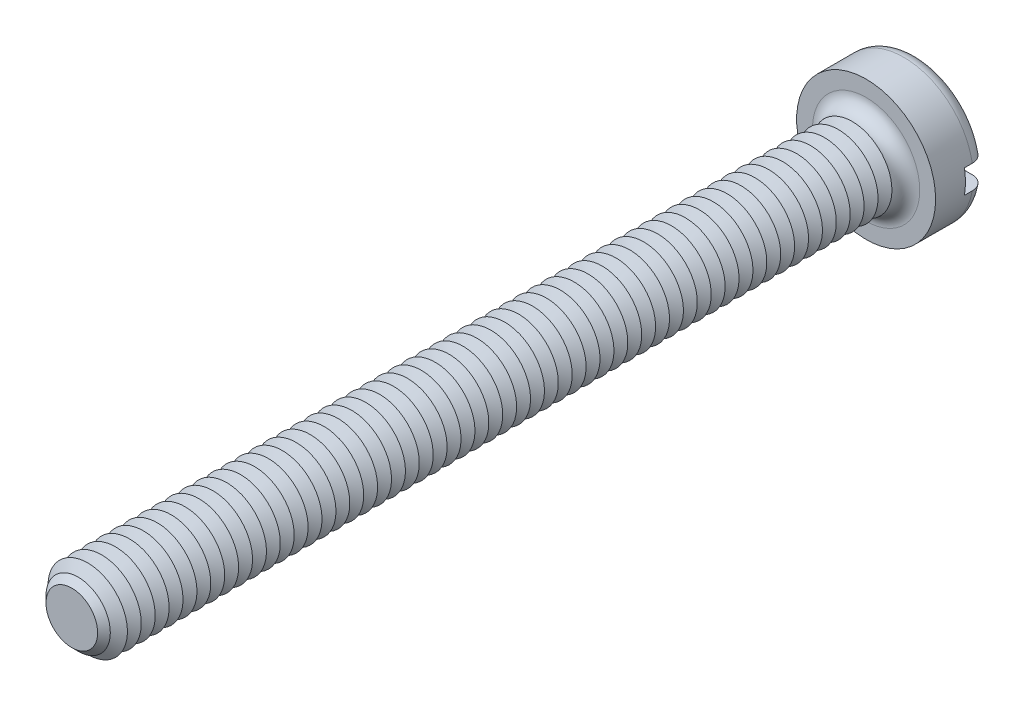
ISO-10303-21;
HEADER;
FILE_DESCRIPTION(('STEP AP214'),'2;1');
FILE_NAME('part.step','',(''),(''),'','','');
FILE_SCHEMA(('AUTOMOTIVE_DESIGN { 1 0 10303 214 1 1 1 1 }'));
ENDSEC;
DATA;
#1=APPLICATION_CONTEXT('core data for automotive mechanical design processes');
#2=APPLICATION_PROTOCOL_DEFINITION('international standard','automotive_design',2000,#1);
#3=PRODUCT_CONTEXT('',#1,'mechanical');
#4=PRODUCT('Part','Part','',(#3));
#5=PRODUCT_RELATED_PRODUCT_CATEGORY('part','',(#4));
#6=PRODUCT_DEFINITION_FORMATION('','',#4);
#7=PRODUCT_DEFINITION_CONTEXT('part definition',#1,'design');
#8=PRODUCT_DEFINITION('design','',#6,#7);
#9=PRODUCT_DEFINITION_SHAPE('','',#8);
#10=(LENGTH_UNIT() NAMED_UNIT(*) SI_UNIT(.MILLI.,.METRE.));
#11=(NAMED_UNIT(*) PLANE_ANGLE_UNIT() SI_UNIT($,.RADIAN.));
#12=(NAMED_UNIT(*) SI_UNIT($,.STERADIAN.) SOLID_ANGLE_UNIT());
#13=UNCERTAINTY_MEASURE_WITH_UNIT(LENGTH_MEASURE(1.E-05),#10,'distance_accuracy_value','');
#14=(GEOMETRIC_REPRESENTATION_CONTEXT(3) GLOBAL_UNCERTAINTY_ASSIGNED_CONTEXT((#13)) GLOBAL_UNIT_ASSIGNED_CONTEXT((#10,
#11,#12)) REPRESENTATION_CONTEXT('',''));
#15=CARTESIAN_POINT('',(0.,0.,0.));
#16=DIRECTION('',(0.,0.,1.));
#17=DIRECTION('',(1.,0.,0.));
#18=AXIS2_PLACEMENT_3D('',#15,#16,#17);
#19=CARTESIAN_POINT('',(0.,0.,-2.6));
#20=DIRECTION('',(0.,0.,1.));
#21=DIRECTION('',(1.,0.,0.));
#22=AXIS2_PLACEMENT_3D('',#19,#20,#21);
#23=PLANE('',#22);
#24=CARTESIAN_POINT('',(0.,0.,-2.6));
#25=DIRECTION('',(0.,0.,1.));
#26=DIRECTION('',(1.,0.,0.));
#27=AXIS2_PLACEMENT_3D('',#24,#25,#26);
#28=CIRCLE('',#27,2.8);
#29=CARTESIAN_POINT('',(-2.73495886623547,0.6,-2.6));
#30=VERTEX_POINT('',#29);
#31=CARTESIAN_POINT('',(2.73495886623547,0.6,-2.6));
#32=VERTEX_POINT('',#31);
#33=EDGE_CURVE('E116',#30,#32,#28,.F.);
#34=ORIENTED_EDGE('',*,*,#33,.T.);
#35=DIRECTION('',(1.,0.,0.));
#36=VECTOR('',#35,1.);
#37=CARTESIAN_POINT('',(-3.5,0.600000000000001,-2.6));
#38=LINE('',#37,#36);
#39=EDGE_CURVE('E111',#30,#32,#38,.T.);
#40=ORIENTED_EDGE('',*,*,#39,.F.);
#41=EDGE_LOOP('',(#34,#40));
#42=FACE_BOUND('',#41,.T.);
#43=ADVANCED_FACE('F39',(#42),#23,.F.);
#44=CARTESIAN_POINT('',(0.,0.,-1.9));
#45=DIRECTION('',(0.,0.,1.));
#46=DIRECTION('',(1.,0.,0.));
#47=AXIS2_PLACEMENT_3D('',#44,#45,#46);
#48=TOROIDAL_SURFACE('',#47,2.8,0.7);
#49=CARTESIAN_POINT('',(-3.24550494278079,0.600000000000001,-2.38938679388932));
#50=CARTESIAN_POINT('',(-3.21724139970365,0.600000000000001,-2.41780774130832));
#51=CARTESIAN_POINT('',(-3.18652103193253,0.600000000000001,-2.44383169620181));
#52=CARTESIAN_POINT('',(-3.12110229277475,0.600000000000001,-2.49034599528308));
#53=CARTESIAN_POINT('',(-3.08639834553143,0.6,-2.51082844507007));
#54=CARTESIAN_POINT('',(-3.01410013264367,0.6,-2.54568075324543));
#55=CARTESIAN_POINT('',(-2.97650963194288,0.6,-2.56005841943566));
#56=CARTESIAN_POINT('',(-2.89948250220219,0.6,-2.58239238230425));
#57=CARTESIAN_POINT('',(-2.86004633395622,0.6,-2.59035027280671));
#58=CARTESIAN_POINT('',(-2.77983715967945,0.6,-2.5997577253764));
#59=CARTESIAN_POINT('',(-2.73905311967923,0.6,-2.60111317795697));
#60=CARTESIAN_POINT('',(-2.65781876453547,0.6,-2.59706866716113));
#61=CARTESIAN_POINT('',(-2.61736849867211,0.6,-2.59166772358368));
#62=CARTESIAN_POINT('',(-2.53729983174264,0.6,-2.57414594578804));
#63=CARTESIAN_POINT('',(-2.49770360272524,0.6,-2.56192363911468));
#64=CARTESIAN_POINT('',(-2.421111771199,0.6,-2.5310238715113));
#65=CARTESIAN_POINT('',(-2.38411632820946,0.6,-2.51234601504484));
#66=CARTESIAN_POINT('',(-2.31371213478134,0.6,-2.46896762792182));
#67=CARTESIAN_POINT('',(-2.28031240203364,0.6,-2.44425244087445));
#68=CARTESIAN_POINT('',(-2.21823311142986,0.6,-2.38946667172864));
#69=CARTESIAN_POINT('',(-2.18955321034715,0.6,-2.35939647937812));
#70=CARTESIAN_POINT('',(-2.13836074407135,0.6,-2.29532787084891));
#71=CARTESIAN_POINT('',(-2.11574147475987,0.6,-2.26141482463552));
#72=CARTESIAN_POINT('',(-2.07677080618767,0.6,-2.19015935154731));
#73=CARTESIAN_POINT('',(-2.06041784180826,0.6,-2.15281778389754));
#74=CARTESIAN_POINT('',(-2.03508596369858,0.6,-2.07723332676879));
#75=CARTESIAN_POINT('',(-2.02585871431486,0.6,-2.03907365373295));
#76=CARTESIAN_POINT('',(-2.01416722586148,0.6,-1.96173417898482));
#77=CARTESIAN_POINT('',(-2.01170151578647,0.6,-1.92255460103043));
#78=CARTESIAN_POINT('',(-2.01359934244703,0.6,-1.84555709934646));
#79=CARTESIAN_POINT('',(-2.01775787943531,0.6,-1.80773393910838));
#80=CARTESIAN_POINT('',(-2.03236373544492,0.6,-1.73332511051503));
#81=CARTESIAN_POINT('',(-2.04281097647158,0.6,-1.69673942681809));
#82=CARTESIAN_POINT('',(-2.06962963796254,0.6,-1.62577336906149));
#83=CARTESIAN_POINT('',(-2.08600685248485,0.6,-1.59139519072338));
#84=CARTESIAN_POINT('',(-2.12413495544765,0.6,-1.52576356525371));
#85=CARTESIAN_POINT('',(-2.14588657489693,0.6,-1.49451054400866));
#86=CARTESIAN_POINT('',(-2.19483541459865,0.6,-1.43498643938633));
#87=CARTESIAN_POINT('',(-2.22217844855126,0.6,-1.40683532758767));
#88=CARTESIAN_POINT('',(-2.28105616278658,0.6,-1.35532544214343));
#89=CARTESIAN_POINT('',(-2.3125916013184,0.6,-1.33196753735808));
#90=CARTESIAN_POINT('',(-2.38018779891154,0.6,-1.28984356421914));
#91=CARTESIAN_POINT('',(-2.41637068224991,0.6,-1.27127330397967));
#92=CARTESIAN_POINT('',(-2.49129688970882,0.6,-1.24032971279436));
#93=CARTESIAN_POINT('',(-2.53004053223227,0.6,-1.22795715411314));
#94=CARTESIAN_POINT('',(-2.6098393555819,0.6,-1.2095515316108));
#95=CARTESIAN_POINT('',(-2.65092550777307,0.6,-1.20365237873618));
#96=CARTESIAN_POINT('',(-2.7335069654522,0.6,-1.1988380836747));
#97=CARTESIAN_POINT('',(-2.7750022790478,0.6,-1.19992308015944));
#98=CARTESIAN_POINT('',(-2.85718851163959,0.6,-1.20909046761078));
#99=CARTESIAN_POINT('',(-2.8978799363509,0.6,-1.21716830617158));
#100=CARTESIAN_POINT('',(-2.97729176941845,0.6,-1.24014327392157));
#101=CARTESIAN_POINT('',(-3.01601231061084,0.6,-1.25503994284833));
#102=CARTESIAN_POINT('',(-3.08976822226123,0.6,-1.29101066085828));
#103=CARTESIAN_POINT('',(-3.12484927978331,0.600000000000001,-1.31199098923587));
#104=CARTESIAN_POINT('',(-3.19090022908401,0.600000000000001,-1.35965144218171));
#105=CARTESIAN_POINT('',(-3.22187053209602,0.600000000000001,-1.38633099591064));
#106=CARTESIAN_POINT('',(-3.2781946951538,0.600000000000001,-1.44408564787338));
#107=CARTESIAN_POINT('',(-3.3036441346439,0.600000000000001,-1.47506754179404));
#108=CARTESIAN_POINT('',(-3.34887649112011,0.600000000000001,-1.54092398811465));
#109=CARTESIAN_POINT('',(-3.36865993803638,0.600000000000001,-1.57579817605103));
#110=CARTESIAN_POINT('',(-3.40166738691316,0.600000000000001,-1.64783067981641));
#111=CARTESIAN_POINT('',(-3.41499360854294,0.600000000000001,-1.68494217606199));
#112=CARTESIAN_POINT('',(-3.43515375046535,0.600000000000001,-1.76088675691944));
#113=CARTESIAN_POINT('',(-3.44198836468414,0.600000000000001,-1.79971965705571));
#114=CARTESIAN_POINT('',(-3.44891916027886,0.600000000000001,-1.87757893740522));
#115=CARTESIAN_POINT('',(-3.44908375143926,0.600000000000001,-1.91659924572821));
#116=CARTESIAN_POINT('',(-3.44284111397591,0.600000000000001,-1.99412088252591));
#117=CARTESIAN_POINT('',(-3.43643236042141,0.600000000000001,-2.03262208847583));
#118=CARTESIAN_POINT('',(-3.41725803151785,0.600000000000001,-2.10792315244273));
#119=CARTESIAN_POINT('',(-3.40450469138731,0.600000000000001,-2.14472613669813));
#120=CARTESIAN_POINT('',(-3.3730385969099,0.600000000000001,-2.21565060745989));
#121=CARTESIAN_POINT('',(-3.35433321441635,0.600000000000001,-2.24977534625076));
#122=CARTESIAN_POINT('',(-3.3201892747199,0.600000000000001,-2.30136364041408));
#123=CARTESIAN_POINT('',(-3.30647805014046,0.600000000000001,-2.31999402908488));
#124=CARTESIAN_POINT('',(-3.27728518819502,0.600000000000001,-2.35581090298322));
#125=CARTESIAN_POINT('',(-3.26180356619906,0.600000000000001,-2.37299740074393));
#126=CARTESIAN_POINT('',(-3.24550494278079,0.600000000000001,-2.38938679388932));
#127=B_SPLINE_CURVE_WITH_KNOTS('',3,(#49,#50,#51,#52,#53,#54,#55,#56,#57,#58,#59,#60,#61,#62,
#63,#64,#65,#66,#67,#68,#69,#70,#71,#72,#73,#74,#75,#76,#77,#78,#79,#80,#81,#82,#83,#84,#85,#86,
#87,#88,#89,#90,#91,#92,#93,#94,#95,#96,#97,#98,#99,#100,#101,#102,#103,#104,#105,#106,#107,
#108,#109,#110,#111,#112,#113,#114,#115,#116,#117,#118,#119,#120,#121,#122,#123,#124,#125,#126),
.UNSPECIFIED.,.T.,.F.,(4,2,2,2,2,2,2,2,2,2,2,2,2,2,2,2,2,2,2,2,2,2,2,2,2,2,2,2,2,2,2,2,2,2,2,2,
2,2,4),(0.,0.120160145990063,0.240490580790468,0.36066665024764,0.480812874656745,
0.602666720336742,0.724538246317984,0.848272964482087,0.972015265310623,1.09606100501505,
1.2200977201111,1.34178071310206,1.46343329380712,1.58062647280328,1.6977941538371,
1.81140573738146,1.92501591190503,2.03873739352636,2.15247435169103,2.26967910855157,
2.38690509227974,2.50835551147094,2.62982106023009,2.75375450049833,2.87769040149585,
3.00154567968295,3.12539259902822,3.24742469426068,3.36944457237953,3.48914477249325,
3.60883377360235,3.72656056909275,3.84427477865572,3.96078136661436,4.07731498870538,
4.19362474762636,4.3097910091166,4.37908387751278,4.44837614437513),.UNSPECIFIED.);
#128=CARTESIAN_POINT('',(-3.44818792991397,0.600000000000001,-1.8999999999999));
#129=VERTEX_POINT('',#128);
#130=EDGE_CURVE('E632',#129,#30,#127,.T.);
#131=ORIENTED_EDGE('',*,*,#130,.F.);
#132=CARTESIAN_POINT('',(0.,0.,-1.9));
#133=DIRECTION('',(0.,0.,1.));
#134=DIRECTION('',(1.,0.,0.));
#135=AXIS2_PLACEMENT_3D('',#132,#133,#134);
#136=CIRCLE('',#135,3.5);
#137=CARTESIAN_POINT('',(3.44818792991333,0.6,-1.9));
#138=VERTEX_POINT('',#137);
#139=EDGE_CURVE('E124',#138,#129,#136,.T.);
#140=ORIENTED_EDGE('',*,*,#139,.F.);
#141=CARTESIAN_POINT('',(2.1414268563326,0.6,-2.29762171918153));
#142=CARTESIAN_POINT('',(2.16505443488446,0.6,-2.33058245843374));
#143=CARTESIAN_POINT('',(2.19155609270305,0.6,-2.36152717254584));
#144=CARTESIAN_POINT('',(2.24942944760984,0.6,-2.41852964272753));
#145=CARTESIAN_POINT('',(2.28080921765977,0.6,-2.44457913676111));
#146=CARTESIAN_POINT('',(2.34741203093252,0.6,-2.49105381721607));
#147=CARTESIAN_POINT('',(2.38262862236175,0.6,-2.51148824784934));
#148=CARTESIAN_POINT('',(2.45593176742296,0.6,-2.54626881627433));
#149=CARTESIAN_POINT('',(2.49401741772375,0.6,-2.56061686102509));
#150=CARTESIAN_POINT('',(2.57272605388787,0.6,-2.58306429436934));
#151=CARTESIAN_POINT('',(2.6133821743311,0.6,-2.59104769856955));
#152=CARTESIAN_POINT('',(2.6954618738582,0.6,-2.60009608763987));
#153=CARTESIAN_POINT('',(2.73688552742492,0.6,-2.60116039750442));
#154=CARTESIAN_POINT('',(2.81941950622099,0.6,-2.5962925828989));
#155=CARTESIAN_POINT('',(2.86052888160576,0.6,-2.59034422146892));
#156=CARTESIAN_POINT('',(2.94113709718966,0.6,-2.57153687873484));
#157=CARTESIAN_POINT('',(2.98063603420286,0.6,-2.55867831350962));
#158=CARTESIAN_POINT('',(3.05633735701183,0.6,-2.52657771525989));
#159=CARTESIAN_POINT('',(3.09257627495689,0.6,-2.50742188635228));
#160=CARTESIAN_POINT('',(3.16123898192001,0.6,-2.46318606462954));
#161=CARTESIAN_POINT('',(3.19366316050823,0.6,-2.4381066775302));
#162=CARTESIAN_POINT('',(3.25312278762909,0.6,-2.38324481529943));
#163=CARTESIAN_POINT('',(3.28024842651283,0.6,-2.35356008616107));
#164=CARTESIAN_POINT('',(3.32902587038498,0.6,-2.28998971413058));
#165=CARTESIAN_POINT('',(3.35067820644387,0.6,-2.25610447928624));
#166=CARTESIAN_POINT('',(3.38751207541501,0.6,-2.18572286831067));
#167=CARTESIAN_POINT('',(3.40279804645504,0.6,-2.14928112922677));
#168=CARTESIAN_POINT('',(3.42695590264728,0.6,-2.07433042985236));
#169=CARTESIAN_POINT('',(3.43582824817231,0.6,-2.03582161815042));
#170=CARTESIAN_POINT('',(3.44682113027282,0.6,-1.95829536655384));
#171=CARTESIAN_POINT('',(3.44901648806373,0.6,-1.91928851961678));
#172=CARTESIAN_POINT('',(3.44680085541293,0.6,-1.84146366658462));
#173=CARTESIAN_POINT('',(3.44239008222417,0.6,-1.80264565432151));
#174=CARTESIAN_POINT('',(3.42712544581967,0.6,-1.72644634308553));
#175=CARTESIAN_POINT('',(3.41629508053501,0.6,-1.6890603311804));
#176=CARTESIAN_POINT('',(3.38853757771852,0.6,-1.61662604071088));
#177=CARTESIAN_POINT('',(3.37161039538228,0.6,-1.58157777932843));
#178=CARTESIAN_POINT('',(3.33207798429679,0.6,-1.51464178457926));
#179=CARTESIAN_POINT('',(3.30944854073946,0.6,-1.48276835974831));
#180=CARTESIAN_POINT('',(3.2592165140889,0.6,-1.42321861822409));
#181=CARTESIAN_POINT('',(3.23161370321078,0.6,-1.3955424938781));
#182=CARTESIAN_POINT('',(3.17188519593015,0.6,-1.34481834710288));
#183=CARTESIAN_POINT('',(3.13971065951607,0.6,-1.32182785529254));
#184=CARTESIAN_POINT('',(3.07201123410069,0.6,-1.28147003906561));
#185=CARTESIAN_POINT('',(3.03648608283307,0.6,-1.26410315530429));
#186=CARTESIAN_POINT('',(2.962449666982,0.6,-1.2351645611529));
#187=CARTESIAN_POINT('',(2.92389781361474,0.6,-1.22369671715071));
#188=CARTESIAN_POINT('',(2.84543273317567,0.6,-1.20726565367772));
#189=CARTESIAN_POINT('',(2.80551936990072,0.6,-1.20230308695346));
#190=CARTESIAN_POINT('',(2.72467191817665,0.6,-1.1989357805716));
#191=CARTESIAN_POINT('',(2.68373266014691,0.6,-1.20065484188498));
#192=CARTESIAN_POINT('',(2.60270222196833,0.6,-1.21084560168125));
#193=CARTESIAN_POINT('',(2.56261112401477,0.6,-1.21931795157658));
#194=CARTESIAN_POINT('',(2.48385954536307,0.6,-1.24292934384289));
#195=CARTESIAN_POINT('',(2.44522508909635,0.6,-1.25815531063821));
#196=CARTESIAN_POINT('',(2.37106165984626,0.6,-1.29488663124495));
#197=CARTESIAN_POINT('',(2.33553282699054,0.6,-1.31639226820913));
#198=CARTESIAN_POINT('',(2.2686996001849,0.6,-1.36507949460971));
#199=CARTESIAN_POINT('',(2.23738745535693,0.6,-1.39225042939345));
#200=CARTESIAN_POINT('',(2.17990424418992,0.6,-1.45157941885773));
#201=CARTESIAN_POINT('',(2.15373259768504,0.6,-1.48373691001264));
#202=CARTESIAN_POINT('',(2.10799355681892,0.6,-1.551327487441));
#203=CARTESIAN_POINT('',(2.08828258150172,0.6,-1.58666329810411));
#204=CARTESIAN_POINT('',(2.05534440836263,0.6,-1.66023600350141));
#205=CARTESIAN_POINT('',(2.042115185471,0.6,-1.6984719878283));
#206=CARTESIAN_POINT('',(2.02303126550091,0.6,-1.77519783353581));
#207=CARTESIAN_POINT('',(2.01691541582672,0.6,-1.8136228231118));
#208=CARTESIAN_POINT('',(2.01140375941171,0.6,-1.89096056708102));
#209=CARTESIAN_POINT('',(2.01200856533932,0.6,-1.92987336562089));
#210=CARTESIAN_POINT('',(2.01981617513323,0.6,-2.006065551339));
#211=CARTESIAN_POINT('',(2.02685835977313,0.6,-2.04336165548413));
#212=CARTESIAN_POINT('',(2.0470502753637,0.6,-2.1162250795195));
#213=CARTESIAN_POINT('',(2.06019252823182,0.6,-2.15179445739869));
#214=CARTESIAN_POINT('',(2.08525738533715,0.6,-2.20558874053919));
#215=CARTESIAN_POINT('',(2.09529161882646,0.6,-2.22471751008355));
#216=CARTESIAN_POINT('',(2.11708813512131,0.6,-2.26196179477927));
#217=CARTESIAN_POINT('',(2.12885034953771,0.6,-2.28007734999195));
#218=CARTESIAN_POINT('',(2.1414268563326,0.6,-2.29762171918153));
#219=B_SPLINE_CURVE_WITH_KNOTS('',3,(#141,#142,#143,#144,#145,#146,#147,#148,#149,#150,#151,
#152,#153,#154,#155,#156,#157,#158,#159,#160,#161,#162,#163,#164,#165,#166,#167,#168,#169,#170,
#171,#172,#173,#174,#175,#176,#177,#178,#179,#180,#181,#182,#183,#184,#185,#186,#187,#188,#189,
#190,#191,#192,#193,#194,#195,#196,#197,#198,#199,#200,#201,#202,#203,#204,#205,#206,#207,#208,
#209,#210,#211,#212,#213,#214,#215,#216,#217,#218),.UNSPECIFIED.,.T.,.F.,(4,2,2,2,2,2,2,2,2,2,2,
2,2,2,2,2,2,2,2,2,2,2,2,2,2,2,2,2,2,2,2,2,2,2,2,2,2,2,4),(0.,0.121582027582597,
0.243367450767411,0.364951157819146,0.486496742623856,0.610209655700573,0.733934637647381,
0.857946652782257,0.981951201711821,1.1043243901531,1.22668507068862,1.34673532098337,
1.46677391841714,1.58475736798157,1.70273234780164,1.81938035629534,1.93602452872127,
2.05224435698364,2.168465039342,2.28518782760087,2.40191596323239,2.52000081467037,
2.63809491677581,2.75820270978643,2.87832255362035,3.00067856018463,3.1230463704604,
3.24703703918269,3.37103329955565,3.49479843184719,3.6185495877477,3.73932715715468,
3.86006696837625,3.9762182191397,4.09238005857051,4.2057203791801,4.31892212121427,
4.38364046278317,4.44835624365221),.UNSPECIFIED.);
#220=EDGE_CURVE('E634',#32,#138,#219,.T.);
#221=ORIENTED_EDGE('',*,*,#220,.F.);
#222=ORIENTED_EDGE('',*,*,#33,.F.);
#223=EDGE_LOOP('',(#131,#140,#221,#222));
#224=FACE_BOUND('',#223,.T.);
#225=ADVANCED_FACE('F616',(#224),#48,.T.);
#226=CARTESIAN_POINT('',(0.,0.,-2.6));
#227=DIRECTION('',(0.,0.,1.));
#228=DIRECTION('',(1.,0.,0.));
#229=AXIS2_PLACEMENT_3D('',#226,#227,#228);
#230=CYLINDRICAL_SURFACE('',#229,3.5);
#231=DIRECTION('',(0.,0.,1.));
#232=VECTOR('',#231,1.);
#233=CARTESIAN_POINT('',(3.44818792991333,0.6,-2.6));
#234=LINE('',#233,#232);
#235=CARTESIAN_POINT('',(3.44818792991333,0.6,-1.5));
#236=VERTEX_POINT('',#235);
#237=EDGE_CURVE('E646',#138,#236,#234,.T.);
#238=ORIENTED_EDGE('',*,*,#237,.F.);
#239=ORIENTED_EDGE('',*,*,#139,.T.);
#240=DIRECTION('',(0.,0.,1.));
#241=VECTOR('',#240,1.);
#242=CARTESIAN_POINT('',(-3.44818792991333,0.600000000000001,-2.6));
#243=LINE('',#242,#241);
#244=CARTESIAN_POINT('',(-3.44818792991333,0.600000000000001,-1.5));
#245=VERTEX_POINT('',#244);
#246=EDGE_CURVE('E63',#245,#129,#243,.F.);
#247=ORIENTED_EDGE('',*,*,#246,.F.);
#248=CARTESIAN_POINT('',(0.,0.,-1.5));
#249=DIRECTION('',(0.,0.,-1.));
#250=DIRECTION('',(-1.,0.,0.));
#251=AXIS2_PLACEMENT_3D('',#248,#249,#250);
#252=CIRCLE('',#251,3.5);
#253=CARTESIAN_POINT('',(-3.44818792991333,-0.599999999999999,-1.5));
#254=VERTEX_POINT('',#253);
#255=EDGE_CURVE('E43',#245,#254,#252,.F.);
#256=ORIENTED_EDGE('',*,*,#255,.T.);
#257=DIRECTION('',(0.,0.,1.));
#258=VECTOR('',#257,1.);
#259=CARTESIAN_POINT('',(-3.44818792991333,-0.599999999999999,-2.6));
#260=LINE('',#259,#258);
#261=CARTESIAN_POINT('',(-3.44818792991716,-0.599999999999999,-1.90000000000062));
#262=VERTEX_POINT('',#261);
#263=EDGE_CURVE('E644',#262,#254,#260,.T.);
#264=ORIENTED_EDGE('',*,*,#263,.F.);
#265=CARTESIAN_POINT('',(3.44818792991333,-0.6,-1.9));
#266=VERTEX_POINT('',#265);
#267=EDGE_CURVE('E126',#262,#266,#136,.T.);
#268=ORIENTED_EDGE('',*,*,#267,.T.);
#269=DIRECTION('',(0.,0.,1.));
#270=VECTOR('',#269,1.);
#271=CARTESIAN_POINT('',(3.44818792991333,-0.6,-2.6));
#272=LINE('',#271,#270);
#273=CARTESIAN_POINT('',(3.44818792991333,-0.6,-1.5));
#274=VERTEX_POINT('',#273);
#275=EDGE_CURVE('E55',#274,#266,#272,.F.);
#276=ORIENTED_EDGE('',*,*,#275,.F.);
#277=EDGE_CURVE('E11',#274,#236,#252,.F.);
#278=ORIENTED_EDGE('',*,*,#277,.T.);
#279=EDGE_LOOP('',(#238,#239,#247,#256,#264,#268,#276,#278));
#280=FACE_BOUND('',#279,.T.);
#281=CARTESIAN_POINT('',(0.,0.,0.));
#282=DIRECTION('',(0.,0.,1.));
#283=DIRECTION('',(1.,0.,0.));
#284=AXIS2_PLACEMENT_3D('',#281,#282,#283);
#285=CIRCLE('',#284,3.5);
#286=CARTESIAN_POINT('',(3.5,0.,0.));
#287=VERTEX_POINT('',#286);
#288=EDGE_CURVE('E649',#287,#287,#285,.T.);
#289=ORIENTED_EDGE('',*,*,#288,.F.);
#290=EDGE_LOOP('',(#289));
#291=FACE_BOUND('',#290,.T.);
#292=ADVANCED_FACE('F612',(#280,#291),#230,.T.);
#293=CARTESIAN_POINT('',(2.73495886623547,-0.6,-2.6));
#294=VERTEX_POINT('',#293);
#295=CARTESIAN_POINT('',(-2.73495886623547,-0.6,-2.6));
#296=VERTEX_POINT('',#295);
#297=EDGE_CURVE('E109',#294,#296,#28,.F.);
#298=ORIENTED_EDGE('',*,*,#297,.T.);
#299=DIRECTION('',(-1.,0.,0.));
#300=VECTOR('',#299,1.);
#301=CARTESIAN_POINT('',(-3.5,-0.599999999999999,-2.6));
#302=LINE('',#301,#300);
#303=EDGE_CURVE('E96',#294,#296,#302,.T.);
#304=ORIENTED_EDGE('',*,*,#303,.F.);
#305=EDGE_LOOP('',(#298,#304));
#306=FACE_BOUND('',#305,.T.);
#307=ADVANCED_FACE('F108',(#306),#23,.F.);
#308=CARTESIAN_POINT('',(0.,0.,0.));
#309=DIRECTION('',(0.,0.,1.));
#310=DIRECTION('',(1.,0.,0.));
#311=AXIS2_PLACEMENT_3D('',#308,#309,#310);
#312=PLANE('',#311);
#313=CARTESIAN_POINT('',(0.,0.,0.));
#314=DIRECTION('',(0.,0.,1.));
#315=DIRECTION('',(1.,0.,0.));
#316=AXIS2_PLACEMENT_3D('',#313,#314,#315);
#317=CIRCLE('',#316,2.7);
#318=CARTESIAN_POINT('',(2.7,0.,0.));
#319=VERTEX_POINT('',#318);
#320=EDGE_CURVE('E115',#319,#319,#317,.F.);
#321=ORIENTED_EDGE('',*,*,#320,.T.);
#322=EDGE_LOOP('',(#321));
#323=FACE_BOUND('',#322,.T.);
#324=ORIENTED_EDGE('',*,*,#288,.T.);
#325=EDGE_LOOP('',(#324));
#326=FACE_BOUND('',#325,.T.);
#327=ADVANCED_FACE('F611',(#323,#326),#312,.T.);
#328=CARTESIAN_POINT('',(-3.24550494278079,-0.599999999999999,-2.38938679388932));
#329=CARTESIAN_POINT('',(-3.27309693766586,-0.599999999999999,-2.36163611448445));
#330=CARTESIAN_POINT('',(-3.29838741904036,-0.599999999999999,-2.3315608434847));
#331=CARTESIAN_POINT('',(-3.34359429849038,-0.599999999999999,-2.26757659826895));
#332=CARTESIAN_POINT('',(-3.36350518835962,-0.599999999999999,-2.23366374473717));
#333=CARTESIAN_POINT('',(-3.39733065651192,-0.599999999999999,-2.16296274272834));
#334=CARTESIAN_POINT('',(-3.4112451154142,-0.599999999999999,-2.12617453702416));
#335=CARTESIAN_POINT('',(-3.43264462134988,-0.599999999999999,-2.05078178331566));
#336=CARTESIAN_POINT('',(-3.44013114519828,-0.599999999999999,-2.01217765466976));
#337=CARTESIAN_POINT('',(-3.44841975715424,-0.599999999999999,-1.9345391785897));
#338=CARTESIAN_POINT('',(-3.44926944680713,-0.599999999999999,-1.89550990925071));
#339=CARTESIAN_POINT('',(-3.44438358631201,-0.599999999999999,-1.81786552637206));
#340=CARTESIAN_POINT('',(-3.43864801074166,-0.599999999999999,-1.77925041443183));
#341=CARTESIAN_POINT('',(-3.42079221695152,-0.599999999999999,-1.70364264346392));
#342=CARTESIAN_POINT('',(-3.40869011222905,-0.599999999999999,-1.66664570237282));
#343=CARTESIAN_POINT('',(-3.37847692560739,-0.599999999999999,-1.59519424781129));
#344=CARTESIAN_POINT('',(-3.3603657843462,-0.599999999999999,-1.56073975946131));
#345=CARTESIAN_POINT('',(-3.31856549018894,-0.599999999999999,-1.4951524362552));
#346=CARTESIAN_POINT('',(-3.29484830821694,-0.599999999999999,-1.46403747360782));
#347=CARTESIAN_POINT('',(-3.24258489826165,-0.599999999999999,-1.40617131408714));
#348=CARTESIAN_POINT('',(-3.21403843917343,-0.599999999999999,-1.37942032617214));
#349=CARTESIAN_POINT('',(-3.15256084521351,-0.599999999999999,-1.33067963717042));
#350=CARTESIAN_POINT('',(-3.11958015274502,-0.599999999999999,-1.30875246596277));
#351=CARTESIAN_POINT('',(-3.0504559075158,-0.599999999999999,-1.27063718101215));
#352=CARTESIAN_POINT('',(-3.01431209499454,-0.6,-1.25444953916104));
#353=CARTESIAN_POINT('',(-2.93921710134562,-0.6,-1.22796796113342));
#354=CARTESIAN_POINT('',(-2.90022796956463,-0.6,-1.217781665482));
#355=CARTESIAN_POINT('',(-2.82110512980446,-0.6,-1.20396915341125));
#356=CARTESIAN_POINT('',(-2.7809713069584,-0.6,-1.2003435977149));
#357=CARTESIAN_POINT('',(-2.69990924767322,-0.6,-1.19969717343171));
#358=CARTESIAN_POINT('',(-2.65898001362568,-0.6,-1.20279937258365));
#359=CARTESIAN_POINT('',(-2.57819986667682,-0.6,-1.21574287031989));
#360=CARTESIAN_POINT('',(-2.53834905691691,-0.6,-1.22558481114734));
#361=CARTESIAN_POINT('',(-2.46035232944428,-0.6,-1.25189361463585));
#362=CARTESIAN_POINT('',(-2.42223314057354,-0.6,-1.2684398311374));
#363=CARTESIAN_POINT('',(-2.34932316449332,-0.6,-1.30771928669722));
#364=CARTESIAN_POINT('',(-2.31453248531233,-0.6,-1.33045272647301));
#365=CARTESIAN_POINT('',(-2.24945577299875,-0.6,-1.38141543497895));
#366=CARTESIAN_POINT('',(-2.21915255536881,-0.6,-1.40962272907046));
#367=CARTESIAN_POINT('',(-2.16386461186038,-0.6,-1.47084552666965));
#368=CARTESIAN_POINT('',(-2.13887916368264,-0.6,-1.50386037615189));
#369=CARTESIAN_POINT('',(-2.09568071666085,-0.6,-1.57285917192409));
#370=CARTESIAN_POINT('',(-2.07730739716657,-0.6,-1.60874263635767));
#371=CARTESIAN_POINT('',(-2.04712019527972,-0.6,-1.68316975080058));
#372=CARTESIAN_POINT('',(-2.03530452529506,-0.6,-1.72171267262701));
#373=CARTESIAN_POINT('',(-2.01901751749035,-0.6,-1.79878952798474));
#374=CARTESIAN_POINT('',(-2.01428434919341,-0.6,-1.8372682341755));
#375=CARTESIAN_POINT('',(-2.01150652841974,-0.6,-1.91446369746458));
#376=CARTESIAN_POINT('',(-2.01346084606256,-0.6,-1.95318041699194));
#377=CARTESIAN_POINT('',(-2.02386268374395,-0.6,-2.0288619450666));
#378=CARTESIAN_POINT('',(-2.03216724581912,-0.6,-2.06584654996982));
#379=CARTESIAN_POINT('',(-2.05479337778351,-0.6,-2.13792373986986));
#380=CARTESIAN_POINT('',(-2.06911522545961,-0.6,-2.1730162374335));
#381=CARTESIAN_POINT('',(-2.10349906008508,-0.6,-2.24081034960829));
#382=CARTESIAN_POINT('',(-2.12363007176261,-0.6,-2.27347689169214));
#383=CARTESIAN_POINT('',(-2.16891308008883,-0.6,-2.33511902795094));
#384=CARTESIAN_POINT('',(-2.19406590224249,-0.6,-2.36409401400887));
#385=CARTESIAN_POINT('',(-2.24962389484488,-0.6,-2.41861972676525));
#386=CARTESIAN_POINT('',(-2.28018314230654,-0.6,-2.44401345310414));
#387=CARTESIAN_POINT('',(-2.34501720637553,-0.6,-2.48950558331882));
#388=CARTESIAN_POINT('',(-2.37929266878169,-0.6,-2.50960306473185));
#389=CARTESIAN_POINT('',(-2.45179417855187,-0.6,-2.54458276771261));
#390=CARTESIAN_POINT('',(-2.49011248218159,-0.6,-2.55927401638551));
#391=CARTESIAN_POINT('',(-2.56865227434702,-0.6,-2.58211133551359));
#392=CARTESIAN_POINT('',(-2.60887386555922,-0.6,-2.59025705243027));
#393=CARTESIAN_POINT('',(-2.69064746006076,-0.6,-2.59982905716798));
#394=CARTESIAN_POINT('',(-2.73220999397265,-0.6,-2.60116580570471));
#395=CARTESIAN_POINT('',(-2.81497658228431,-0.6,-2.59679700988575));
#396=CARTESIAN_POINT('',(-2.85618055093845,-0.6,-2.59108982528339));
#397=CARTESIAN_POINT('',(-2.93677683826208,-0.6,-2.57279487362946));
#398=CARTESIAN_POINT('',(-2.97617834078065,-0.6,-2.56024753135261));
#399=CARTESIAN_POINT('',(-3.05222242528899,-0.6,-2.52860709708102));
#400=CARTESIAN_POINT('',(-3.08886850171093,-0.599999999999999,-2.50952247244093));
#401=CARTESIAN_POINT('',(-3.14562501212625,-0.599999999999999,-2.47340693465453));
#402=CARTESIAN_POINT('',(-3.16689358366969,-0.599999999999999,-2.45816337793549));
#403=CARTESIAN_POINT('',(-3.20761866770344,-0.599999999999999,-2.42542115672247));
#404=CARTESIAN_POINT('',(-3.22707520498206,-0.599999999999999,-2.40792252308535));
#405=CARTESIAN_POINT('',(-3.24550494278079,-0.599999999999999,-2.38938679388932));
#406=B_SPLINE_CURVE_WITH_KNOTS('',3,(#328,#329,#330,#331,#332,#333,#334,#335,#336,#337,#338,
#339,#340,#341,#342,#343,#344,#345,#346,#347,#348,#349,#350,#351,#352,#353,#354,#355,#356,#357,
#358,#359,#360,#361,#362,#363,#364,#365,#366,#367,#368,#369,#370,#371,#372,#373,#374,#375,#376,
#377,#378,#379,#380,#381,#382,#383,#384,#385,#386,#387,#388,#389,#390,#391,#392,#393,#394,#395,
#396,#397,#398,#399,#400,#401,#402,#403,#404,#405),.UNSPECIFIED.,.T.,.F.,(4,2,2,2,2,2,2,2,2,2,2,
2,2,2,2,2,2,2,2,2,2,2,2,2,2,2,2,2,2,2,2,2,2,2,2,2,2,2,4),(0.,0.117306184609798,
0.234732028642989,0.352160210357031,0.469561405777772,0.586119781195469,0.702678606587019,
0.818907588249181,0.935137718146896,1.05196174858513,1.1687913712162,1.2870562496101,
1.40533084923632,1.52566688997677,1.64601504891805,1.76858322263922,1.89116307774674,
2.01523830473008,2.13931755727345,2.26290863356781,2.38648291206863,2.50681878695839,
2.62712184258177,2.74285697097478,2.85857427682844,2.97176054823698,3.08495204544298,
3.19954814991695,3.31416310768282,3.43282436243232,3.55150627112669,3.67404987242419,
3.79660009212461,3.92075778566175,4.04494439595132,4.16840490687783,4.29170610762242,
4.3700604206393,4.44841366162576),.UNSPECIFIED.);
#407=EDGE_CURVE('E103',#296,#262,#406,.T.);
#408=ORIENTED_EDGE('',*,*,#407,.F.);
#409=ORIENTED_EDGE('',*,*,#297,.F.);
#410=CARTESIAN_POINT('',(2.1414268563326,-0.6,-2.29762171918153));
#411=CARTESIAN_POINT('',(2.11900044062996,-0.6,-2.26633119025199));
#412=CARTESIAN_POINT('',(2.09913154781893,-0.6,-2.23318080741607));
#413=CARTESIAN_POINT('',(2.06517900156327,-0.6,-2.16401111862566));
#414=CARTESIAN_POINT('',(2.05109968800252,-0.6,-2.12798968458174));
#415=CARTESIAN_POINT('',(2.02923593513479,-0.6,-2.05404277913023));
#416=CARTESIAN_POINT('',(2.02145692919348,-0.6,-2.01611569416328));
#417=CARTESIAN_POINT('',(2.01251710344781,-0.6,-1.93949649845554));
#418=CARTESIAN_POINT('',(2.01135461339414,-0.6,-1.90080458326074));
#419=CARTESIAN_POINT('',(2.01564803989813,-0.6,-1.82450508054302));
#420=CARTESIAN_POINT('',(2.02098305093,-0.6,-1.78689061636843));
#421=CARTESIAN_POINT('',(2.03786826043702,-0.6,-1.71308589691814));
#422=CARTESIAN_POINT('',(2.04941870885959,-0.6,-1.67689569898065));
#423=CARTESIAN_POINT('',(2.07838664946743,-0.6,-1.60676639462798));
#424=CARTESIAN_POINT('',(2.09582944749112,-0.6,-1.57283776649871));
#425=CARTESIAN_POINT('',(2.1359925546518,-0.6,-1.50826612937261));
#426=CARTESIAN_POINT('',(2.15871360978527,-0.6,-1.47762358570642));
#427=CARTESIAN_POINT('',(2.20955413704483,-0.6,-1.41943384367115));
#428=CARTESIAN_POINT('',(2.23782364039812,-0.6,-1.39201777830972));
#429=CARTESIAN_POINT('',(2.29842612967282,-0.6,-1.34212199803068));
#430=CARTESIAN_POINT('',(2.33075984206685,-0.6,-1.31964316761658));
#431=CARTESIAN_POINT('',(2.399806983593,-0.6,-1.27945238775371));
#432=CARTESIAN_POINT('',(2.43663466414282,-0.6,-1.26193653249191));
#433=CARTESIAN_POINT('',(2.51267241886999,-0.6,-1.23320660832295));
#434=CARTESIAN_POINT('',(2.55188277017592,-0.6,-1.22199327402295));
#435=CARTESIAN_POINT('',(2.63235000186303,-0.6,-1.20602688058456));
#436=CARTESIAN_POINT('',(2.673631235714,-0.6,-1.20139617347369));
#437=CARTESIAN_POINT('',(2.7563863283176,-0.6,-1.19914622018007));
#438=CARTESIAN_POINT('',(2.79786018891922,-0.6,-1.20152704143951));
#439=CARTESIAN_POINT('',(2.87971192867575,-0.6,-1.21326884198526));
#440=CARTESIAN_POINT('',(2.92009214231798,-0.6,-1.22261349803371));
#441=CARTESIAN_POINT('',(2.99866777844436,-0.6,-1.24805614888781));
#442=CARTESIAN_POINT('',(3.03686335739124,-0.6,-1.26415365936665));
#443=CARTESIAN_POINT('',(3.10934738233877,-0.6,-1.3023912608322));
#444=CARTESIAN_POINT('',(3.14368704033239,-0.6,-1.32443423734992));
#445=CARTESIAN_POINT('',(3.20808395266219,-0.6,-1.37407725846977));
#446=CARTESIAN_POINT('',(3.23814164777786,-0.6,-1.40167673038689));
#447=CARTESIAN_POINT('',(3.29251534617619,-0.6,-1.46108303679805));
#448=CARTESIAN_POINT('',(3.3169296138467,-0.6,-1.49279994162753));
#449=CARTESIAN_POINT('',(3.35998418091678,-0.6,-1.55993706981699));
#450=CARTESIAN_POINT('',(3.37862502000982,-0.6,-1.59535694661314));
#451=CARTESIAN_POINT('',(3.40930212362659,-0.6,-1.668283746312));
#452=CARTESIAN_POINT('',(3.42143897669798,-0.6,-1.70574837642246));
#453=CARTESIAN_POINT('',(3.43918305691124,-0.6,-1.78219297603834));
#454=CARTESIAN_POINT('',(3.44479069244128,-0.6,-1.82117285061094));
#455=CARTESIAN_POINT('',(3.44928173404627,-0.6,-1.89914596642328));
#456=CARTESIAN_POINT('',(3.44822835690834,-0.6,-1.93813558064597));
#457=CARTESIAN_POINT('',(3.43957811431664,-0.6,-2.0153811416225));
#458=CARTESIAN_POINT('',(3.43198139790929,-0.6,-2.05363710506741));
#459=CARTESIAN_POINT('',(3.41049386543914,-0.6,-2.12826741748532));
#460=CARTESIAN_POINT('',(3.39661362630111,-0.6,-2.16464481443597));
#461=CARTESIAN_POINT('',(3.36297924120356,-0.6,-2.23457274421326));
#462=CARTESIAN_POINT('',(3.34322499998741,-0.6,-2.26812323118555));
#463=CARTESIAN_POINT('',(3.29828706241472,-0.6,-2.33167864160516));
#464=CARTESIAN_POINT('',(3.27307040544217,-0.6,-2.36166024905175));
#465=CARTESIAN_POINT('',(3.21802069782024,-0.6,-2.41703165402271));
#466=CARTESIAN_POINT('',(3.18818738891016,-0.6,-2.44242119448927));
#467=CARTESIAN_POINT('',(3.12433871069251,-0.6,-2.48825551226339));
#468=CARTESIAN_POINT('',(3.09027338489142,-0.6,-2.50863067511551));
#469=CARTESIAN_POINT('',(3.01925175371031,-0.6,-2.54348754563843));
#470=CARTESIAN_POINT('',(2.982295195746,-0.6,-2.55796873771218));
#471=CARTESIAN_POINT('',(2.90583499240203,-0.6,-2.58090526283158));
#472=CARTESIAN_POINT('',(2.86629758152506,-0.6,-2.58924801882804));
#473=CARTESIAN_POINT('',(2.78639041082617,-0.6,-2.59930573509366));
#474=CARTESIAN_POINT('',(2.7460205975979,-0.6,-2.60102026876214));
#475=CARTESIAN_POINT('',(2.66482039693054,-0.6,-2.59779078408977));
#476=CARTESIAN_POINT('',(2.62399477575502,-0.6,-2.59272651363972));
#477=CARTESIAN_POINT('',(2.54373809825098,-0.6,-2.57588976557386));
#478=CARTESIAN_POINT('',(2.50430750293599,-0.6,-2.56411509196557));
#479=CARTESIAN_POINT('',(2.42753167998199,-0.6,-2.53401488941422));
#480=CARTESIAN_POINT('',(2.39021407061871,-0.6,-2.51561892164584));
#481=CARTESIAN_POINT('',(2.31925431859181,-0.6,-2.4727929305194));
#482=CARTESIAN_POINT('',(2.28560806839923,-0.6,-2.44836975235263));
#483=CARTESIAN_POINT('',(2.23316677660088,-0.6,-2.40295212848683));
#484=CARTESIAN_POINT('',(2.21309339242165,-0.6,-2.38341311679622));
#485=CARTESIAN_POINT('',(2.17537212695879,-0.6,-2.34211733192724));
#486=CARTESIAN_POINT('',(2.1577241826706,-0.6,-2.32036061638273));
#487=CARTESIAN_POINT('',(2.1414268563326,-0.6,-2.29762171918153));
#488=B_SPLINE_CURVE_WITH_KNOTS('',3,(#410,#411,#412,#413,#414,#415,#416,#417,#418,#419,#420,
#421,#422,#423,#424,#425,#426,#427,#428,#429,#430,#431,#432,#433,#434,#435,#436,#437,#438,#439,
#440,#441,#442,#443,#444,#445,#446,#447,#448,#449,#450,#451,#452,#453,#454,#455,#456,#457,#458,
#459,#460,#461,#462,#463,#464,#465,#466,#467,#468,#469,#470,#471,#472,#473,#474,#475,#476,#477,
#478,#479,#480,#481,#482,#483,#484,#485,#486,#487),.UNSPECIFIED.,.T.,.F.,(4,2,2,2,2,2,2,2,2,2,2,
2,2,2,2,2,2,2,2,2,2,2,2,2,2,2,2,2,2,2,2,2,2,2,2,2,2,2,4),(0.,0.115394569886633,
0.230875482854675,0.346455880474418,0.462007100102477,0.575440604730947,0.688878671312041,
0.802810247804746,0.91675793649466,1.03436780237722,1.15199872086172,1.27377854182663,
1.39557255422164,1.51960202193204,1.64363268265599,1.76737352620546,1.89110549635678,
2.01292743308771,2.13473682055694,2.25423121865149,2.37371444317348,2.49129215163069,
2.60886250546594,2.72531873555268,2.8417723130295,2.95803059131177,3.07429075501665,
3.19127301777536,3.30826182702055,3.42679321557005,3.54533497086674,3.66599996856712,
3.78667273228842,3.90951478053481,4.03239705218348,4.15662720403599,4.28071691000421,
4.36457658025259,4.44843407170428),.UNSPECIFIED.);
#489=EDGE_CURVE('E92',#266,#294,#488,.T.);
#490=ORIENTED_EDGE('',*,*,#489,.F.);
#491=ORIENTED_EDGE('',*,*,#267,.F.);
#492=EDGE_LOOP('',(#408,#409,#490,#491));
#493=FACE_BOUND('',#492,.T.);
#494=ADVANCED_FACE('F113',(#493),#48,.T.);
#495=CARTESIAN_POINT('',(0.,0.,0.699999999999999));
#496=DIRECTION('',(0.,0.,1.));
#497=DIRECTION('',(1.,0.,0.));
#498=AXIS2_PLACEMENT_3D('',#495,#496,#497);
#499=TOROIDAL_SURFACE('',#498,2.7,0.7);
#500=ORIENTED_EDGE('',*,*,#320,.F.);
#501=EDGE_LOOP('',(#500));
#502=FACE_BOUND('',#501,.T.);
#503=CARTESIAN_POINT('',(0.,0.,0.699999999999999));
#504=DIRECTION('',(0.,0.,-1.));
#505=DIRECTION('',(-1.,0.,0.));
#506=AXIS2_PLACEMENT_3D('',#503,#504,#505);
#507=CIRCLE('',#506,2.);
#508=CARTESIAN_POINT('',(-2.,0.,0.699999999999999));
#509=VERTEX_POINT('',#508);
#510=EDGE_CURVE('E655',#509,#509,#507,.T.);
#511=ORIENTED_EDGE('',*,*,#510,.T.);
#512=EDGE_LOOP('',(#511));
#513=FACE_BOUND('',#512,.T.);
#514=ADVANCED_FACE('F604',(#502,#513),#499,.F.);
#515=CARTESIAN_POINT('',(0.,0.,1.05));
#516=DIRECTION('',(0.,0.,-1.));
#517=DIRECTION('',(-1.,0.,0.));
#518=AXIS2_PLACEMENT_3D('',#515,#516,#517);
#519=CONICAL_SURFACE('',#518,1.39378221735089,1.0471975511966);
#520=ORIENTED_EDGE('',*,*,#510,.F.);
#521=EDGE_LOOP('',(#520));
#522=FACE_BOUND('',#521,.T.);
#523=CARTESIAN_POINT('',(0.,0.,1.05));
#524=DIRECTION('',(0.,0.,-1.));
#525=DIRECTION('',(-1.,0.,0.));
#526=AXIS2_PLACEMENT_3D('',#523,#524,#525);
#527=CIRCLE('',#526,1.39378221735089);
#528=CARTESIAN_POINT('',(-1.39378221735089,0.,1.05));
#529=VERTEX_POINT('',#528);
#530=EDGE_CURVE('E661',#529,#529,#527,.T.);
#531=ORIENTED_EDGE('',*,*,#530,.T.);
#532=EDGE_LOOP('',(#531));
#533=FACE_BOUND('',#532,.T.);
#534=ADVANCED_FACE('F600',(#522,#533),#519,.T.);
#535=CARTESIAN_POINT('',(0.,0.,1.4));
#536=DIRECTION('',(0.,0.,1.));
#537=DIRECTION('',(1.,0.,0.));
#538=AXIS2_PLACEMENT_3D('',#535,#536,#537);
#539=CONICAL_SURFACE('',#538,2.,1.0471975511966);
#540=ORIENTED_EDGE('',*,*,#530,.F.);
#541=EDGE_LOOP('',(#540));
#542=FACE_BOUND('',#541,.T.);
#543=CARTESIAN_POINT('',(0.,0.,1.4));
#544=DIRECTION('',(0.,0.,-1.));
#545=DIRECTION('',(-1.,0.,0.));
#546=AXIS2_PLACEMENT_3D('',#543,#544,#545);
#547=CIRCLE('',#546,2.);
#548=CARTESIAN_POINT('',(-2.,0.,1.4));
#549=VERTEX_POINT('',#548);
#550=EDGE_CURVE('E667',#549,#549,#547,.T.);
#551=ORIENTED_EDGE('',*,*,#550,.T.);
#552=EDGE_LOOP('',(#551));
#553=FACE_BOUND('',#552,.T.);
#554=ADVANCED_FACE('F596',(#542,#553),#539,.T.);
#555=CARTESIAN_POINT('',(0.,0.,1.75));
#556=DIRECTION('',(0.,0.,-1.));
#557=DIRECTION('',(-1.,0.,0.));
#558=AXIS2_PLACEMENT_3D('',#555,#556,#557);
#559=CONICAL_SURFACE('',#558,1.39378221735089,1.0471975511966);
#560=ORIENTED_EDGE('',*,*,#550,.F.);
#561=EDGE_LOOP('',(#560));
#562=FACE_BOUND('',#561,.T.);
#563=CARTESIAN_POINT('',(0.,0.,1.75));
#564=DIRECTION('',(0.,0.,-1.));
#565=DIRECTION('',(-1.,0.,0.));
#566=AXIS2_PLACEMENT_3D('',#563,#564,#565);
#567=CIRCLE('',#566,1.39378221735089);
#568=CARTESIAN_POINT('',(-1.39378221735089,0.,1.75));
#569=VERTEX_POINT('',#568);
#570=EDGE_CURVE('E671',#569,#569,#567,.T.);
#571=ORIENTED_EDGE('',*,*,#570,.T.);
#572=EDGE_LOOP('',(#571));
#573=FACE_BOUND('',#572,.T.);
#574=ADVANCED_FACE('F592',(#562,#573),#559,.T.);
#575=CARTESIAN_POINT('',(0.,0.,2.1));
#576=DIRECTION('',(0.,0.,1.));
#577=DIRECTION('',(1.,0.,0.));
#578=AXIS2_PLACEMENT_3D('',#575,#576,#577);
#579=CONICAL_SURFACE('',#578,2.,1.0471975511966);
#580=ORIENTED_EDGE('',*,*,#570,.F.);
#581=EDGE_LOOP('',(#580));
#582=FACE_BOUND('',#581,.T.);
#583=CARTESIAN_POINT('',(0.,0.,2.1));
#584=DIRECTION('',(0.,0.,-1.));
#585=DIRECTION('',(-1.,0.,0.));
#586=AXIS2_PLACEMENT_3D('',#583,#584,#585);
#587=CIRCLE('',#586,2.);
#588=CARTESIAN_POINT('',(-2.,0.,2.1));
#589=VERTEX_POINT('',#588);
#590=EDGE_CURVE('E674',#589,#589,#587,.T.);
#591=ORIENTED_EDGE('',*,*,#590,.T.);
#592=EDGE_LOOP('',(#591));
#593=FACE_BOUND('',#592,.T.);
#594=ADVANCED_FACE('F588',(#582,#593),#579,.T.);
#595=CARTESIAN_POINT('',(0.,0.,2.45));
#596=DIRECTION('',(0.,0.,-1.));
#597=DIRECTION('',(-1.,0.,0.));
#598=AXIS2_PLACEMENT_3D('',#595,#596,#597);
#599=CONICAL_SURFACE('',#598,1.39378221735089,1.0471975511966);
#600=ORIENTED_EDGE('',*,*,#590,.F.);
#601=EDGE_LOOP('',(#600));
#602=FACE_BOUND('',#601,.T.);
#603=CARTESIAN_POINT('',(0.,0.,2.45));
#604=DIRECTION('',(0.,0.,-1.));
#605=DIRECTION('',(-1.,0.,0.));
#606=AXIS2_PLACEMENT_3D('',#603,#604,#605);
#607=CIRCLE('',#606,1.39378221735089);
#608=CARTESIAN_POINT('',(-1.39378221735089,0.,2.45));
#609=VERTEX_POINT('',#608);
#610=EDGE_CURVE('E678',#609,#609,#607,.T.);
#611=ORIENTED_EDGE('',*,*,#610,.T.);
#612=EDGE_LOOP('',(#611));
#613=FACE_BOUND('',#612,.T.);
#614=ADVANCED_FACE('F584',(#602,#613),#599,.T.);
#615=CARTESIAN_POINT('',(0.,0.,2.8));
#616=DIRECTION('',(0.,0.,1.));
#617=DIRECTION('',(1.,0.,0.));
#618=AXIS2_PLACEMENT_3D('',#615,#616,#617);
#619=CONICAL_SURFACE('',#618,2.,1.0471975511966);
#620=ORIENTED_EDGE('',*,*,#610,.F.);
#621=EDGE_LOOP('',(#620));
#622=FACE_BOUND('',#621,.T.);
#623=CARTESIAN_POINT('',(0.,0.,2.8));
#624=DIRECTION('',(0.,0.,-1.));
#625=DIRECTION('',(-1.,0.,0.));
#626=AXIS2_PLACEMENT_3D('',#623,#624,#625);
#627=CIRCLE('',#626,2.);
#628=CARTESIAN_POINT('',(-2.,0.,2.8));
#629=VERTEX_POINT('',#628);
#630=EDGE_CURVE('E682',#629,#629,#627,.T.);
#631=ORIENTED_EDGE('',*,*,#630,.T.);
#632=EDGE_LOOP('',(#631));
#633=FACE_BOUND('',#632,.T.);
#634=ADVANCED_FACE('F580',(#622,#633),#619,.T.);
#635=CARTESIAN_POINT('',(0.,0.,3.15));
#636=DIRECTION('',(0.,0.,-1.));
#637=DIRECTION('',(-1.,0.,0.));
#638=AXIS2_PLACEMENT_3D('',#635,#636,#637);
#639=CONICAL_SURFACE('',#638,1.39378221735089,1.0471975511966);
#640=ORIENTED_EDGE('',*,*,#630,.F.);
#641=EDGE_LOOP('',(#640));
#642=FACE_BOUND('',#641,.T.);
#643=CARTESIAN_POINT('',(0.,0.,3.15));
#644=DIRECTION('',(0.,0.,-1.));
#645=DIRECTION('',(-1.,0.,0.));
#646=AXIS2_PLACEMENT_3D('',#643,#644,#645);
#647=CIRCLE('',#646,1.39378221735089);
#648=CARTESIAN_POINT('',(-1.39378221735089,0.,3.15));
#649=VERTEX_POINT('',#648);
#650=EDGE_CURVE('E686',#649,#649,#647,.T.);
#651=ORIENTED_EDGE('',*,*,#650,.T.);
#652=EDGE_LOOP('',(#651));
#653=FACE_BOUND('',#652,.T.);
#654=ADVANCED_FACE('F576',(#642,#653),#639,.T.);
#655=CARTESIAN_POINT('',(0.,0.,3.5));
#656=DIRECTION('',(0.,0.,1.));
#657=DIRECTION('',(1.,0.,0.));
#658=AXIS2_PLACEMENT_3D('',#655,#656,#657);
#659=CONICAL_SURFACE('',#658,2.,1.0471975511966);
#660=ORIENTED_EDGE('',*,*,#650,.F.);
#661=EDGE_LOOP('',(#660));
#662=FACE_BOUND('',#661,.T.);
#663=CARTESIAN_POINT('',(0.,0.,3.5));
#664=DIRECTION('',(0.,0.,-1.));
#665=DIRECTION('',(-1.,0.,0.));
#666=AXIS2_PLACEMENT_3D('',#663,#664,#665);
#667=CIRCLE('',#666,2.);
#668=CARTESIAN_POINT('',(-2.,0.,3.5));
#669=VERTEX_POINT('',#668);
#670=EDGE_CURVE('E690',#669,#669,#667,.T.);
#671=ORIENTED_EDGE('',*,*,#670,.T.);
#672=EDGE_LOOP('',(#671));
#673=FACE_BOUND('',#672,.T.);
#674=ADVANCED_FACE('F572',(#662,#673),#659,.T.);
#675=CARTESIAN_POINT('',(0.,0.,3.85));
#676=DIRECTION('',(0.,0.,-1.));
#677=DIRECTION('',(-1.,0.,0.));
#678=AXIS2_PLACEMENT_3D('',#675,#676,#677);
#679=CONICAL_SURFACE('',#678,1.39378221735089,1.0471975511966);
#680=ORIENTED_EDGE('',*,*,#670,.F.);
#681=EDGE_LOOP('',(#680));
#682=FACE_BOUND('',#681,.T.);
#683=CARTESIAN_POINT('',(0.,0.,3.85));
#684=DIRECTION('',(0.,0.,-1.));
#685=DIRECTION('',(-1.,0.,0.));
#686=AXIS2_PLACEMENT_3D('',#683,#684,#685);
#687=CIRCLE('',#686,1.39378221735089);
#688=CARTESIAN_POINT('',(-1.39378221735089,0.,3.85));
#689=VERTEX_POINT('',#688);
#690=EDGE_CURVE('E694',#689,#689,#687,.T.);
#691=ORIENTED_EDGE('',*,*,#690,.T.);
#692=EDGE_LOOP('',(#691));
#693=FACE_BOUND('',#692,.T.);
#694=ADVANCED_FACE('F568',(#682,#693),#679,.T.);
#695=CARTESIAN_POINT('',(0.,0.,4.2));
#696=DIRECTION('',(0.,0.,1.));
#697=DIRECTION('',(1.,0.,0.));
#698=AXIS2_PLACEMENT_3D('',#695,#696,#697);
#699=CONICAL_SURFACE('',#698,2.,1.0471975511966);
#700=ORIENTED_EDGE('',*,*,#690,.F.);
#701=EDGE_LOOP('',(#700));
#702=FACE_BOUND('',#701,.T.);
#703=CARTESIAN_POINT('',(0.,0.,4.2));
#704=DIRECTION('',(0.,0.,-1.));
#705=DIRECTION('',(-1.,0.,0.));
#706=AXIS2_PLACEMENT_3D('',#703,#704,#705);
#707=CIRCLE('',#706,2.);
#708=CARTESIAN_POINT('',(-2.,0.,4.2));
#709=VERTEX_POINT('',#708);
#710=EDGE_CURVE('E698',#709,#709,#707,.T.);
#711=ORIENTED_EDGE('',*,*,#710,.T.);
#712=EDGE_LOOP('',(#711));
#713=FACE_BOUND('',#712,.T.);
#714=ADVANCED_FACE('F564',(#702,#713),#699,.T.);
#715=CARTESIAN_POINT('',(0.,0.,4.55));
#716=DIRECTION('',(0.,0.,-1.));
#717=DIRECTION('',(-1.,0.,0.));
#718=AXIS2_PLACEMENT_3D('',#715,#716,#717);
#719=CONICAL_SURFACE('',#718,1.39378221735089,1.0471975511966);
#720=ORIENTED_EDGE('',*,*,#710,.F.);
#721=EDGE_LOOP('',(#720));
#722=FACE_BOUND('',#721,.T.);
#723=CARTESIAN_POINT('',(0.,0.,4.55));
#724=DIRECTION('',(0.,0.,-1.));
#725=DIRECTION('',(-1.,0.,0.));
#726=AXIS2_PLACEMENT_3D('',#723,#724,#725);
#727=CIRCLE('',#726,1.39378221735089);
#728=CARTESIAN_POINT('',(-1.39378221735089,0.,4.55));
#729=VERTEX_POINT('',#728);
#730=EDGE_CURVE('E702',#729,#729,#727,.T.);
#731=ORIENTED_EDGE('',*,*,#730,.T.);
#732=EDGE_LOOP('',(#731));
#733=FACE_BOUND('',#732,.T.);
#734=ADVANCED_FACE('F560',(#722,#733),#719,.T.);
#735=CARTESIAN_POINT('',(0.,0.,4.9));
#736=DIRECTION('',(0.,0.,1.));
#737=DIRECTION('',(1.,0.,0.));
#738=AXIS2_PLACEMENT_3D('',#735,#736,#737);
#739=CONICAL_SURFACE('',#738,2.,1.0471975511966);
#740=ORIENTED_EDGE('',*,*,#730,.F.);
#741=EDGE_LOOP('',(#740));
#742=FACE_BOUND('',#741,.T.);
#743=CARTESIAN_POINT('',(0.,0.,4.9));
#744=DIRECTION('',(0.,0.,-1.));
#745=DIRECTION('',(-1.,0.,0.));
#746=AXIS2_PLACEMENT_3D('',#743,#744,#745);
#747=CIRCLE('',#746,2.);
#748=CARTESIAN_POINT('',(-2.,0.,4.9));
#749=VERTEX_POINT('',#748);
#750=EDGE_CURVE('E706',#749,#749,#747,.T.);
#751=ORIENTED_EDGE('',*,*,#750,.T.);
#752=EDGE_LOOP('',(#751));
#753=FACE_BOUND('',#752,.T.);
#754=ADVANCED_FACE('F556',(#742,#753),#739,.T.);
#755=CARTESIAN_POINT('',(0.,0.,5.25));
#756=DIRECTION('',(0.,0.,-1.));
#757=DIRECTION('',(-1.,0.,0.));
#758=AXIS2_PLACEMENT_3D('',#755,#756,#757);
#759=CONICAL_SURFACE('',#758,1.39378221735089,1.0471975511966);
#760=ORIENTED_EDGE('',*,*,#750,.F.);
#761=EDGE_LOOP('',(#760));
#762=FACE_BOUND('',#761,.T.);
#763=CARTESIAN_POINT('',(0.,0.,5.25));
#764=DIRECTION('',(0.,0.,-1.));
#765=DIRECTION('',(-1.,0.,0.));
#766=AXIS2_PLACEMENT_3D('',#763,#764,#765);
#767=CIRCLE('',#766,1.39378221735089);
#768=CARTESIAN_POINT('',(-1.39378221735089,0.,5.25));
#769=VERTEX_POINT('',#768);
#770=EDGE_CURVE('E710',#769,#769,#767,.T.);
#771=ORIENTED_EDGE('',*,*,#770,.T.);
#772=EDGE_LOOP('',(#771));
#773=FACE_BOUND('',#772,.T.);
#774=ADVANCED_FACE('F552',(#762,#773),#759,.T.);
#775=CARTESIAN_POINT('',(0.,0.,5.6));
#776=DIRECTION('',(0.,0.,1.));
#777=DIRECTION('',(1.,0.,0.));
#778=AXIS2_PLACEMENT_3D('',#775,#776,#777);
#779=CONICAL_SURFACE('',#778,2.,1.0471975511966);
#780=ORIENTED_EDGE('',*,*,#770,.F.);
#781=EDGE_LOOP('',(#780));
#782=FACE_BOUND('',#781,.T.);
#783=CARTESIAN_POINT('',(0.,0.,5.6));
#784=DIRECTION('',(0.,0.,-1.));
#785=DIRECTION('',(-1.,0.,0.));
#786=AXIS2_PLACEMENT_3D('',#783,#784,#785);
#787=CIRCLE('',#786,2.);
#788=CARTESIAN_POINT('',(-2.,0.,5.6));
#789=VERTEX_POINT('',#788);
#790=EDGE_CURVE('E714',#789,#789,#787,.T.);
#791=ORIENTED_EDGE('',*,*,#790,.T.);
#792=EDGE_LOOP('',(#791));
#793=FACE_BOUND('',#792,.T.);
#794=ADVANCED_FACE('F548',(#782,#793),#779,.T.);
#795=CARTESIAN_POINT('',(0.,0.,5.95));
#796=DIRECTION('',(0.,0.,-1.));
#797=DIRECTION('',(-1.,0.,0.));
#798=AXIS2_PLACEMENT_3D('',#795,#796,#797);
#799=CONICAL_SURFACE('',#798,1.39378221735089,1.0471975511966);
#800=ORIENTED_EDGE('',*,*,#790,.F.);
#801=EDGE_LOOP('',(#800));
#802=FACE_BOUND('',#801,.T.);
#803=CARTESIAN_POINT('',(0.,0.,5.95));
#804=DIRECTION('',(0.,0.,-1.));
#805=DIRECTION('',(-1.,0.,0.));
#806=AXIS2_PLACEMENT_3D('',#803,#804,#805);
#807=CIRCLE('',#806,1.39378221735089);
#808=CARTESIAN_POINT('',(-1.39378221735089,0.,5.95));
#809=VERTEX_POINT('',#808);
#810=EDGE_CURVE('E718',#809,#809,#807,.T.);
#811=ORIENTED_EDGE('',*,*,#810,.T.);
#812=EDGE_LOOP('',(#811));
#813=FACE_BOUND('',#812,.T.);
#814=ADVANCED_FACE('F544',(#802,#813),#799,.T.);
#815=CARTESIAN_POINT('',(0.,0.,6.3));
#816=DIRECTION('',(0.,0.,1.));
#817=DIRECTION('',(1.,0.,0.));
#818=AXIS2_PLACEMENT_3D('',#815,#816,#817);
#819=CONICAL_SURFACE('',#818,2.,1.0471975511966);
#820=ORIENTED_EDGE('',*,*,#810,.F.);
#821=EDGE_LOOP('',(#820));
#822=FACE_BOUND('',#821,.T.);
#823=CARTESIAN_POINT('',(0.,0.,6.3));
#824=DIRECTION('',(0.,0.,-1.));
#825=DIRECTION('',(-1.,0.,0.));
#826=AXIS2_PLACEMENT_3D('',#823,#824,#825);
#827=CIRCLE('',#826,2.);
#828=CARTESIAN_POINT('',(-2.,0.,6.3));
#829=VERTEX_POINT('',#828);
#830=EDGE_CURVE('E722',#829,#829,#827,.T.);
#831=ORIENTED_EDGE('',*,*,#830,.T.);
#832=EDGE_LOOP('',(#831));
#833=FACE_BOUND('',#832,.T.);
#834=ADVANCED_FACE('F540',(#822,#833),#819,.T.);
#835=CARTESIAN_POINT('',(0.,0.,6.65));
#836=DIRECTION('',(0.,0.,-1.));
#837=DIRECTION('',(-1.,0.,0.));
#838=AXIS2_PLACEMENT_3D('',#835,#836,#837);
#839=CONICAL_SURFACE('',#838,1.39378221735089,1.0471975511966);
#840=ORIENTED_EDGE('',*,*,#830,.F.);
#841=EDGE_LOOP('',(#840));
#842=FACE_BOUND('',#841,.T.);
#843=CARTESIAN_POINT('',(0.,0.,6.65));
#844=DIRECTION('',(0.,0.,-1.));
#845=DIRECTION('',(-1.,0.,0.));
#846=AXIS2_PLACEMENT_3D('',#843,#844,#845);
#847=CIRCLE('',#846,1.39378221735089);
#848=CARTESIAN_POINT('',(-1.39378221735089,0.,6.65));
#849=VERTEX_POINT('',#848);
#850=EDGE_CURVE('E726',#849,#849,#847,.T.);
#851=ORIENTED_EDGE('',*,*,#850,.T.);
#852=EDGE_LOOP('',(#851));
#853=FACE_BOUND('',#852,.T.);
#854=ADVANCED_FACE('F536',(#842,#853),#839,.T.);
#855=CARTESIAN_POINT('',(0.,0.,7.));
#856=DIRECTION('',(0.,0.,1.));
#857=DIRECTION('',(1.,0.,0.));
#858=AXIS2_PLACEMENT_3D('',#855,#856,#857);
#859=CONICAL_SURFACE('',#858,2.,1.0471975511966);
#860=ORIENTED_EDGE('',*,*,#850,.F.);
#861=EDGE_LOOP('',(#860));
#862=FACE_BOUND('',#861,.T.);
#863=CARTESIAN_POINT('',(0.,0.,7.));
#864=DIRECTION('',(0.,0.,-1.));
#865=DIRECTION('',(-1.,0.,0.));
#866=AXIS2_PLACEMENT_3D('',#863,#864,#865);
#867=CIRCLE('',#866,2.);
#868=CARTESIAN_POINT('',(-2.,0.,7.));
#869=VERTEX_POINT('',#868);
#870=EDGE_CURVE('E730',#869,#869,#867,.T.);
#871=ORIENTED_EDGE('',*,*,#870,.T.);
#872=EDGE_LOOP('',(#871));
#873=FACE_BOUND('',#872,.T.);
#874=ADVANCED_FACE('F532',(#862,#873),#859,.T.);
#875=CARTESIAN_POINT('',(0.,0.,7.35));
#876=DIRECTION('',(0.,0.,-1.));
#877=DIRECTION('',(-1.,0.,0.));
#878=AXIS2_PLACEMENT_3D('',#875,#876,#877);
#879=CONICAL_SURFACE('',#878,1.39378221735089,1.0471975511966);
#880=ORIENTED_EDGE('',*,*,#870,.F.);
#881=EDGE_LOOP('',(#880));
#882=FACE_BOUND('',#881,.T.);
#883=CARTESIAN_POINT('',(0.,0.,7.35));
#884=DIRECTION('',(0.,0.,-1.));
#885=DIRECTION('',(-1.,0.,0.));
#886=AXIS2_PLACEMENT_3D('',#883,#884,#885);
#887=CIRCLE('',#886,1.39378221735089);
#888=CARTESIAN_POINT('',(-1.39378221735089,0.,7.35));
#889=VERTEX_POINT('',#888);
#890=EDGE_CURVE('E734',#889,#889,#887,.T.);
#891=ORIENTED_EDGE('',*,*,#890,.T.);
#892=EDGE_LOOP('',(#891));
#893=FACE_BOUND('',#892,.T.);
#894=ADVANCED_FACE('F528',(#882,#893),#879,.T.);
#895=CARTESIAN_POINT('',(0.,0.,7.7));
#896=DIRECTION('',(0.,0.,1.));
#897=DIRECTION('',(1.,0.,0.));
#898=AXIS2_PLACEMENT_3D('',#895,#896,#897);
#899=CONICAL_SURFACE('',#898,2.,1.0471975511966);
#900=ORIENTED_EDGE('',*,*,#890,.F.);
#901=EDGE_LOOP('',(#900));
#902=FACE_BOUND('',#901,.T.);
#903=CARTESIAN_POINT('',(0.,0.,7.7));
#904=DIRECTION('',(0.,0.,-1.));
#905=DIRECTION('',(-1.,0.,0.));
#906=AXIS2_PLACEMENT_3D('',#903,#904,#905);
#907=CIRCLE('',#906,2.);
#908=CARTESIAN_POINT('',(-2.,0.,7.7));
#909=VERTEX_POINT('',#908);
#910=EDGE_CURVE('E738',#909,#909,#907,.T.);
#911=ORIENTED_EDGE('',*,*,#910,.T.);
#912=EDGE_LOOP('',(#911));
#913=FACE_BOUND('',#912,.T.);
#914=ADVANCED_FACE('F524',(#902,#913),#899,.T.);
#915=CARTESIAN_POINT('',(0.,0.,8.05));
#916=DIRECTION('',(0.,0.,-1.));
#917=DIRECTION('',(-1.,0.,0.));
#918=AXIS2_PLACEMENT_3D('',#915,#916,#917);
#919=CONICAL_SURFACE('',#918,1.39378221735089,1.0471975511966);
#920=ORIENTED_EDGE('',*,*,#910,.F.);
#921=EDGE_LOOP('',(#920));
#922=FACE_BOUND('',#921,.T.);
#923=CARTESIAN_POINT('',(0.,0.,8.05));
#924=DIRECTION('',(0.,0.,-1.));
#925=DIRECTION('',(-1.,0.,0.));
#926=AXIS2_PLACEMENT_3D('',#923,#924,#925);
#927=CIRCLE('',#926,1.39378221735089);
#928=CARTESIAN_POINT('',(-1.39378221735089,0.,8.05));
#929=VERTEX_POINT('',#928);
#930=EDGE_CURVE('E742',#929,#929,#927,.T.);
#931=ORIENTED_EDGE('',*,*,#930,.T.);
#932=EDGE_LOOP('',(#931));
#933=FACE_BOUND('',#932,.T.);
#934=ADVANCED_FACE('F520',(#922,#933),#919,.T.);
#935=CARTESIAN_POINT('',(0.,0.,8.4));
#936=DIRECTION('',(0.,0.,1.));
#937=DIRECTION('',(1.,0.,0.));
#938=AXIS2_PLACEMENT_3D('',#935,#936,#937);
#939=CONICAL_SURFACE('',#938,2.,1.0471975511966);
#940=ORIENTED_EDGE('',*,*,#930,.F.);
#941=EDGE_LOOP('',(#940));
#942=FACE_BOUND('',#941,.T.);
#943=CARTESIAN_POINT('',(0.,0.,8.4));
#944=DIRECTION('',(0.,0.,-1.));
#945=DIRECTION('',(-1.,0.,0.));
#946=AXIS2_PLACEMENT_3D('',#943,#944,#945);
#947=CIRCLE('',#946,2.);
#948=CARTESIAN_POINT('',(-2.,0.,8.4));
#949=VERTEX_POINT('',#948);
#950=EDGE_CURVE('E746',#949,#949,#947,.T.);
#951=ORIENTED_EDGE('',*,*,#950,.T.);
#952=EDGE_LOOP('',(#951));
#953=FACE_BOUND('',#952,.T.);
#954=ADVANCED_FACE('F516',(#942,#953),#939,.T.);
#955=CARTESIAN_POINT('',(0.,0.,8.75));
#956=DIRECTION('',(0.,0.,-1.));
#957=DIRECTION('',(-1.,0.,0.));
#958=AXIS2_PLACEMENT_3D('',#955,#956,#957);
#959=CONICAL_SURFACE('',#958,1.39378221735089,1.0471975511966);
#960=ORIENTED_EDGE('',*,*,#950,.F.);
#961=EDGE_LOOP('',(#960));
#962=FACE_BOUND('',#961,.T.);
#963=CARTESIAN_POINT('',(0.,0.,8.75));
#964=DIRECTION('',(0.,0.,-1.));
#965=DIRECTION('',(-1.,0.,0.));
#966=AXIS2_PLACEMENT_3D('',#963,#964,#965);
#967=CIRCLE('',#966,1.39378221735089);
#968=CARTESIAN_POINT('',(-1.39378221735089,0.,8.75));
#969=VERTEX_POINT('',#968);
#970=EDGE_CURVE('E750',#969,#969,#967,.T.);
#971=ORIENTED_EDGE('',*,*,#970,.T.);
#972=EDGE_LOOP('',(#971));
#973=FACE_BOUND('',#972,.T.);
#974=ADVANCED_FACE('F512',(#962,#973),#959,.T.);
#975=CARTESIAN_POINT('',(0.,0.,9.1));
#976=DIRECTION('',(0.,0.,1.));
#977=DIRECTION('',(1.,0.,0.));
#978=AXIS2_PLACEMENT_3D('',#975,#976,#977);
#979=CONICAL_SURFACE('',#978,2.,1.0471975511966);
#980=ORIENTED_EDGE('',*,*,#970,.F.);
#981=EDGE_LOOP('',(#980));
#982=FACE_BOUND('',#981,.T.);
#983=CARTESIAN_POINT('',(0.,0.,9.1));
#984=DIRECTION('',(0.,0.,-1.));
#985=DIRECTION('',(-1.,0.,0.));
#986=AXIS2_PLACEMENT_3D('',#983,#984,#985);
#987=CIRCLE('',#986,2.);
#988=CARTESIAN_POINT('',(-2.,0.,9.1));
#989=VERTEX_POINT('',#988);
#990=EDGE_CURVE('E754',#989,#989,#987,.T.);
#991=ORIENTED_EDGE('',*,*,#990,.T.);
#992=EDGE_LOOP('',(#991));
#993=FACE_BOUND('',#992,.T.);
#994=ADVANCED_FACE('F508',(#982,#993),#979,.T.);
#995=CARTESIAN_POINT('',(0.,0.,9.45));
#996=DIRECTION('',(0.,0.,-1.));
#997=DIRECTION('',(-1.,0.,0.));
#998=AXIS2_PLACEMENT_3D('',#995,#996,#997);
#999=CONICAL_SURFACE('',#998,1.39378221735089,1.0471975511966);
#1000=ORIENTED_EDGE('',*,*,#990,.F.);
#1001=EDGE_LOOP('',(#1000));
#1002=FACE_BOUND('',#1001,.T.);
#1003=CARTESIAN_POINT('',(0.,0.,9.45));
#1004=DIRECTION('',(0.,0.,-1.));
#1005=DIRECTION('',(-1.,0.,0.));
#1006=AXIS2_PLACEMENT_3D('',#1003,#1004,#1005);
#1007=CIRCLE('',#1006,1.39378221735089);
#1008=CARTESIAN_POINT('',(-1.39378221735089,0.,9.45));
#1009=VERTEX_POINT('',#1008);
#1010=EDGE_CURVE('E758',#1009,#1009,#1007,.T.);
#1011=ORIENTED_EDGE('',*,*,#1010,.T.);
#1012=EDGE_LOOP('',(#1011));
#1013=FACE_BOUND('',#1012,.T.);
#1014=ADVANCED_FACE('F504',(#1002,#1013),#999,.T.);
#1015=CARTESIAN_POINT('',(0.,0.,9.8));
#1016=DIRECTION('',(0.,0.,1.));
#1017=DIRECTION('',(1.,0.,0.));
#1018=AXIS2_PLACEMENT_3D('',#1015,#1016,#1017);
#1019=CONICAL_SURFACE('',#1018,2.,1.0471975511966);
#1020=ORIENTED_EDGE('',*,*,#1010,.F.);
#1021=EDGE_LOOP('',(#1020));
#1022=FACE_BOUND('',#1021,.T.);
#1023=CARTESIAN_POINT('',(0.,0.,9.8));
#1024=DIRECTION('',(0.,0.,-1.));
#1025=DIRECTION('',(-1.,0.,0.));
#1026=AXIS2_PLACEMENT_3D('',#1023,#1024,#1025);
#1027=CIRCLE('',#1026,2.);
#1028=CARTESIAN_POINT('',(-2.,0.,9.8));
#1029=VERTEX_POINT('',#1028);
#1030=EDGE_CURVE('E762',#1029,#1029,#1027,.T.);
#1031=ORIENTED_EDGE('',*,*,#1030,.T.);
#1032=EDGE_LOOP('',(#1031));
#1033=FACE_BOUND('',#1032,.T.);
#1034=ADVANCED_FACE('F500',(#1022,#1033),#1019,.T.);
#1035=CARTESIAN_POINT('',(0.,0.,10.15));
#1036=DIRECTION('',(0.,0.,-1.));
#1037=DIRECTION('',(-1.,0.,0.));
#1038=AXIS2_PLACEMENT_3D('',#1035,#1036,#1037);
#1039=CONICAL_SURFACE('',#1038,1.39378221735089,1.0471975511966);
#1040=ORIENTED_EDGE('',*,*,#1030,.F.);
#1041=EDGE_LOOP('',(#1040));
#1042=FACE_BOUND('',#1041,.T.);
#1043=CARTESIAN_POINT('',(0.,0.,10.15));
#1044=DIRECTION('',(0.,0.,-1.));
#1045=DIRECTION('',(-1.,0.,0.));
#1046=AXIS2_PLACEMENT_3D('',#1043,#1044,#1045);
#1047=CIRCLE('',#1046,1.39378221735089);
#1048=CARTESIAN_POINT('',(-1.39378221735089,0.,10.15));
#1049=VERTEX_POINT('',#1048);
#1050=EDGE_CURVE('E766',#1049,#1049,#1047,.T.);
#1051=ORIENTED_EDGE('',*,*,#1050,.T.);
#1052=EDGE_LOOP('',(#1051));
#1053=FACE_BOUND('',#1052,.T.);
#1054=ADVANCED_FACE('F496',(#1042,#1053),#1039,.T.);
#1055=CARTESIAN_POINT('',(0.,0.,10.5));
#1056=DIRECTION('',(0.,0.,1.));
#1057=DIRECTION('',(1.,0.,0.));
#1058=AXIS2_PLACEMENT_3D('',#1055,#1056,#1057);
#1059=CONICAL_SURFACE('',#1058,2.,1.0471975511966);
#1060=ORIENTED_EDGE('',*,*,#1050,.F.);
#1061=EDGE_LOOP('',(#1060));
#1062=FACE_BOUND('',#1061,.T.);
#1063=CARTESIAN_POINT('',(0.,0.,10.5));
#1064=DIRECTION('',(0.,0.,-1.));
#1065=DIRECTION('',(-1.,0.,0.));
#1066=AXIS2_PLACEMENT_3D('',#1063,#1064,#1065);
#1067=CIRCLE('',#1066,2.);
#1068=CARTESIAN_POINT('',(-2.,0.,10.5));
#1069=VERTEX_POINT('',#1068);
#1070=EDGE_CURVE('E770',#1069,#1069,#1067,.T.);
#1071=ORIENTED_EDGE('',*,*,#1070,.T.);
#1072=EDGE_LOOP('',(#1071));
#1073=FACE_BOUND('',#1072,.T.);
#1074=ADVANCED_FACE('F492',(#1062,#1073),#1059,.T.);
#1075=CARTESIAN_POINT('',(0.,0.,10.85));
#1076=DIRECTION('',(0.,0.,-1.));
#1077=DIRECTION('',(-1.,0.,0.));
#1078=AXIS2_PLACEMENT_3D('',#1075,#1076,#1077);
#1079=CONICAL_SURFACE('',#1078,1.39378221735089,1.0471975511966);
#1080=ORIENTED_EDGE('',*,*,#1070,.F.);
#1081=EDGE_LOOP('',(#1080));
#1082=FACE_BOUND('',#1081,.T.);
#1083=CARTESIAN_POINT('',(0.,0.,10.85));
#1084=DIRECTION('',(0.,0.,-1.));
#1085=DIRECTION('',(-1.,0.,0.));
#1086=AXIS2_PLACEMENT_3D('',#1083,#1084,#1085);
#1087=CIRCLE('',#1086,1.39378221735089);
#1088=CARTESIAN_POINT('',(-1.39378221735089,0.,10.85));
#1089=VERTEX_POINT('',#1088);
#1090=EDGE_CURVE('E773',#1089,#1089,#1087,.T.);
#1091=ORIENTED_EDGE('',*,*,#1090,.T.);
#1092=EDGE_LOOP('',(#1091));
#1093=FACE_BOUND('',#1092,.T.);
#1094=ADVANCED_FACE('F488',(#1082,#1093),#1079,.T.);
#1095=CARTESIAN_POINT('',(0.,0.,11.2));
#1096=DIRECTION('',(0.,0.,1.));
#1097=DIRECTION('',(1.,0.,0.));
#1098=AXIS2_PLACEMENT_3D('',#1095,#1096,#1097);
#1099=CONICAL_SURFACE('',#1098,2.,1.0471975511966);
#1100=ORIENTED_EDGE('',*,*,#1090,.F.);
#1101=EDGE_LOOP('',(#1100));
#1102=FACE_BOUND('',#1101,.T.);
#1103=CARTESIAN_POINT('',(0.,0.,11.2));
#1104=DIRECTION('',(0.,0.,-1.));
#1105=DIRECTION('',(-1.,0.,0.));
#1106=AXIS2_PLACEMENT_3D('',#1103,#1104,#1105);
#1107=CIRCLE('',#1106,2.);
#1108=CARTESIAN_POINT('',(-2.,0.,11.2));
#1109=VERTEX_POINT('',#1108);
#1110=EDGE_CURVE('E777',#1109,#1109,#1107,.T.);
#1111=ORIENTED_EDGE('',*,*,#1110,.T.);
#1112=EDGE_LOOP('',(#1111));
#1113=FACE_BOUND('',#1112,.T.);
#1114=ADVANCED_FACE('F484',(#1102,#1113),#1099,.T.);
#1115=CARTESIAN_POINT('',(0.,0.,11.55));
#1116=DIRECTION('',(0.,0.,-1.));
#1117=DIRECTION('',(-1.,0.,0.));
#1118=AXIS2_PLACEMENT_3D('',#1115,#1116,#1117);
#1119=CONICAL_SURFACE('',#1118,1.39378221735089,1.0471975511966);
#1120=ORIENTED_EDGE('',*,*,#1110,.F.);
#1121=EDGE_LOOP('',(#1120));
#1122=FACE_BOUND('',#1121,.T.);
#1123=CARTESIAN_POINT('',(0.,0.,11.55));
#1124=DIRECTION('',(0.,0.,-1.));
#1125=DIRECTION('',(-1.,0.,0.));
#1126=AXIS2_PLACEMENT_3D('',#1123,#1124,#1125);
#1127=CIRCLE('',#1126,1.39378221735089);
#1128=CARTESIAN_POINT('',(-1.39378221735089,0.,11.55));
#1129=VERTEX_POINT('',#1128);
#1130=EDGE_CURVE('E781',#1129,#1129,#1127,.T.);
#1131=ORIENTED_EDGE('',*,*,#1130,.T.);
#1132=EDGE_LOOP('',(#1131));
#1133=FACE_BOUND('',#1132,.T.);
#1134=ADVANCED_FACE('F480',(#1122,#1133),#1119,.T.);
#1135=CARTESIAN_POINT('',(0.,0.,11.9));
#1136=DIRECTION('',(0.,0.,1.));
#1137=DIRECTION('',(1.,0.,0.));
#1138=AXIS2_PLACEMENT_3D('',#1135,#1136,#1137);
#1139=CONICAL_SURFACE('',#1138,2.,1.0471975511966);
#1140=ORIENTED_EDGE('',*,*,#1130,.F.);
#1141=EDGE_LOOP('',(#1140));
#1142=FACE_BOUND('',#1141,.T.);
#1143=CARTESIAN_POINT('',(0.,0.,11.9));
#1144=DIRECTION('',(0.,0.,-1.));
#1145=DIRECTION('',(-1.,0.,0.));
#1146=AXIS2_PLACEMENT_3D('',#1143,#1144,#1145);
#1147=CIRCLE('',#1146,2.);
#1148=CARTESIAN_POINT('',(-2.,0.,11.9));
#1149=VERTEX_POINT('',#1148);
#1150=EDGE_CURVE('E785',#1149,#1149,#1147,.T.);
#1151=ORIENTED_EDGE('',*,*,#1150,.T.);
#1152=EDGE_LOOP('',(#1151));
#1153=FACE_BOUND('',#1152,.T.);
#1154=ADVANCED_FACE('F476',(#1142,#1153),#1139,.T.);
#1155=CARTESIAN_POINT('',(0.,0.,12.25));
#1156=DIRECTION('',(0.,0.,-1.));
#1157=DIRECTION('',(-1.,0.,0.));
#1158=AXIS2_PLACEMENT_3D('',#1155,#1156,#1157);
#1159=CONICAL_SURFACE('',#1158,1.39378221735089,1.0471975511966);
#1160=ORIENTED_EDGE('',*,*,#1150,.F.);
#1161=EDGE_LOOP('',(#1160));
#1162=FACE_BOUND('',#1161,.T.);
#1163=CARTESIAN_POINT('',(0.,0.,12.25));
#1164=DIRECTION('',(0.,0.,-1.));
#1165=DIRECTION('',(-1.,0.,0.));
#1166=AXIS2_PLACEMENT_3D('',#1163,#1164,#1165);
#1167=CIRCLE('',#1166,1.39378221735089);
#1168=CARTESIAN_POINT('',(-1.39378221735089,0.,12.25));
#1169=VERTEX_POINT('',#1168);
#1170=EDGE_CURVE('E789',#1169,#1169,#1167,.T.);
#1171=ORIENTED_EDGE('',*,*,#1170,.T.);
#1172=EDGE_LOOP('',(#1171));
#1173=FACE_BOUND('',#1172,.T.);
#1174=ADVANCED_FACE('F472',(#1162,#1173),#1159,.T.);
#1175=CARTESIAN_POINT('',(0.,0.,12.6));
#1176=DIRECTION('',(0.,0.,1.));
#1177=DIRECTION('',(1.,0.,0.));
#1178=AXIS2_PLACEMENT_3D('',#1175,#1176,#1177);
#1179=CONICAL_SURFACE('',#1178,2.,1.0471975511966);
#1180=ORIENTED_EDGE('',*,*,#1170,.F.);
#1181=EDGE_LOOP('',(#1180));
#1182=FACE_BOUND('',#1181,.T.);
#1183=CARTESIAN_POINT('',(0.,0.,12.6));
#1184=DIRECTION('',(0.,0.,-1.));
#1185=DIRECTION('',(-1.,0.,0.));
#1186=AXIS2_PLACEMENT_3D('',#1183,#1184,#1185);
#1187=CIRCLE('',#1186,2.);
#1188=CARTESIAN_POINT('',(-2.,0.,12.6));
#1189=VERTEX_POINT('',#1188);
#1190=EDGE_CURVE('E793',#1189,#1189,#1187,.T.);
#1191=ORIENTED_EDGE('',*,*,#1190,.T.);
#1192=EDGE_LOOP('',(#1191));
#1193=FACE_BOUND('',#1192,.T.);
#1194=ADVANCED_FACE('F468',(#1182,#1193),#1179,.T.);
#1195=CARTESIAN_POINT('',(0.,0.,12.95));
#1196=DIRECTION('',(0.,0.,-1.));
#1197=DIRECTION('',(-1.,0.,0.));
#1198=AXIS2_PLACEMENT_3D('',#1195,#1196,#1197);
#1199=CONICAL_SURFACE('',#1198,1.39378221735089,1.0471975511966);
#1200=ORIENTED_EDGE('',*,*,#1190,.F.);
#1201=EDGE_LOOP('',(#1200));
#1202=FACE_BOUND('',#1201,.T.);
#1203=CARTESIAN_POINT('',(0.,0.,12.95));
#1204=DIRECTION('',(0.,0.,-1.));
#1205=DIRECTION('',(-1.,0.,0.));
#1206=AXIS2_PLACEMENT_3D('',#1203,#1204,#1205);
#1207=CIRCLE('',#1206,1.39378221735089);
#1208=CARTESIAN_POINT('',(-1.39378221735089,0.,12.95));
#1209=VERTEX_POINT('',#1208);
#1210=EDGE_CURVE('E797',#1209,#1209,#1207,.T.);
#1211=ORIENTED_EDGE('',*,*,#1210,.T.);
#1212=EDGE_LOOP('',(#1211));
#1213=FACE_BOUND('',#1212,.T.);
#1214=ADVANCED_FACE('F464',(#1202,#1213),#1199,.T.);
#1215=CARTESIAN_POINT('',(0.,0.,13.3));
#1216=DIRECTION('',(0.,0.,1.));
#1217=DIRECTION('',(1.,0.,0.));
#1218=AXIS2_PLACEMENT_3D('',#1215,#1216,#1217);
#1219=CONICAL_SURFACE('',#1218,2.,1.0471975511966);
#1220=ORIENTED_EDGE('',*,*,#1210,.F.);
#1221=EDGE_LOOP('',(#1220));
#1222=FACE_BOUND('',#1221,.T.);
#1223=CARTESIAN_POINT('',(0.,0.,13.3));
#1224=DIRECTION('',(0.,0.,-1.));
#1225=DIRECTION('',(-1.,0.,0.));
#1226=AXIS2_PLACEMENT_3D('',#1223,#1224,#1225);
#1227=CIRCLE('',#1226,2.);
#1228=CARTESIAN_POINT('',(-2.,0.,13.3));
#1229=VERTEX_POINT('',#1228);
#1230=EDGE_CURVE('E801',#1229,#1229,#1227,.T.);
#1231=ORIENTED_EDGE('',*,*,#1230,.T.);
#1232=EDGE_LOOP('',(#1231));
#1233=FACE_BOUND('',#1232,.T.);
#1234=ADVANCED_FACE('F460',(#1222,#1233),#1219,.T.);
#1235=CARTESIAN_POINT('',(0.,0.,13.65));
#1236=DIRECTION('',(0.,0.,-1.));
#1237=DIRECTION('',(-1.,0.,0.));
#1238=AXIS2_PLACEMENT_3D('',#1235,#1236,#1237);
#1239=CONICAL_SURFACE('',#1238,1.39378221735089,1.0471975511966);
#1240=ORIENTED_EDGE('',*,*,#1230,.F.);
#1241=EDGE_LOOP('',(#1240));
#1242=FACE_BOUND('',#1241,.T.);
#1243=CARTESIAN_POINT('',(0.,0.,13.65));
#1244=DIRECTION('',(0.,0.,-1.));
#1245=DIRECTION('',(-1.,0.,0.));
#1246=AXIS2_PLACEMENT_3D('',#1243,#1244,#1245);
#1247=CIRCLE('',#1246,1.39378221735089);
#1248=CARTESIAN_POINT('',(-1.39378221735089,0.,13.65));
#1249=VERTEX_POINT('',#1248);
#1250=EDGE_CURVE('E805',#1249,#1249,#1247,.T.);
#1251=ORIENTED_EDGE('',*,*,#1250,.T.);
#1252=EDGE_LOOP('',(#1251));
#1253=FACE_BOUND('',#1252,.T.);
#1254=ADVANCED_FACE('F456',(#1242,#1253),#1239,.T.);
#1255=CARTESIAN_POINT('',(0.,0.,14.));
#1256=DIRECTION('',(0.,0.,1.));
#1257=DIRECTION('',(1.,0.,0.));
#1258=AXIS2_PLACEMENT_3D('',#1255,#1256,#1257);
#1259=CONICAL_SURFACE('',#1258,2.,1.0471975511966);
#1260=ORIENTED_EDGE('',*,*,#1250,.F.);
#1261=EDGE_LOOP('',(#1260));
#1262=FACE_BOUND('',#1261,.T.);
#1263=CARTESIAN_POINT('',(0.,0.,14.));
#1264=DIRECTION('',(0.,0.,-1.));
#1265=DIRECTION('',(-1.,0.,0.));
#1266=AXIS2_PLACEMENT_3D('',#1263,#1264,#1265);
#1267=CIRCLE('',#1266,2.);
#1268=CARTESIAN_POINT('',(-2.,0.,14.));
#1269=VERTEX_POINT('',#1268);
#1270=EDGE_CURVE('E809',#1269,#1269,#1267,.T.);
#1271=ORIENTED_EDGE('',*,*,#1270,.T.);
#1272=EDGE_LOOP('',(#1271));
#1273=FACE_BOUND('',#1272,.T.);
#1274=ADVANCED_FACE('F452',(#1262,#1273),#1259,.T.);
#1275=CARTESIAN_POINT('',(0.,0.,14.35));
#1276=DIRECTION('',(0.,0.,-1.));
#1277=DIRECTION('',(-1.,0.,0.));
#1278=AXIS2_PLACEMENT_3D('',#1275,#1276,#1277);
#1279=CONICAL_SURFACE('',#1278,1.39378221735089,1.0471975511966);
#1280=ORIENTED_EDGE('',*,*,#1270,.F.);
#1281=EDGE_LOOP('',(#1280));
#1282=FACE_BOUND('',#1281,.T.);
#1283=CARTESIAN_POINT('',(0.,0.,14.35));
#1284=DIRECTION('',(0.,0.,-1.));
#1285=DIRECTION('',(-1.,0.,0.));
#1286=AXIS2_PLACEMENT_3D('',#1283,#1284,#1285);
#1287=CIRCLE('',#1286,1.39378221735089);
#1288=CARTESIAN_POINT('',(-1.39378221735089,0.,14.35));
#1289=VERTEX_POINT('',#1288);
#1290=EDGE_CURVE('E813',#1289,#1289,#1287,.T.);
#1291=ORIENTED_EDGE('',*,*,#1290,.T.);
#1292=EDGE_LOOP('',(#1291));
#1293=FACE_BOUND('',#1292,.T.);
#1294=ADVANCED_FACE('F448',(#1282,#1293),#1279,.T.);
#1295=CARTESIAN_POINT('',(0.,0.,14.7));
#1296=DIRECTION('',(0.,0.,1.));
#1297=DIRECTION('',(1.,0.,0.));
#1298=AXIS2_PLACEMENT_3D('',#1295,#1296,#1297);
#1299=CONICAL_SURFACE('',#1298,2.,1.0471975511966);
#1300=ORIENTED_EDGE('',*,*,#1290,.F.);
#1301=EDGE_LOOP('',(#1300));
#1302=FACE_BOUND('',#1301,.T.);
#1303=CARTESIAN_POINT('',(0.,0.,14.7));
#1304=DIRECTION('',(0.,0.,-1.));
#1305=DIRECTION('',(-1.,0.,0.));
#1306=AXIS2_PLACEMENT_3D('',#1303,#1304,#1305);
#1307=CIRCLE('',#1306,2.);
#1308=CARTESIAN_POINT('',(-2.,0.,14.7));
#1309=VERTEX_POINT('',#1308);
#1310=EDGE_CURVE('E817',#1309,#1309,#1307,.T.);
#1311=ORIENTED_EDGE('',*,*,#1310,.T.);
#1312=EDGE_LOOP('',(#1311));
#1313=FACE_BOUND('',#1312,.T.);
#1314=ADVANCED_FACE('F444',(#1302,#1313),#1299,.T.);
#1315=CARTESIAN_POINT('',(0.,0.,15.05));
#1316=DIRECTION('',(0.,0.,-1.));
#1317=DIRECTION('',(-1.,0.,0.));
#1318=AXIS2_PLACEMENT_3D('',#1315,#1316,#1317);
#1319=CONICAL_SURFACE('',#1318,1.39378221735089,1.0471975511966);
#1320=ORIENTED_EDGE('',*,*,#1310,.F.);
#1321=EDGE_LOOP('',(#1320));
#1322=FACE_BOUND('',#1321,.T.);
#1323=CARTESIAN_POINT('',(0.,0.,15.05));
#1324=DIRECTION('',(0.,0.,-1.));
#1325=DIRECTION('',(-1.,0.,0.));
#1326=AXIS2_PLACEMENT_3D('',#1323,#1324,#1325);
#1327=CIRCLE('',#1326,1.39378221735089);
#1328=CARTESIAN_POINT('',(-1.39378221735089,0.,15.05));
#1329=VERTEX_POINT('',#1328);
#1330=EDGE_CURVE('E821',#1329,#1329,#1327,.T.);
#1331=ORIENTED_EDGE('',*,*,#1330,.T.);
#1332=EDGE_LOOP('',(#1331));
#1333=FACE_BOUND('',#1332,.T.);
#1334=ADVANCED_FACE('F440',(#1322,#1333),#1319,.T.);
#1335=CARTESIAN_POINT('',(0.,0.,15.4));
#1336=DIRECTION('',(0.,0.,1.));
#1337=DIRECTION('',(1.,0.,0.));
#1338=AXIS2_PLACEMENT_3D('',#1335,#1336,#1337);
#1339=CONICAL_SURFACE('',#1338,2.,1.0471975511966);
#1340=ORIENTED_EDGE('',*,*,#1330,.F.);
#1341=EDGE_LOOP('',(#1340));
#1342=FACE_BOUND('',#1341,.T.);
#1343=CARTESIAN_POINT('',(0.,0.,15.4));
#1344=DIRECTION('',(0.,0.,-1.));
#1345=DIRECTION('',(-1.,0.,0.));
#1346=AXIS2_PLACEMENT_3D('',#1343,#1344,#1345);
#1347=CIRCLE('',#1346,2.);
#1348=CARTESIAN_POINT('',(-2.,0.,15.4));
#1349=VERTEX_POINT('',#1348);
#1350=EDGE_CURVE('E825',#1349,#1349,#1347,.T.);
#1351=ORIENTED_EDGE('',*,*,#1350,.T.);
#1352=EDGE_LOOP('',(#1351));
#1353=FACE_BOUND('',#1352,.T.);
#1354=ADVANCED_FACE('F436',(#1342,#1353),#1339,.T.);
#1355=CARTESIAN_POINT('',(0.,0.,15.75));
#1356=DIRECTION('',(0.,0.,-1.));
#1357=DIRECTION('',(-1.,0.,0.));
#1358=AXIS2_PLACEMENT_3D('',#1355,#1356,#1357);
#1359=CONICAL_SURFACE('',#1358,1.39378221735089,1.0471975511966);
#1360=ORIENTED_EDGE('',*,*,#1350,.F.);
#1361=EDGE_LOOP('',(#1360));
#1362=FACE_BOUND('',#1361,.T.);
#1363=CARTESIAN_POINT('',(0.,0.,15.75));
#1364=DIRECTION('',(0.,0.,-1.));
#1365=DIRECTION('',(-1.,0.,0.));
#1366=AXIS2_PLACEMENT_3D('',#1363,#1364,#1365);
#1367=CIRCLE('',#1366,1.39378221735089);
#1368=CARTESIAN_POINT('',(-1.39378221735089,0.,15.75));
#1369=VERTEX_POINT('',#1368);
#1370=EDGE_CURVE('E829',#1369,#1369,#1367,.T.);
#1371=ORIENTED_EDGE('',*,*,#1370,.T.);
#1372=EDGE_LOOP('',(#1371));
#1373=FACE_BOUND('',#1372,.T.);
#1374=ADVANCED_FACE('F432',(#1362,#1373),#1359,.T.);
#1375=CARTESIAN_POINT('',(0.,0.,16.1));
#1376=DIRECTION('',(0.,0.,1.));
#1377=DIRECTION('',(1.,0.,0.));
#1378=AXIS2_PLACEMENT_3D('',#1375,#1376,#1377);
#1379=CONICAL_SURFACE('',#1378,2.,1.0471975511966);
#1380=ORIENTED_EDGE('',*,*,#1370,.F.);
#1381=EDGE_LOOP('',(#1380));
#1382=FACE_BOUND('',#1381,.T.);
#1383=CARTESIAN_POINT('',(0.,0.,16.1));
#1384=DIRECTION('',(0.,0.,-1.));
#1385=DIRECTION('',(-1.,0.,0.));
#1386=AXIS2_PLACEMENT_3D('',#1383,#1384,#1385);
#1387=CIRCLE('',#1386,2.);
#1388=CARTESIAN_POINT('',(-2.,0.,16.1));
#1389=VERTEX_POINT('',#1388);
#1390=EDGE_CURVE('E833',#1389,#1389,#1387,.T.);
#1391=ORIENTED_EDGE('',*,*,#1390,.T.);
#1392=EDGE_LOOP('',(#1391));
#1393=FACE_BOUND('',#1392,.T.);
#1394=ADVANCED_FACE('F428',(#1382,#1393),#1379,.T.);
#1395=CARTESIAN_POINT('',(0.,0.,16.45));
#1396=DIRECTION('',(0.,0.,-1.));
#1397=DIRECTION('',(-1.,0.,0.));
#1398=AXIS2_PLACEMENT_3D('',#1395,#1396,#1397);
#1399=CONICAL_SURFACE('',#1398,1.39378221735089,1.0471975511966);
#1400=ORIENTED_EDGE('',*,*,#1390,.F.);
#1401=EDGE_LOOP('',(#1400));
#1402=FACE_BOUND('',#1401,.T.);
#1403=CARTESIAN_POINT('',(0.,0.,16.45));
#1404=DIRECTION('',(0.,0.,-1.));
#1405=DIRECTION('',(-1.,0.,0.));
#1406=AXIS2_PLACEMENT_3D('',#1403,#1404,#1405);
#1407=CIRCLE('',#1406,1.39378221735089);
#1408=CARTESIAN_POINT('',(-1.39378221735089,0.,16.45));
#1409=VERTEX_POINT('',#1408);
#1410=EDGE_CURVE('E837',#1409,#1409,#1407,.T.);
#1411=ORIENTED_EDGE('',*,*,#1410,.T.);
#1412=EDGE_LOOP('',(#1411));
#1413=FACE_BOUND('',#1412,.T.);
#1414=ADVANCED_FACE('F424',(#1402,#1413),#1399,.T.);
#1415=CARTESIAN_POINT('',(0.,0.,16.8));
#1416=DIRECTION('',(0.,0.,1.));
#1417=DIRECTION('',(1.,0.,0.));
#1418=AXIS2_PLACEMENT_3D('',#1415,#1416,#1417);
#1419=CONICAL_SURFACE('',#1418,2.,1.0471975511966);
#1420=ORIENTED_EDGE('',*,*,#1410,.F.);
#1421=EDGE_LOOP('',(#1420));
#1422=FACE_BOUND('',#1421,.T.);
#1423=CARTESIAN_POINT('',(0.,0.,16.8));
#1424=DIRECTION('',(0.,0.,-1.));
#1425=DIRECTION('',(-1.,0.,0.));
#1426=AXIS2_PLACEMENT_3D('',#1423,#1424,#1425);
#1427=CIRCLE('',#1426,2.);
#1428=CARTESIAN_POINT('',(-2.,0.,16.8));
#1429=VERTEX_POINT('',#1428);
#1430=EDGE_CURVE('E841',#1429,#1429,#1427,.T.);
#1431=ORIENTED_EDGE('',*,*,#1430,.T.);
#1432=EDGE_LOOP('',(#1431));
#1433=FACE_BOUND('',#1432,.T.);
#1434=ADVANCED_FACE('F420',(#1422,#1433),#1419,.T.);
#1435=CARTESIAN_POINT('',(0.,0.,17.15));
#1436=DIRECTION('',(0.,0.,-1.));
#1437=DIRECTION('',(-1.,0.,0.));
#1438=AXIS2_PLACEMENT_3D('',#1435,#1436,#1437);
#1439=CONICAL_SURFACE('',#1438,1.39378221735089,1.0471975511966);
#1440=ORIENTED_EDGE('',*,*,#1430,.F.);
#1441=EDGE_LOOP('',(#1440));
#1442=FACE_BOUND('',#1441,.T.);
#1443=CARTESIAN_POINT('',(0.,0.,17.15));
#1444=DIRECTION('',(0.,0.,-1.));
#1445=DIRECTION('',(-1.,0.,0.));
#1446=AXIS2_PLACEMENT_3D('',#1443,#1444,#1445);
#1447=CIRCLE('',#1446,1.39378221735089);
#1448=CARTESIAN_POINT('',(-1.39378221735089,0.,17.15));
#1449=VERTEX_POINT('',#1448);
#1450=EDGE_CURVE('E845',#1449,#1449,#1447,.T.);
#1451=ORIENTED_EDGE('',*,*,#1450,.T.);
#1452=EDGE_LOOP('',(#1451));
#1453=FACE_BOUND('',#1452,.T.);
#1454=ADVANCED_FACE('F416',(#1442,#1453),#1439,.T.);
#1455=CARTESIAN_POINT('',(0.,0.,17.5));
#1456=DIRECTION('',(0.,0.,1.));
#1457=DIRECTION('',(1.,0.,0.));
#1458=AXIS2_PLACEMENT_3D('',#1455,#1456,#1457);
#1459=CONICAL_SURFACE('',#1458,2.,1.0471975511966);
#1460=ORIENTED_EDGE('',*,*,#1450,.F.);
#1461=EDGE_LOOP('',(#1460));
#1462=FACE_BOUND('',#1461,.T.);
#1463=CARTESIAN_POINT('',(0.,0.,17.5));
#1464=DIRECTION('',(0.,0.,-1.));
#1465=DIRECTION('',(-1.,0.,0.));
#1466=AXIS2_PLACEMENT_3D('',#1463,#1464,#1465);
#1467=CIRCLE('',#1466,2.);
#1468=CARTESIAN_POINT('',(-2.,0.,17.5));
#1469=VERTEX_POINT('',#1468);
#1470=EDGE_CURVE('E849',#1469,#1469,#1467,.T.);
#1471=ORIENTED_EDGE('',*,*,#1470,.T.);
#1472=EDGE_LOOP('',(#1471));
#1473=FACE_BOUND('',#1472,.T.);
#1474=ADVANCED_FACE('F412',(#1462,#1473),#1459,.T.);
#1475=CARTESIAN_POINT('',(0.,0.,17.85));
#1476=DIRECTION('',(0.,0.,-1.));
#1477=DIRECTION('',(-1.,0.,0.));
#1478=AXIS2_PLACEMENT_3D('',#1475,#1476,#1477);
#1479=CONICAL_SURFACE('',#1478,1.39378221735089,1.0471975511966);
#1480=ORIENTED_EDGE('',*,*,#1470,.F.);
#1481=EDGE_LOOP('',(#1480));
#1482=FACE_BOUND('',#1481,.T.);
#1483=CARTESIAN_POINT('',(0.,0.,17.85));
#1484=DIRECTION('',(0.,0.,-1.));
#1485=DIRECTION('',(-1.,0.,0.));
#1486=AXIS2_PLACEMENT_3D('',#1483,#1484,#1485);
#1487=CIRCLE('',#1486,1.39378221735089);
#1488=CARTESIAN_POINT('',(-1.39378221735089,0.,17.85));
#1489=VERTEX_POINT('',#1488);
#1490=EDGE_CURVE('E853',#1489,#1489,#1487,.T.);
#1491=ORIENTED_EDGE('',*,*,#1490,.T.);
#1492=EDGE_LOOP('',(#1491));
#1493=FACE_BOUND('',#1492,.T.);
#1494=ADVANCED_FACE('F408',(#1482,#1493),#1479,.T.);
#1495=CARTESIAN_POINT('',(0.,0.,18.2));
#1496=DIRECTION('',(0.,0.,1.));
#1497=DIRECTION('',(1.,0.,0.));
#1498=AXIS2_PLACEMENT_3D('',#1495,#1496,#1497);
#1499=CONICAL_SURFACE('',#1498,2.,1.0471975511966);
#1500=ORIENTED_EDGE('',*,*,#1490,.F.);
#1501=EDGE_LOOP('',(#1500));
#1502=FACE_BOUND('',#1501,.T.);
#1503=CARTESIAN_POINT('',(0.,0.,18.2));
#1504=DIRECTION('',(0.,0.,-1.));
#1505=DIRECTION('',(-1.,0.,0.));
#1506=AXIS2_PLACEMENT_3D('',#1503,#1504,#1505);
#1507=CIRCLE('',#1506,2.);
#1508=CARTESIAN_POINT('',(-2.,0.,18.2));
#1509=VERTEX_POINT('',#1508);
#1510=EDGE_CURVE('E857',#1509,#1509,#1507,.T.);
#1511=ORIENTED_EDGE('',*,*,#1510,.T.);
#1512=EDGE_LOOP('',(#1511));
#1513=FACE_BOUND('',#1512,.T.);
#1514=ADVANCED_FACE('F404',(#1502,#1513),#1499,.T.);
#1515=CARTESIAN_POINT('',(0.,0.,18.55));
#1516=DIRECTION('',(0.,0.,-1.));
#1517=DIRECTION('',(-1.,0.,0.));
#1518=AXIS2_PLACEMENT_3D('',#1515,#1516,#1517);
#1519=CONICAL_SURFACE('',#1518,1.39378221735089,1.0471975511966);
#1520=ORIENTED_EDGE('',*,*,#1510,.F.);
#1521=EDGE_LOOP('',(#1520));
#1522=FACE_BOUND('',#1521,.T.);
#1523=CARTESIAN_POINT('',(0.,0.,18.55));
#1524=DIRECTION('',(0.,0.,-1.));
#1525=DIRECTION('',(-1.,0.,0.));
#1526=AXIS2_PLACEMENT_3D('',#1523,#1524,#1525);
#1527=CIRCLE('',#1526,1.39378221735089);
#1528=CARTESIAN_POINT('',(-1.39378221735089,0.,18.55));
#1529=VERTEX_POINT('',#1528);
#1530=EDGE_CURVE('E861',#1529,#1529,#1527,.T.);
#1531=ORIENTED_EDGE('',*,*,#1530,.T.);
#1532=EDGE_LOOP('',(#1531));
#1533=FACE_BOUND('',#1532,.T.);
#1534=ADVANCED_FACE('F400',(#1522,#1533),#1519,.T.);
#1535=CARTESIAN_POINT('',(0.,0.,18.9));
#1536=DIRECTION('',(0.,0.,1.));
#1537=DIRECTION('',(1.,0.,0.));
#1538=AXIS2_PLACEMENT_3D('',#1535,#1536,#1537);
#1539=CONICAL_SURFACE('',#1538,2.,1.0471975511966);
#1540=ORIENTED_EDGE('',*,*,#1530,.F.);
#1541=EDGE_LOOP('',(#1540));
#1542=FACE_BOUND('',#1541,.T.);
#1543=CARTESIAN_POINT('',(0.,0.,18.9));
#1544=DIRECTION('',(0.,0.,-1.));
#1545=DIRECTION('',(-1.,0.,0.));
#1546=AXIS2_PLACEMENT_3D('',#1543,#1544,#1545);
#1547=CIRCLE('',#1546,2.);
#1548=CARTESIAN_POINT('',(-2.,0.,18.9));
#1549=VERTEX_POINT('',#1548);
#1550=EDGE_CURVE('E865',#1549,#1549,#1547,.T.);
#1551=ORIENTED_EDGE('',*,*,#1550,.T.);
#1552=EDGE_LOOP('',(#1551));
#1553=FACE_BOUND('',#1552,.T.);
#1554=ADVANCED_FACE('F396',(#1542,#1553),#1539,.T.);
#1555=CARTESIAN_POINT('',(0.,0.,19.25));
#1556=DIRECTION('',(0.,0.,-1.));
#1557=DIRECTION('',(-1.,0.,0.));
#1558=AXIS2_PLACEMENT_3D('',#1555,#1556,#1557);
#1559=CONICAL_SURFACE('',#1558,1.39378221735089,1.0471975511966);
#1560=ORIENTED_EDGE('',*,*,#1550,.F.);
#1561=EDGE_LOOP('',(#1560));
#1562=FACE_BOUND('',#1561,.T.);
#1563=CARTESIAN_POINT('',(0.,0.,19.25));
#1564=DIRECTION('',(0.,0.,-1.));
#1565=DIRECTION('',(-1.,0.,0.));
#1566=AXIS2_PLACEMENT_3D('',#1563,#1564,#1565);
#1567=CIRCLE('',#1566,1.39378221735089);
#1568=CARTESIAN_POINT('',(-1.39378221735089,0.,19.25));
#1569=VERTEX_POINT('',#1568);
#1570=EDGE_CURVE('E869',#1569,#1569,#1567,.T.);
#1571=ORIENTED_EDGE('',*,*,#1570,.T.);
#1572=EDGE_LOOP('',(#1571));
#1573=FACE_BOUND('',#1572,.T.);
#1574=ADVANCED_FACE('F392',(#1562,#1573),#1559,.T.);
#1575=CARTESIAN_POINT('',(0.,0.,19.6));
#1576=DIRECTION('',(0.,0.,1.));
#1577=DIRECTION('',(1.,0.,0.));
#1578=AXIS2_PLACEMENT_3D('',#1575,#1576,#1577);
#1579=CONICAL_SURFACE('',#1578,2.,1.0471975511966);
#1580=ORIENTED_EDGE('',*,*,#1570,.F.);
#1581=EDGE_LOOP('',(#1580));
#1582=FACE_BOUND('',#1581,.T.);
#1583=CARTESIAN_POINT('',(0.,0.,19.6));
#1584=DIRECTION('',(0.,0.,-1.));
#1585=DIRECTION('',(-1.,0.,0.));
#1586=AXIS2_PLACEMENT_3D('',#1583,#1584,#1585);
#1587=CIRCLE('',#1586,2.);
#1588=CARTESIAN_POINT('',(-2.,0.,19.6));
#1589=VERTEX_POINT('',#1588);
#1590=EDGE_CURVE('E873',#1589,#1589,#1587,.T.);
#1591=ORIENTED_EDGE('',*,*,#1590,.T.);
#1592=EDGE_LOOP('',(#1591));
#1593=FACE_BOUND('',#1592,.T.);
#1594=ADVANCED_FACE('F388',(#1582,#1593),#1579,.T.);
#1595=CARTESIAN_POINT('',(0.,0.,19.95));
#1596=DIRECTION('',(0.,0.,-1.));
#1597=DIRECTION('',(-1.,0.,0.));
#1598=AXIS2_PLACEMENT_3D('',#1595,#1596,#1597);
#1599=CONICAL_SURFACE('',#1598,1.39378221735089,1.0471975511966);
#1600=ORIENTED_EDGE('',*,*,#1590,.F.);
#1601=EDGE_LOOP('',(#1600));
#1602=FACE_BOUND('',#1601,.T.);
#1603=CARTESIAN_POINT('',(0.,0.,19.95));
#1604=DIRECTION('',(0.,0.,-1.));
#1605=DIRECTION('',(-1.,0.,0.));
#1606=AXIS2_PLACEMENT_3D('',#1603,#1604,#1605);
#1607=CIRCLE('',#1606,1.39378221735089);
#1608=CARTESIAN_POINT('',(-1.39378221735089,0.,19.95));
#1609=VERTEX_POINT('',#1608);
#1610=EDGE_CURVE('E877',#1609,#1609,#1607,.T.);
#1611=ORIENTED_EDGE('',*,*,#1610,.T.);
#1612=EDGE_LOOP('',(#1611));
#1613=FACE_BOUND('',#1612,.T.);
#1614=ADVANCED_FACE('F384',(#1602,#1613),#1599,.T.);
#1615=CARTESIAN_POINT('',(0.,0.,20.3));
#1616=DIRECTION('',(0.,0.,1.));
#1617=DIRECTION('',(1.,0.,0.));
#1618=AXIS2_PLACEMENT_3D('',#1615,#1616,#1617);
#1619=CONICAL_SURFACE('',#1618,2.,1.0471975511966);
#1620=ORIENTED_EDGE('',*,*,#1610,.F.);
#1621=EDGE_LOOP('',(#1620));
#1622=FACE_BOUND('',#1621,.T.);
#1623=CARTESIAN_POINT('',(0.,0.,20.3));
#1624=DIRECTION('',(0.,0.,-1.));
#1625=DIRECTION('',(-1.,0.,0.));
#1626=AXIS2_PLACEMENT_3D('',#1623,#1624,#1625);
#1627=CIRCLE('',#1626,2.);
#1628=CARTESIAN_POINT('',(-2.,0.,20.3));
#1629=VERTEX_POINT('',#1628);
#1630=EDGE_CURVE('E881',#1629,#1629,#1627,.T.);
#1631=ORIENTED_EDGE('',*,*,#1630,.T.);
#1632=EDGE_LOOP('',(#1631));
#1633=FACE_BOUND('',#1632,.T.);
#1634=ADVANCED_FACE('F380',(#1622,#1633),#1619,.T.);
#1635=CARTESIAN_POINT('',(0.,0.,20.65));
#1636=DIRECTION('',(0.,0.,-1.));
#1637=DIRECTION('',(-1.,0.,0.));
#1638=AXIS2_PLACEMENT_3D('',#1635,#1636,#1637);
#1639=CONICAL_SURFACE('',#1638,1.39378221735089,1.0471975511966);
#1640=ORIENTED_EDGE('',*,*,#1630,.F.);
#1641=EDGE_LOOP('',(#1640));
#1642=FACE_BOUND('',#1641,.T.);
#1643=CARTESIAN_POINT('',(0.,0.,20.65));
#1644=DIRECTION('',(0.,0.,-1.));
#1645=DIRECTION('',(-1.,0.,0.));
#1646=AXIS2_PLACEMENT_3D('',#1643,#1644,#1645);
#1647=CIRCLE('',#1646,1.39378221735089);
#1648=CARTESIAN_POINT('',(-1.39378221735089,0.,20.65));
#1649=VERTEX_POINT('',#1648);
#1650=EDGE_CURVE('E885',#1649,#1649,#1647,.T.);
#1651=ORIENTED_EDGE('',*,*,#1650,.T.);
#1652=EDGE_LOOP('',(#1651));
#1653=FACE_BOUND('',#1652,.T.);
#1654=ADVANCED_FACE('F376',(#1642,#1653),#1639,.T.);
#1655=CARTESIAN_POINT('',(0.,0.,21.));
#1656=DIRECTION('',(0.,0.,1.));
#1657=DIRECTION('',(1.,0.,0.));
#1658=AXIS2_PLACEMENT_3D('',#1655,#1656,#1657);
#1659=CONICAL_SURFACE('',#1658,2.,1.0471975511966);
#1660=ORIENTED_EDGE('',*,*,#1650,.F.);
#1661=EDGE_LOOP('',(#1660));
#1662=FACE_BOUND('',#1661,.T.);
#1663=CARTESIAN_POINT('',(0.,0.,21.));
#1664=DIRECTION('',(0.,0.,-1.));
#1665=DIRECTION('',(-1.,0.,0.));
#1666=AXIS2_PLACEMENT_3D('',#1663,#1664,#1665);
#1667=CIRCLE('',#1666,2.);
#1668=CARTESIAN_POINT('',(-2.,0.,21.));
#1669=VERTEX_POINT('',#1668);
#1670=EDGE_CURVE('E889',#1669,#1669,#1667,.T.);
#1671=ORIENTED_EDGE('',*,*,#1670,.T.);
#1672=EDGE_LOOP('',(#1671));
#1673=FACE_BOUND('',#1672,.T.);
#1674=ADVANCED_FACE('F372',(#1662,#1673),#1659,.T.);
#1675=CARTESIAN_POINT('',(0.,0.,21.35));
#1676=DIRECTION('',(0.,0.,-1.));
#1677=DIRECTION('',(-1.,0.,0.));
#1678=AXIS2_PLACEMENT_3D('',#1675,#1676,#1677);
#1679=CONICAL_SURFACE('',#1678,1.39378221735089,1.0471975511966);
#1680=ORIENTED_EDGE('',*,*,#1670,.F.);
#1681=EDGE_LOOP('',(#1680));
#1682=FACE_BOUND('',#1681,.T.);
#1683=CARTESIAN_POINT('',(0.,0.,21.35));
#1684=DIRECTION('',(0.,0.,-1.));
#1685=DIRECTION('',(-1.,0.,0.));
#1686=AXIS2_PLACEMENT_3D('',#1683,#1684,#1685);
#1687=CIRCLE('',#1686,1.39378221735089);
#1688=CARTESIAN_POINT('',(-1.39378221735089,0.,21.35));
#1689=VERTEX_POINT('',#1688);
#1690=EDGE_CURVE('E893',#1689,#1689,#1687,.T.);
#1691=ORIENTED_EDGE('',*,*,#1690,.T.);
#1692=EDGE_LOOP('',(#1691));
#1693=FACE_BOUND('',#1692,.T.);
#1694=ADVANCED_FACE('F368',(#1682,#1693),#1679,.T.);
#1695=CARTESIAN_POINT('',(0.,0.,21.7));
#1696=DIRECTION('',(0.,0.,1.));
#1697=DIRECTION('',(1.,0.,0.));
#1698=AXIS2_PLACEMENT_3D('',#1695,#1696,#1697);
#1699=CONICAL_SURFACE('',#1698,2.,1.0471975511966);
#1700=ORIENTED_EDGE('',*,*,#1690,.F.);
#1701=EDGE_LOOP('',(#1700));
#1702=FACE_BOUND('',#1701,.T.);
#1703=CARTESIAN_POINT('',(0.,0.,21.7));
#1704=DIRECTION('',(0.,0.,-1.));
#1705=DIRECTION('',(-1.,0.,0.));
#1706=AXIS2_PLACEMENT_3D('',#1703,#1704,#1705);
#1707=CIRCLE('',#1706,2.);
#1708=CARTESIAN_POINT('',(-2.,0.,21.7));
#1709=VERTEX_POINT('',#1708);
#1710=EDGE_CURVE('E897',#1709,#1709,#1707,.T.);
#1711=ORIENTED_EDGE('',*,*,#1710,.T.);
#1712=EDGE_LOOP('',(#1711));
#1713=FACE_BOUND('',#1712,.T.);
#1714=ADVANCED_FACE('F364',(#1702,#1713),#1699,.T.);
#1715=CARTESIAN_POINT('',(0.,0.,22.05));
#1716=DIRECTION('',(0.,0.,-1.));
#1717=DIRECTION('',(-1.,0.,0.));
#1718=AXIS2_PLACEMENT_3D('',#1715,#1716,#1717);
#1719=CONICAL_SURFACE('',#1718,1.39378221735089,1.0471975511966);
#1720=ORIENTED_EDGE('',*,*,#1710,.F.);
#1721=EDGE_LOOP('',(#1720));
#1722=FACE_BOUND('',#1721,.T.);
#1723=CARTESIAN_POINT('',(0.,0.,22.05));
#1724=DIRECTION('',(0.,0.,-1.));
#1725=DIRECTION('',(-1.,0.,0.));
#1726=AXIS2_PLACEMENT_3D('',#1723,#1724,#1725);
#1727=CIRCLE('',#1726,1.39378221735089);
#1728=CARTESIAN_POINT('',(-1.39378221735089,0.,22.05));
#1729=VERTEX_POINT('',#1728);
#1730=EDGE_CURVE('E901',#1729,#1729,#1727,.T.);
#1731=ORIENTED_EDGE('',*,*,#1730,.T.);
#1732=EDGE_LOOP('',(#1731));
#1733=FACE_BOUND('',#1732,.T.);
#1734=ADVANCED_FACE('F360',(#1722,#1733),#1719,.T.);
#1735=CARTESIAN_POINT('',(0.,0.,22.4));
#1736=DIRECTION('',(0.,0.,1.));
#1737=DIRECTION('',(1.,0.,0.));
#1738=AXIS2_PLACEMENT_3D('',#1735,#1736,#1737);
#1739=CONICAL_SURFACE('',#1738,2.,1.0471975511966);
#1740=ORIENTED_EDGE('',*,*,#1730,.F.);
#1741=EDGE_LOOP('',(#1740));
#1742=FACE_BOUND('',#1741,.T.);
#1743=CARTESIAN_POINT('',(0.,0.,22.4));
#1744=DIRECTION('',(0.,0.,-1.));
#1745=DIRECTION('',(-1.,0.,0.));
#1746=AXIS2_PLACEMENT_3D('',#1743,#1744,#1745);
#1747=CIRCLE('',#1746,2.);
#1748=CARTESIAN_POINT('',(-2.,0.,22.4));
#1749=VERTEX_POINT('',#1748);
#1750=EDGE_CURVE('E905',#1749,#1749,#1747,.T.);
#1751=ORIENTED_EDGE('',*,*,#1750,.T.);
#1752=EDGE_LOOP('',(#1751));
#1753=FACE_BOUND('',#1752,.T.);
#1754=ADVANCED_FACE('F356',(#1742,#1753),#1739,.T.);
#1755=CARTESIAN_POINT('',(0.,0.,22.75));
#1756=DIRECTION('',(0.,0.,-1.));
#1757=DIRECTION('',(-1.,0.,0.));
#1758=AXIS2_PLACEMENT_3D('',#1755,#1756,#1757);
#1759=CONICAL_SURFACE('',#1758,1.39378221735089,1.0471975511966);
#1760=ORIENTED_EDGE('',*,*,#1750,.F.);
#1761=EDGE_LOOP('',(#1760));
#1762=FACE_BOUND('',#1761,.T.);
#1763=CARTESIAN_POINT('',(0.,0.,22.75));
#1764=DIRECTION('',(0.,0.,-1.));
#1765=DIRECTION('',(-1.,0.,0.));
#1766=AXIS2_PLACEMENT_3D('',#1763,#1764,#1765);
#1767=CIRCLE('',#1766,1.39378221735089);
#1768=CARTESIAN_POINT('',(-1.39378221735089,0.,22.75));
#1769=VERTEX_POINT('',#1768);
#1770=EDGE_CURVE('E909',#1769,#1769,#1767,.T.);
#1771=ORIENTED_EDGE('',*,*,#1770,.T.);
#1772=EDGE_LOOP('',(#1771));
#1773=FACE_BOUND('',#1772,.T.);
#1774=ADVANCED_FACE('F352',(#1762,#1773),#1759,.T.);
#1775=CARTESIAN_POINT('',(0.,0.,23.1));
#1776=DIRECTION('',(0.,0.,1.));
#1777=DIRECTION('',(1.,0.,0.));
#1778=AXIS2_PLACEMENT_3D('',#1775,#1776,#1777);
#1779=CONICAL_SURFACE('',#1778,2.,1.0471975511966);
#1780=ORIENTED_EDGE('',*,*,#1770,.F.);
#1781=EDGE_LOOP('',(#1780));
#1782=FACE_BOUND('',#1781,.T.);
#1783=CARTESIAN_POINT('',(0.,0.,23.1));
#1784=DIRECTION('',(0.,0.,-1.));
#1785=DIRECTION('',(-1.,0.,0.));
#1786=AXIS2_PLACEMENT_3D('',#1783,#1784,#1785);
#1787=CIRCLE('',#1786,2.);
#1788=CARTESIAN_POINT('',(-2.,0.,23.1));
#1789=VERTEX_POINT('',#1788);
#1790=EDGE_CURVE('E913',#1789,#1789,#1787,.T.);
#1791=ORIENTED_EDGE('',*,*,#1790,.T.);
#1792=EDGE_LOOP('',(#1791));
#1793=FACE_BOUND('',#1792,.T.);
#1794=ADVANCED_FACE('F348',(#1782,#1793),#1779,.T.);
#1795=CARTESIAN_POINT('',(0.,0.,23.45));
#1796=DIRECTION('',(0.,0.,-1.));
#1797=DIRECTION('',(-1.,0.,0.));
#1798=AXIS2_PLACEMENT_3D('',#1795,#1796,#1797);
#1799=CONICAL_SURFACE('',#1798,1.39378221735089,1.0471975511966);
#1800=ORIENTED_EDGE('',*,*,#1790,.F.);
#1801=EDGE_LOOP('',(#1800));
#1802=FACE_BOUND('',#1801,.T.);
#1803=CARTESIAN_POINT('',(0.,0.,23.45));
#1804=DIRECTION('',(0.,0.,-1.));
#1805=DIRECTION('',(-1.,0.,0.));
#1806=AXIS2_PLACEMENT_3D('',#1803,#1804,#1805);
#1807=CIRCLE('',#1806,1.39378221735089);
#1808=CARTESIAN_POINT('',(-1.39378221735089,0.,23.45));
#1809=VERTEX_POINT('',#1808);
#1810=EDGE_CURVE('E917',#1809,#1809,#1807,.T.);
#1811=ORIENTED_EDGE('',*,*,#1810,.T.);
#1812=EDGE_LOOP('',(#1811));
#1813=FACE_BOUND('',#1812,.T.);
#1814=ADVANCED_FACE('F344',(#1802,#1813),#1799,.T.);
#1815=CARTESIAN_POINT('',(0.,0.,23.8));
#1816=DIRECTION('',(0.,0.,1.));
#1817=DIRECTION('',(1.,0.,0.));
#1818=AXIS2_PLACEMENT_3D('',#1815,#1816,#1817);
#1819=CONICAL_SURFACE('',#1818,2.,1.0471975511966);
#1820=ORIENTED_EDGE('',*,*,#1810,.F.);
#1821=EDGE_LOOP('',(#1820));
#1822=FACE_BOUND('',#1821,.T.);
#1823=CARTESIAN_POINT('',(0.,0.,23.8));
#1824=DIRECTION('',(0.,0.,-1.));
#1825=DIRECTION('',(-1.,0.,0.));
#1826=AXIS2_PLACEMENT_3D('',#1823,#1824,#1825);
#1827=CIRCLE('',#1826,2.);
#1828=CARTESIAN_POINT('',(-2.,0.,23.8));
#1829=VERTEX_POINT('',#1828);
#1830=EDGE_CURVE('E921',#1829,#1829,#1827,.T.);
#1831=ORIENTED_EDGE('',*,*,#1830,.T.);
#1832=EDGE_LOOP('',(#1831));
#1833=FACE_BOUND('',#1832,.T.);
#1834=ADVANCED_FACE('F340',(#1822,#1833),#1819,.T.);
#1835=CARTESIAN_POINT('',(0.,0.,24.15));
#1836=DIRECTION('',(0.,0.,-1.));
#1837=DIRECTION('',(-1.,0.,0.));
#1838=AXIS2_PLACEMENT_3D('',#1835,#1836,#1837);
#1839=CONICAL_SURFACE('',#1838,1.39378221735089,1.0471975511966);
#1840=ORIENTED_EDGE('',*,*,#1830,.F.);
#1841=EDGE_LOOP('',(#1840));
#1842=FACE_BOUND('',#1841,.T.);
#1843=CARTESIAN_POINT('',(0.,0.,24.15));
#1844=DIRECTION('',(0.,0.,-1.));
#1845=DIRECTION('',(-1.,0.,0.));
#1846=AXIS2_PLACEMENT_3D('',#1843,#1844,#1845);
#1847=CIRCLE('',#1846,1.39378221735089);
#1848=CARTESIAN_POINT('',(-1.39378221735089,0.,24.15));
#1849=VERTEX_POINT('',#1848);
#1850=EDGE_CURVE('E925',#1849,#1849,#1847,.T.);
#1851=ORIENTED_EDGE('',*,*,#1850,.T.);
#1852=EDGE_LOOP('',(#1851));
#1853=FACE_BOUND('',#1852,.T.);
#1854=ADVANCED_FACE('F336',(#1842,#1853),#1839,.T.);
#1855=CARTESIAN_POINT('',(0.,0.,24.5));
#1856=DIRECTION('',(0.,0.,1.));
#1857=DIRECTION('',(1.,0.,0.));
#1858=AXIS2_PLACEMENT_3D('',#1855,#1856,#1857);
#1859=CONICAL_SURFACE('',#1858,2.,1.0471975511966);
#1860=ORIENTED_EDGE('',*,*,#1850,.F.);
#1861=EDGE_LOOP('',(#1860));
#1862=FACE_BOUND('',#1861,.T.);
#1863=CARTESIAN_POINT('',(0.,0.,24.5));
#1864=DIRECTION('',(0.,0.,-1.));
#1865=DIRECTION('',(-1.,0.,0.));
#1866=AXIS2_PLACEMENT_3D('',#1863,#1864,#1865);
#1867=CIRCLE('',#1866,2.);
#1868=CARTESIAN_POINT('',(-2.,0.,24.5));
#1869=VERTEX_POINT('',#1868);
#1870=EDGE_CURVE('E929',#1869,#1869,#1867,.T.);
#1871=ORIENTED_EDGE('',*,*,#1870,.T.);
#1872=EDGE_LOOP('',(#1871));
#1873=FACE_BOUND('',#1872,.T.);
#1874=ADVANCED_FACE('F332',(#1862,#1873),#1859,.T.);
#1875=CARTESIAN_POINT('',(0.,0.,24.85));
#1876=DIRECTION('',(0.,0.,-1.));
#1877=DIRECTION('',(-1.,0.,0.));
#1878=AXIS2_PLACEMENT_3D('',#1875,#1876,#1877);
#1879=CONICAL_SURFACE('',#1878,1.39378221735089,1.0471975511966);
#1880=ORIENTED_EDGE('',*,*,#1870,.F.);
#1881=EDGE_LOOP('',(#1880));
#1882=FACE_BOUND('',#1881,.T.);
#1883=CARTESIAN_POINT('',(0.,0.,24.85));
#1884=DIRECTION('',(0.,0.,-1.));
#1885=DIRECTION('',(-1.,0.,0.));
#1886=AXIS2_PLACEMENT_3D('',#1883,#1884,#1885);
#1887=CIRCLE('',#1886,1.39378221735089);
#1888=CARTESIAN_POINT('',(-1.39378221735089,0.,24.85));
#1889=VERTEX_POINT('',#1888);
#1890=EDGE_CURVE('E933',#1889,#1889,#1887,.T.);
#1891=ORIENTED_EDGE('',*,*,#1890,.T.);
#1892=EDGE_LOOP('',(#1891));
#1893=FACE_BOUND('',#1892,.T.);
#1894=ADVANCED_FACE('F328',(#1882,#1893),#1879,.T.);
#1895=CARTESIAN_POINT('',(0.,0.,25.2));
#1896=DIRECTION('',(0.,0.,1.));
#1897=DIRECTION('',(1.,0.,0.));
#1898=AXIS2_PLACEMENT_3D('',#1895,#1896,#1897);
#1899=CONICAL_SURFACE('',#1898,2.,1.0471975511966);
#1900=ORIENTED_EDGE('',*,*,#1890,.F.);
#1901=EDGE_LOOP('',(#1900));
#1902=FACE_BOUND('',#1901,.T.);
#1903=CARTESIAN_POINT('',(0.,0.,25.2));
#1904=DIRECTION('',(0.,0.,-1.));
#1905=DIRECTION('',(-1.,0.,0.));
#1906=AXIS2_PLACEMENT_3D('',#1903,#1904,#1905);
#1907=CIRCLE('',#1906,2.);
#1908=CARTESIAN_POINT('',(-2.,0.,25.2));
#1909=VERTEX_POINT('',#1908);
#1910=EDGE_CURVE('E937',#1909,#1909,#1907,.T.);
#1911=ORIENTED_EDGE('',*,*,#1910,.T.);
#1912=EDGE_LOOP('',(#1911));
#1913=FACE_BOUND('',#1912,.T.);
#1914=ADVANCED_FACE('F324',(#1902,#1913),#1899,.T.);
#1915=CARTESIAN_POINT('',(0.,0.,25.55));
#1916=DIRECTION('',(0.,0.,-1.));
#1917=DIRECTION('',(-1.,0.,0.));
#1918=AXIS2_PLACEMENT_3D('',#1915,#1916,#1917);
#1919=CONICAL_SURFACE('',#1918,1.39378221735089,1.0471975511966);
#1920=ORIENTED_EDGE('',*,*,#1910,.F.);
#1921=EDGE_LOOP('',(#1920));
#1922=FACE_BOUND('',#1921,.T.);
#1923=CARTESIAN_POINT('',(0.,0.,25.55));
#1924=DIRECTION('',(0.,0.,-1.));
#1925=DIRECTION('',(-1.,0.,0.));
#1926=AXIS2_PLACEMENT_3D('',#1923,#1924,#1925);
#1927=CIRCLE('',#1926,1.39378221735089);
#1928=CARTESIAN_POINT('',(-1.39378221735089,0.,25.55));
#1929=VERTEX_POINT('',#1928);
#1930=EDGE_CURVE('E941',#1929,#1929,#1927,.T.);
#1931=ORIENTED_EDGE('',*,*,#1930,.T.);
#1932=EDGE_LOOP('',(#1931));
#1933=FACE_BOUND('',#1932,.T.);
#1934=ADVANCED_FACE('F320',(#1922,#1933),#1919,.T.);
#1935=CARTESIAN_POINT('',(0.,0.,25.9));
#1936=DIRECTION('',(0.,0.,1.));
#1937=DIRECTION('',(1.,0.,0.));
#1938=AXIS2_PLACEMENT_3D('',#1935,#1936,#1937);
#1939=CONICAL_SURFACE('',#1938,2.,1.0471975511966);
#1940=ORIENTED_EDGE('',*,*,#1930,.F.);
#1941=EDGE_LOOP('',(#1940));
#1942=FACE_BOUND('',#1941,.T.);
#1943=CARTESIAN_POINT('',(0.,0.,25.9));
#1944=DIRECTION('',(0.,0.,-1.));
#1945=DIRECTION('',(-1.,0.,0.));
#1946=AXIS2_PLACEMENT_3D('',#1943,#1944,#1945);
#1947=CIRCLE('',#1946,2.);
#1948=CARTESIAN_POINT('',(-2.,0.,25.9));
#1949=VERTEX_POINT('',#1948);
#1950=EDGE_CURVE('E945',#1949,#1949,#1947,.T.);
#1951=ORIENTED_EDGE('',*,*,#1950,.T.);
#1952=EDGE_LOOP('',(#1951));
#1953=FACE_BOUND('',#1952,.T.);
#1954=ADVANCED_FACE('F316',(#1942,#1953),#1939,.T.);
#1955=CARTESIAN_POINT('',(0.,0.,26.25));
#1956=DIRECTION('',(0.,0.,-1.));
#1957=DIRECTION('',(-1.,0.,0.));
#1958=AXIS2_PLACEMENT_3D('',#1955,#1956,#1957);
#1959=CONICAL_SURFACE('',#1958,1.39378221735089,1.0471975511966);
#1960=ORIENTED_EDGE('',*,*,#1950,.F.);
#1961=EDGE_LOOP('',(#1960));
#1962=FACE_BOUND('',#1961,.T.);
#1963=CARTESIAN_POINT('',(0.,0.,26.25));
#1964=DIRECTION('',(0.,0.,-1.));
#1965=DIRECTION('',(-1.,0.,0.));
#1966=AXIS2_PLACEMENT_3D('',#1963,#1964,#1965);
#1967=CIRCLE('',#1966,1.39378221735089);
#1968=CARTESIAN_POINT('',(-1.39378221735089,0.,26.25));
#1969=VERTEX_POINT('',#1968);
#1970=EDGE_CURVE('E949',#1969,#1969,#1967,.T.);
#1971=ORIENTED_EDGE('',*,*,#1970,.T.);
#1972=EDGE_LOOP('',(#1971));
#1973=FACE_BOUND('',#1972,.T.);
#1974=ADVANCED_FACE('F312',(#1962,#1973),#1959,.T.);
#1975=CARTESIAN_POINT('',(0.,0.,26.6));
#1976=DIRECTION('',(0.,0.,1.));
#1977=DIRECTION('',(1.,0.,0.));
#1978=AXIS2_PLACEMENT_3D('',#1975,#1976,#1977);
#1979=CONICAL_SURFACE('',#1978,2.,1.0471975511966);
#1980=ORIENTED_EDGE('',*,*,#1970,.F.);
#1981=EDGE_LOOP('',(#1980));
#1982=FACE_BOUND('',#1981,.T.);
#1983=CARTESIAN_POINT('',(0.,0.,26.6));
#1984=DIRECTION('',(0.,0.,-1.));
#1985=DIRECTION('',(-1.,0.,0.));
#1986=AXIS2_PLACEMENT_3D('',#1983,#1984,#1985);
#1987=CIRCLE('',#1986,2.);
#1988=CARTESIAN_POINT('',(-2.,0.,26.6));
#1989=VERTEX_POINT('',#1988);
#1990=EDGE_CURVE('E953',#1989,#1989,#1987,.T.);
#1991=ORIENTED_EDGE('',*,*,#1990,.T.);
#1992=EDGE_LOOP('',(#1991));
#1993=FACE_BOUND('',#1992,.T.);
#1994=ADVANCED_FACE('F308',(#1982,#1993),#1979,.T.);
#1995=CARTESIAN_POINT('',(0.,0.,26.95));
#1996=DIRECTION('',(0.,0.,-1.));
#1997=DIRECTION('',(-1.,0.,0.));
#1998=AXIS2_PLACEMENT_3D('',#1995,#1996,#1997);
#1999=CONICAL_SURFACE('',#1998,1.39378221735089,1.0471975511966);
#2000=ORIENTED_EDGE('',*,*,#1990,.F.);
#2001=EDGE_LOOP('',(#2000));
#2002=FACE_BOUND('',#2001,.T.);
#2003=CARTESIAN_POINT('',(0.,0.,26.95));
#2004=DIRECTION('',(0.,0.,-1.));
#2005=DIRECTION('',(-1.,0.,0.));
#2006=AXIS2_PLACEMENT_3D('',#2003,#2004,#2005);
#2007=CIRCLE('',#2006,1.39378221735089);
#2008=CARTESIAN_POINT('',(-1.39378221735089,0.,26.95));
#2009=VERTEX_POINT('',#2008);
#2010=EDGE_CURVE('E957',#2009,#2009,#2007,.T.);
#2011=ORIENTED_EDGE('',*,*,#2010,.T.);
#2012=EDGE_LOOP('',(#2011));
#2013=FACE_BOUND('',#2012,.T.);
#2014=ADVANCED_FACE('F304',(#2002,#2013),#1999,.T.);
#2015=CARTESIAN_POINT('',(0.,0.,27.3));
#2016=DIRECTION('',(0.,0.,1.));
#2017=DIRECTION('',(1.,0.,0.));
#2018=AXIS2_PLACEMENT_3D('',#2015,#2016,#2017);
#2019=CONICAL_SURFACE('',#2018,2.,1.0471975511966);
#2020=ORIENTED_EDGE('',*,*,#2010,.F.);
#2021=EDGE_LOOP('',(#2020));
#2022=FACE_BOUND('',#2021,.T.);
#2023=CARTESIAN_POINT('',(0.,0.,27.3));
#2024=DIRECTION('',(0.,0.,-1.));
#2025=DIRECTION('',(-1.,0.,0.));
#2026=AXIS2_PLACEMENT_3D('',#2023,#2024,#2025);
#2027=CIRCLE('',#2026,2.);
#2028=CARTESIAN_POINT('',(-2.,0.,27.3));
#2029=VERTEX_POINT('',#2028);
#2030=EDGE_CURVE('E961',#2029,#2029,#2027,.T.);
#2031=ORIENTED_EDGE('',*,*,#2030,.T.);
#2032=EDGE_LOOP('',(#2031));
#2033=FACE_BOUND('',#2032,.T.);
#2034=ADVANCED_FACE('F300',(#2022,#2033),#2019,.T.);
#2035=CARTESIAN_POINT('',(0.,0.,27.65));
#2036=DIRECTION('',(0.,0.,-1.));
#2037=DIRECTION('',(-1.,0.,0.));
#2038=AXIS2_PLACEMENT_3D('',#2035,#2036,#2037);
#2039=CONICAL_SURFACE('',#2038,1.39378221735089,1.0471975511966);
#2040=ORIENTED_EDGE('',*,*,#2030,.F.);
#2041=EDGE_LOOP('',(#2040));
#2042=FACE_BOUND('',#2041,.T.);
#2043=CARTESIAN_POINT('',(0.,0.,27.65));
#2044=DIRECTION('',(0.,0.,-1.));
#2045=DIRECTION('',(-1.,0.,0.));
#2046=AXIS2_PLACEMENT_3D('',#2043,#2044,#2045);
#2047=CIRCLE('',#2046,1.39378221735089);
#2048=CARTESIAN_POINT('',(-1.39378221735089,0.,27.65));
#2049=VERTEX_POINT('',#2048);
#2050=EDGE_CURVE('E965',#2049,#2049,#2047,.T.);
#2051=ORIENTED_EDGE('',*,*,#2050,.T.);
#2052=EDGE_LOOP('',(#2051));
#2053=FACE_BOUND('',#2052,.T.);
#2054=ADVANCED_FACE('F296',(#2042,#2053),#2039,.T.);
#2055=CARTESIAN_POINT('',(0.,0.,28.));
#2056=DIRECTION('',(0.,0.,1.));
#2057=DIRECTION('',(1.,0.,0.));
#2058=AXIS2_PLACEMENT_3D('',#2055,#2056,#2057);
#2059=CONICAL_SURFACE('',#2058,2.,1.0471975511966);
#2060=ORIENTED_EDGE('',*,*,#2050,.F.);
#2061=EDGE_LOOP('',(#2060));
#2062=FACE_BOUND('',#2061,.T.);
#2063=CARTESIAN_POINT('',(0.,0.,28.));
#2064=DIRECTION('',(0.,0.,-1.));
#2065=DIRECTION('',(-1.,0.,0.));
#2066=AXIS2_PLACEMENT_3D('',#2063,#2064,#2065);
#2067=CIRCLE('',#2066,2.);
#2068=CARTESIAN_POINT('',(-2.,0.,28.));
#2069=VERTEX_POINT('',#2068);
#2070=EDGE_CURVE('E969',#2069,#2069,#2067,.T.);
#2071=ORIENTED_EDGE('',*,*,#2070,.T.);
#2072=EDGE_LOOP('',(#2071));
#2073=FACE_BOUND('',#2072,.T.);
#2074=ADVANCED_FACE('F292',(#2062,#2073),#2059,.T.);
#2075=CARTESIAN_POINT('',(0.,0.,28.35));
#2076=DIRECTION('',(0.,0.,-1.));
#2077=DIRECTION('',(-1.,0.,0.));
#2078=AXIS2_PLACEMENT_3D('',#2075,#2076,#2077);
#2079=CONICAL_SURFACE('',#2078,1.39378221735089,1.0471975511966);
#2080=ORIENTED_EDGE('',*,*,#2070,.F.);
#2081=EDGE_LOOP('',(#2080));
#2082=FACE_BOUND('',#2081,.T.);
#2083=CARTESIAN_POINT('',(0.,0.,28.35));
#2084=DIRECTION('',(0.,0.,-1.));
#2085=DIRECTION('',(-1.,0.,0.));
#2086=AXIS2_PLACEMENT_3D('',#2083,#2084,#2085);
#2087=CIRCLE('',#2086,1.39378221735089);
#2088=CARTESIAN_POINT('',(-1.39378221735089,0.,28.35));
#2089=VERTEX_POINT('',#2088);
#2090=EDGE_CURVE('E973',#2089,#2089,#2087,.T.);
#2091=ORIENTED_EDGE('',*,*,#2090,.T.);
#2092=EDGE_LOOP('',(#2091));
#2093=FACE_BOUND('',#2092,.T.);
#2094=ADVANCED_FACE('F288',(#2082,#2093),#2079,.T.);
#2095=CARTESIAN_POINT('',(0.,0.,28.7));
#2096=DIRECTION('',(0.,0.,1.));
#2097=DIRECTION('',(1.,0.,0.));
#2098=AXIS2_PLACEMENT_3D('',#2095,#2096,#2097);
#2099=CONICAL_SURFACE('',#2098,2.,1.0471975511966);
#2100=ORIENTED_EDGE('',*,*,#2090,.F.);
#2101=EDGE_LOOP('',(#2100));
#2102=FACE_BOUND('',#2101,.T.);
#2103=CARTESIAN_POINT('',(0.,0.,28.7));
#2104=DIRECTION('',(0.,0.,-1.));
#2105=DIRECTION('',(-1.,0.,0.));
#2106=AXIS2_PLACEMENT_3D('',#2103,#2104,#2105);
#2107=CIRCLE('',#2106,2.);
#2108=CARTESIAN_POINT('',(-2.,0.,28.7));
#2109=VERTEX_POINT('',#2108);
#2110=EDGE_CURVE('E977',#2109,#2109,#2107,.T.);
#2111=ORIENTED_EDGE('',*,*,#2110,.T.);
#2112=EDGE_LOOP('',(#2111));
#2113=FACE_BOUND('',#2112,.T.);
#2114=ADVANCED_FACE('F284',(#2102,#2113),#2099,.T.);
#2115=CARTESIAN_POINT('',(0.,0.,29.05));
#2116=DIRECTION('',(0.,0.,-1.));
#2117=DIRECTION('',(-1.,0.,0.));
#2118=AXIS2_PLACEMENT_3D('',#2115,#2116,#2117);
#2119=CONICAL_SURFACE('',#2118,1.39378221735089,1.0471975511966);
#2120=ORIENTED_EDGE('',*,*,#2110,.F.);
#2121=EDGE_LOOP('',(#2120));
#2122=FACE_BOUND('',#2121,.T.);
#2123=CARTESIAN_POINT('',(0.,0.,29.05));
#2124=DIRECTION('',(0.,0.,-1.));
#2125=DIRECTION('',(-1.,0.,0.));
#2126=AXIS2_PLACEMENT_3D('',#2123,#2124,#2125);
#2127=CIRCLE('',#2126,1.39378221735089);
#2128=CARTESIAN_POINT('',(-1.39378221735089,0.,29.05));
#2129=VERTEX_POINT('',#2128);
#2130=EDGE_CURVE('E981',#2129,#2129,#2127,.T.);
#2131=ORIENTED_EDGE('',*,*,#2130,.T.);
#2132=EDGE_LOOP('',(#2131));
#2133=FACE_BOUND('',#2132,.T.);
#2134=ADVANCED_FACE('F280',(#2122,#2133),#2119,.T.);
#2135=CARTESIAN_POINT('',(0.,0.,29.4));
#2136=DIRECTION('',(0.,0.,1.));
#2137=DIRECTION('',(1.,0.,0.));
#2138=AXIS2_PLACEMENT_3D('',#2135,#2136,#2137);
#2139=CONICAL_SURFACE('',#2138,2.,1.0471975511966);
#2140=ORIENTED_EDGE('',*,*,#2130,.F.);
#2141=EDGE_LOOP('',(#2140));
#2142=FACE_BOUND('',#2141,.T.);
#2143=CARTESIAN_POINT('',(0.,0.,29.4));
#2144=DIRECTION('',(0.,0.,-1.));
#2145=DIRECTION('',(-1.,0.,0.));
#2146=AXIS2_PLACEMENT_3D('',#2143,#2144,#2145);
#2147=CIRCLE('',#2146,2.);
#2148=CARTESIAN_POINT('',(-2.,0.,29.4));
#2149=VERTEX_POINT('',#2148);
#2150=EDGE_CURVE('E985',#2149,#2149,#2147,.T.);
#2151=ORIENTED_EDGE('',*,*,#2150,.T.);
#2152=EDGE_LOOP('',(#2151));
#2153=FACE_BOUND('',#2152,.T.);
#2154=ADVANCED_FACE('F276',(#2142,#2153),#2139,.T.);
#2155=CARTESIAN_POINT('',(0.,0.,29.75));
#2156=DIRECTION('',(0.,0.,-1.));
#2157=DIRECTION('',(-1.,0.,0.));
#2158=AXIS2_PLACEMENT_3D('',#2155,#2156,#2157);
#2159=CONICAL_SURFACE('',#2158,1.39378221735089,1.0471975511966);
#2160=ORIENTED_EDGE('',*,*,#2150,.F.);
#2161=EDGE_LOOP('',(#2160));
#2162=FACE_BOUND('',#2161,.T.);
#2163=CARTESIAN_POINT('',(0.,0.,29.75));
#2164=DIRECTION('',(0.,0.,-1.));
#2165=DIRECTION('',(-1.,0.,0.));
#2166=AXIS2_PLACEMENT_3D('',#2163,#2164,#2165);
#2167=CIRCLE('',#2166,1.39378221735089);
#2168=CARTESIAN_POINT('',(-1.39378221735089,0.,29.75));
#2169=VERTEX_POINT('',#2168);
#2170=EDGE_CURVE('E989',#2169,#2169,#2167,.T.);
#2171=ORIENTED_EDGE('',*,*,#2170,.T.);
#2172=EDGE_LOOP('',(#2171));
#2173=FACE_BOUND('',#2172,.T.);
#2174=ADVANCED_FACE('F272',(#2162,#2173),#2159,.T.);
#2175=CARTESIAN_POINT('',(0.,0.,30.1));
#2176=DIRECTION('',(0.,0.,1.));
#2177=DIRECTION('',(1.,0.,0.));
#2178=AXIS2_PLACEMENT_3D('',#2175,#2176,#2177);
#2179=CONICAL_SURFACE('',#2178,2.,1.0471975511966);
#2180=ORIENTED_EDGE('',*,*,#2170,.F.);
#2181=EDGE_LOOP('',(#2180));
#2182=FACE_BOUND('',#2181,.T.);
#2183=CARTESIAN_POINT('',(0.,0.,30.1));
#2184=DIRECTION('',(0.,0.,-1.));
#2185=DIRECTION('',(-1.,0.,0.));
#2186=AXIS2_PLACEMENT_3D('',#2183,#2184,#2185);
#2187=CIRCLE('',#2186,2.);
#2188=CARTESIAN_POINT('',(-2.,0.,30.1));
#2189=VERTEX_POINT('',#2188);
#2190=EDGE_CURVE('E993',#2189,#2189,#2187,.T.);
#2191=ORIENTED_EDGE('',*,*,#2190,.T.);
#2192=EDGE_LOOP('',(#2191));
#2193=FACE_BOUND('',#2192,.T.);
#2194=ADVANCED_FACE('F268',(#2182,#2193),#2179,.T.);
#2195=CARTESIAN_POINT('',(0.,0.,30.45));
#2196=DIRECTION('',(0.,0.,-1.));
#2197=DIRECTION('',(-1.,0.,0.));
#2198=AXIS2_PLACEMENT_3D('',#2195,#2196,#2197);
#2199=CONICAL_SURFACE('',#2198,1.39378221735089,1.0471975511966);
#2200=ORIENTED_EDGE('',*,*,#2190,.F.);
#2201=EDGE_LOOP('',(#2200));
#2202=FACE_BOUND('',#2201,.T.);
#2203=CARTESIAN_POINT('',(0.,0.,30.45));
#2204=DIRECTION('',(0.,0.,-1.));
#2205=DIRECTION('',(-1.,0.,0.));
#2206=AXIS2_PLACEMENT_3D('',#2203,#2204,#2205);
#2207=CIRCLE('',#2206,1.39378221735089);
#2208=CARTESIAN_POINT('',(-1.39378221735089,0.,30.45));
#2209=VERTEX_POINT('',#2208);
#2210=EDGE_CURVE('E997',#2209,#2209,#2207,.T.);
#2211=ORIENTED_EDGE('',*,*,#2210,.T.);
#2212=EDGE_LOOP('',(#2211));
#2213=FACE_BOUND('',#2212,.T.);
#2214=ADVANCED_FACE('F264',(#2202,#2213),#2199,.T.);
#2215=CARTESIAN_POINT('',(0.,0.,30.8));
#2216=DIRECTION('',(0.,0.,1.));
#2217=DIRECTION('',(1.,0.,0.));
#2218=AXIS2_PLACEMENT_3D('',#2215,#2216,#2217);
#2219=CONICAL_SURFACE('',#2218,2.,1.0471975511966);
#2220=ORIENTED_EDGE('',*,*,#2210,.F.);
#2221=EDGE_LOOP('',(#2220));
#2222=FACE_BOUND('',#2221,.T.);
#2223=CARTESIAN_POINT('',(0.,0.,30.8));
#2224=DIRECTION('',(0.,0.,-1.));
#2225=DIRECTION('',(-1.,0.,0.));
#2226=AXIS2_PLACEMENT_3D('',#2223,#2224,#2225);
#2227=CIRCLE('',#2226,2.);
#2228=CARTESIAN_POINT('',(-2.,0.,30.8));
#2229=VERTEX_POINT('',#2228);
#2230=EDGE_CURVE('E1001',#2229,#2229,#2227,.T.);
#2231=ORIENTED_EDGE('',*,*,#2230,.T.);
#2232=EDGE_LOOP('',(#2231));
#2233=FACE_BOUND('',#2232,.T.);
#2234=ADVANCED_FACE('F260',(#2222,#2233),#2219,.T.);
#2235=CARTESIAN_POINT('',(0.,0.,31.15));
#2236=DIRECTION('',(0.,0.,-1.));
#2237=DIRECTION('',(-1.,0.,0.));
#2238=AXIS2_PLACEMENT_3D('',#2235,#2236,#2237);
#2239=CONICAL_SURFACE('',#2238,1.39378221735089,1.0471975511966);
#2240=ORIENTED_EDGE('',*,*,#2230,.F.);
#2241=EDGE_LOOP('',(#2240));
#2242=FACE_BOUND('',#2241,.T.);
#2243=CARTESIAN_POINT('',(0.,0.,31.15));
#2244=DIRECTION('',(0.,0.,-1.));
#2245=DIRECTION('',(-1.,0.,0.));
#2246=AXIS2_PLACEMENT_3D('',#2243,#2244,#2245);
#2247=CIRCLE('',#2246,1.39378221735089);
#2248=CARTESIAN_POINT('',(-1.39378221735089,0.,31.15));
#2249=VERTEX_POINT('',#2248);
#2250=EDGE_CURVE('E1005',#2249,#2249,#2247,.T.);
#2251=ORIENTED_EDGE('',*,*,#2250,.T.);
#2252=EDGE_LOOP('',(#2251));
#2253=FACE_BOUND('',#2252,.T.);
#2254=ADVANCED_FACE('F256',(#2242,#2253),#2239,.T.);
#2255=CARTESIAN_POINT('',(0.,0.,31.5));
#2256=DIRECTION('',(0.,0.,1.));
#2257=DIRECTION('',(1.,0.,0.));
#2258=AXIS2_PLACEMENT_3D('',#2255,#2256,#2257);
#2259=CONICAL_SURFACE('',#2258,2.,1.0471975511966);
#2260=ORIENTED_EDGE('',*,*,#2250,.F.);
#2261=EDGE_LOOP('',(#2260));
#2262=FACE_BOUND('',#2261,.T.);
#2263=CARTESIAN_POINT('',(0.,0.,31.5));
#2264=DIRECTION('',(0.,0.,-1.));
#2265=DIRECTION('',(-1.,0.,0.));
#2266=AXIS2_PLACEMENT_3D('',#2263,#2264,#2265);
#2267=CIRCLE('',#2266,2.);
#2268=CARTESIAN_POINT('',(-2.,0.,31.5));
#2269=VERTEX_POINT('',#2268);
#2270=EDGE_CURVE('E1009',#2269,#2269,#2267,.T.);
#2271=ORIENTED_EDGE('',*,*,#2270,.T.);
#2272=EDGE_LOOP('',(#2271));
#2273=FACE_BOUND('',#2272,.T.);
#2274=ADVANCED_FACE('F252',(#2262,#2273),#2259,.T.);
#2275=CARTESIAN_POINT('',(0.,0.,31.85));
#2276=DIRECTION('',(0.,0.,-1.));
#2277=DIRECTION('',(-1.,0.,0.));
#2278=AXIS2_PLACEMENT_3D('',#2275,#2276,#2277);
#2279=CONICAL_SURFACE('',#2278,1.39378221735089,1.0471975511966);
#2280=ORIENTED_EDGE('',*,*,#2270,.F.);
#2281=EDGE_LOOP('',(#2280));
#2282=FACE_BOUND('',#2281,.T.);
#2283=CARTESIAN_POINT('',(0.,0.,31.85));
#2284=DIRECTION('',(0.,0.,-1.));
#2285=DIRECTION('',(-1.,0.,0.));
#2286=AXIS2_PLACEMENT_3D('',#2283,#2284,#2285);
#2287=CIRCLE('',#2286,1.39378221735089);
#2288=CARTESIAN_POINT('',(-1.39378221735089,0.,31.85));
#2289=VERTEX_POINT('',#2288);
#2290=EDGE_CURVE('E1013',#2289,#2289,#2287,.T.);
#2291=ORIENTED_EDGE('',*,*,#2290,.T.);
#2292=EDGE_LOOP('',(#2291));
#2293=FACE_BOUND('',#2292,.T.);
#2294=ADVANCED_FACE('F248',(#2282,#2293),#2279,.T.);
#2295=CARTESIAN_POINT('',(0.,0.,32.2));
#2296=DIRECTION('',(0.,0.,1.));
#2297=DIRECTION('',(1.,0.,0.));
#2298=AXIS2_PLACEMENT_3D('',#2295,#2296,#2297);
#2299=CONICAL_SURFACE('',#2298,2.,1.0471975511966);
#2300=ORIENTED_EDGE('',*,*,#2290,.F.);
#2301=EDGE_LOOP('',(#2300));
#2302=FACE_BOUND('',#2301,.T.);
#2303=CARTESIAN_POINT('',(0.,0.,32.2));
#2304=DIRECTION('',(0.,0.,-1.));
#2305=DIRECTION('',(-1.,0.,0.));
#2306=AXIS2_PLACEMENT_3D('',#2303,#2304,#2305);
#2307=CIRCLE('',#2306,2.);
#2308=CARTESIAN_POINT('',(-2.,0.,32.2));
#2309=VERTEX_POINT('',#2308);
#2310=EDGE_CURVE('E1017',#2309,#2309,#2307,.T.);
#2311=ORIENTED_EDGE('',*,*,#2310,.T.);
#2312=EDGE_LOOP('',(#2311));
#2313=FACE_BOUND('',#2312,.T.);
#2314=ADVANCED_FACE('F244',(#2302,#2313),#2299,.T.);
#2315=CARTESIAN_POINT('',(0.,0.,32.55));
#2316=DIRECTION('',(0.,0.,-1.));
#2317=DIRECTION('',(-1.,0.,0.));
#2318=AXIS2_PLACEMENT_3D('',#2315,#2316,#2317);
#2319=CONICAL_SURFACE('',#2318,1.39378221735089,1.0471975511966);
#2320=ORIENTED_EDGE('',*,*,#2310,.F.);
#2321=EDGE_LOOP('',(#2320));
#2322=FACE_BOUND('',#2321,.T.);
#2323=CARTESIAN_POINT('',(0.,0.,32.55));
#2324=DIRECTION('',(0.,0.,-1.));
#2325=DIRECTION('',(-1.,0.,0.));
#2326=AXIS2_PLACEMENT_3D('',#2323,#2324,#2325);
#2327=CIRCLE('',#2326,1.39378221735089);
#2328=CARTESIAN_POINT('',(-1.39378221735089,0.,32.55));
#2329=VERTEX_POINT('',#2328);
#2330=EDGE_CURVE('E1021',#2329,#2329,#2327,.T.);
#2331=ORIENTED_EDGE('',*,*,#2330,.T.);
#2332=EDGE_LOOP('',(#2331));
#2333=FACE_BOUND('',#2332,.T.);
#2334=ADVANCED_FACE('F240',(#2322,#2333),#2319,.T.);
#2335=CARTESIAN_POINT('',(0.,0.,32.9));
#2336=DIRECTION('',(0.,0.,1.));
#2337=DIRECTION('',(1.,0.,0.));
#2338=AXIS2_PLACEMENT_3D('',#2335,#2336,#2337);
#2339=CONICAL_SURFACE('',#2338,2.,1.0471975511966);
#2340=ORIENTED_EDGE('',*,*,#2330,.F.);
#2341=EDGE_LOOP('',(#2340));
#2342=FACE_BOUND('',#2341,.T.);
#2343=CARTESIAN_POINT('',(0.,0.,32.9));
#2344=DIRECTION('',(0.,0.,-1.));
#2345=DIRECTION('',(-1.,0.,0.));
#2346=AXIS2_PLACEMENT_3D('',#2343,#2344,#2345);
#2347=CIRCLE('',#2346,2.);
#2348=CARTESIAN_POINT('',(-2.,0.,32.9));
#2349=VERTEX_POINT('',#2348);
#2350=EDGE_CURVE('E1025',#2349,#2349,#2347,.T.);
#2351=ORIENTED_EDGE('',*,*,#2350,.T.);
#2352=EDGE_LOOP('',(#2351));
#2353=FACE_BOUND('',#2352,.T.);
#2354=ADVANCED_FACE('F236',(#2342,#2353),#2339,.T.);
#2355=CARTESIAN_POINT('',(0.,0.,33.25));
#2356=DIRECTION('',(0.,0.,-1.));
#2357=DIRECTION('',(-1.,0.,0.));
#2358=AXIS2_PLACEMENT_3D('',#2355,#2356,#2357);
#2359=CONICAL_SURFACE('',#2358,1.39378221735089,1.0471975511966);
#2360=ORIENTED_EDGE('',*,*,#2350,.F.);
#2361=EDGE_LOOP('',(#2360));
#2362=FACE_BOUND('',#2361,.T.);
#2363=CARTESIAN_POINT('',(0.,0.,33.25));
#2364=DIRECTION('',(0.,0.,-1.));
#2365=DIRECTION('',(-1.,0.,0.));
#2366=AXIS2_PLACEMENT_3D('',#2363,#2364,#2365);
#2367=CIRCLE('',#2366,1.39378221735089);
#2368=CARTESIAN_POINT('',(-1.39378221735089,0.,33.25));
#2369=VERTEX_POINT('',#2368);
#2370=EDGE_CURVE('E1029',#2369,#2369,#2367,.T.);
#2371=ORIENTED_EDGE('',*,*,#2370,.T.);
#2372=EDGE_LOOP('',(#2371));
#2373=FACE_BOUND('',#2372,.T.);
#2374=ADVANCED_FACE('F232',(#2362,#2373),#2359,.T.);
#2375=CARTESIAN_POINT('',(0.,0.,33.6));
#2376=DIRECTION('',(0.,0.,1.));
#2377=DIRECTION('',(1.,0.,0.));
#2378=AXIS2_PLACEMENT_3D('',#2375,#2376,#2377);
#2379=CONICAL_SURFACE('',#2378,2.,1.0471975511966);
#2380=ORIENTED_EDGE('',*,*,#2370,.F.);
#2381=EDGE_LOOP('',(#2380));
#2382=FACE_BOUND('',#2381,.T.);
#2383=CARTESIAN_POINT('',(0.,0.,33.6));
#2384=DIRECTION('',(0.,0.,-1.));
#2385=DIRECTION('',(-1.,0.,0.));
#2386=AXIS2_PLACEMENT_3D('',#2383,#2384,#2385);
#2387=CIRCLE('',#2386,2.);
#2388=CARTESIAN_POINT('',(-2.,0.,33.6));
#2389=VERTEX_POINT('',#2388);
#2390=EDGE_CURVE('E1033',#2389,#2389,#2387,.T.);
#2391=ORIENTED_EDGE('',*,*,#2390,.T.);
#2392=EDGE_LOOP('',(#2391));
#2393=FACE_BOUND('',#2392,.T.);
#2394=ADVANCED_FACE('F228',(#2382,#2393),#2379,.T.);
#2395=CARTESIAN_POINT('',(0.,0.,33.95));
#2396=DIRECTION('',(0.,0.,-1.));
#2397=DIRECTION('',(-1.,0.,0.));
#2398=AXIS2_PLACEMENT_3D('',#2395,#2396,#2397);
#2399=CONICAL_SURFACE('',#2398,1.39378221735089,1.0471975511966);
#2400=ORIENTED_EDGE('',*,*,#2390,.F.);
#2401=EDGE_LOOP('',(#2400));
#2402=FACE_BOUND('',#2401,.T.);
#2403=CARTESIAN_POINT('',(0.,0.,33.95));
#2404=DIRECTION('',(0.,0.,-1.));
#2405=DIRECTION('',(-1.,0.,0.));
#2406=AXIS2_PLACEMENT_3D('',#2403,#2404,#2405);
#2407=CIRCLE('',#2406,1.39378221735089);
#2408=CARTESIAN_POINT('',(-1.39378221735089,0.,33.95));
#2409=VERTEX_POINT('',#2408);
#2410=EDGE_CURVE('E1037',#2409,#2409,#2407,.T.);
#2411=ORIENTED_EDGE('',*,*,#2410,.T.);
#2412=EDGE_LOOP('',(#2411));
#2413=FACE_BOUND('',#2412,.T.);
#2414=ADVANCED_FACE('F224',(#2402,#2413),#2399,.T.);
#2415=CARTESIAN_POINT('',(0.,0.,34.3));
#2416=DIRECTION('',(0.,0.,1.));
#2417=DIRECTION('',(1.,0.,0.));
#2418=AXIS2_PLACEMENT_3D('',#2415,#2416,#2417);
#2419=CONICAL_SURFACE('',#2418,2.,1.0471975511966);
#2420=ORIENTED_EDGE('',*,*,#2410,.F.);
#2421=EDGE_LOOP('',(#2420));
#2422=FACE_BOUND('',#2421,.T.);
#2423=CARTESIAN_POINT('',(0.,0.,34.3));
#2424=DIRECTION('',(0.,0.,-1.));
#2425=DIRECTION('',(-1.,0.,0.));
#2426=AXIS2_PLACEMENT_3D('',#2423,#2424,#2425);
#2427=CIRCLE('',#2426,2.);
#2428=CARTESIAN_POINT('',(-2.,0.,34.3));
#2429=VERTEX_POINT('',#2428);
#2430=EDGE_CURVE('E1041',#2429,#2429,#2427,.T.);
#2431=ORIENTED_EDGE('',*,*,#2430,.T.);
#2432=EDGE_LOOP('',(#2431));
#2433=FACE_BOUND('',#2432,.T.);
#2434=ADVANCED_FACE('F220',(#2422,#2433),#2419,.T.);
#2435=CARTESIAN_POINT('',(0.,0.,34.65));
#2436=DIRECTION('',(0.,0.,-1.));
#2437=DIRECTION('',(-1.,0.,0.));
#2438=AXIS2_PLACEMENT_3D('',#2435,#2436,#2437);
#2439=CONICAL_SURFACE('',#2438,1.39378221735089,1.0471975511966);
#2440=ORIENTED_EDGE('',*,*,#2430,.F.);
#2441=EDGE_LOOP('',(#2440));
#2442=FACE_BOUND('',#2441,.T.);
#2443=CARTESIAN_POINT('',(0.,0.,34.65));
#2444=DIRECTION('',(0.,0.,-1.));
#2445=DIRECTION('',(-1.,0.,0.));
#2446=AXIS2_PLACEMENT_3D('',#2443,#2444,#2445);
#2447=CIRCLE('',#2446,1.39378221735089);
#2448=CARTESIAN_POINT('',(-1.39378221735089,0.,34.65));
#2449=VERTEX_POINT('',#2448);
#2450=EDGE_CURVE('E1045',#2449,#2449,#2447,.T.);
#2451=ORIENTED_EDGE('',*,*,#2450,.T.);
#2452=EDGE_LOOP('',(#2451));
#2453=FACE_BOUND('',#2452,.T.);
#2454=ADVANCED_FACE('F216',(#2442,#2453),#2439,.T.);
#2455=CARTESIAN_POINT('',(0.,0.,35.));
#2456=DIRECTION('',(0.,0.,1.));
#2457=DIRECTION('',(1.,0.,0.));
#2458=AXIS2_PLACEMENT_3D('',#2455,#2456,#2457);
#2459=CONICAL_SURFACE('',#2458,2.,1.0471975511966);
#2460=ORIENTED_EDGE('',*,*,#2450,.F.);
#2461=EDGE_LOOP('',(#2460));
#2462=FACE_BOUND('',#2461,.T.);
#2463=CARTESIAN_POINT('',(0.,0.,35.));
#2464=DIRECTION('',(0.,0.,-1.));
#2465=DIRECTION('',(-1.,0.,0.));
#2466=AXIS2_PLACEMENT_3D('',#2463,#2464,#2465);
#2467=CIRCLE('',#2466,2.);
#2468=CARTESIAN_POINT('',(-2.,0.,35.));
#2469=VERTEX_POINT('',#2468);
#2470=EDGE_CURVE('E1049',#2469,#2469,#2467,.T.);
#2471=ORIENTED_EDGE('',*,*,#2470,.T.);
#2472=EDGE_LOOP('',(#2471));
#2473=FACE_BOUND('',#2472,.T.);
#2474=ADVANCED_FACE('F212',(#2462,#2473),#2459,.T.);
#2475=CARTESIAN_POINT('',(0.,0.,35.35));
#2476=DIRECTION('',(0.,0.,-1.));
#2477=DIRECTION('',(-1.,0.,0.));
#2478=AXIS2_PLACEMENT_3D('',#2475,#2476,#2477);
#2479=CONICAL_SURFACE('',#2478,1.39378221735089,1.0471975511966);
#2480=ORIENTED_EDGE('',*,*,#2470,.F.);
#2481=EDGE_LOOP('',(#2480));
#2482=FACE_BOUND('',#2481,.T.);
#2483=CARTESIAN_POINT('',(0.,0.,35.35));
#2484=DIRECTION('',(0.,0.,-1.));
#2485=DIRECTION('',(-1.,0.,0.));
#2486=AXIS2_PLACEMENT_3D('',#2483,#2484,#2485);
#2487=CIRCLE('',#2486,1.39378221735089);
#2488=CARTESIAN_POINT('',(-1.39378221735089,0.,35.35));
#2489=VERTEX_POINT('',#2488);
#2490=EDGE_CURVE('E1053',#2489,#2489,#2487,.T.);
#2491=ORIENTED_EDGE('',*,*,#2490,.T.);
#2492=EDGE_LOOP('',(#2491));
#2493=FACE_BOUND('',#2492,.T.);
#2494=ADVANCED_FACE('F208',(#2482,#2493),#2479,.T.);
#2495=CARTESIAN_POINT('',(0.,0.,35.7));
#2496=DIRECTION('',(0.,0.,1.));
#2497=DIRECTION('',(1.,0.,0.));
#2498=AXIS2_PLACEMENT_3D('',#2495,#2496,#2497);
#2499=CONICAL_SURFACE('',#2498,2.,1.0471975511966);
#2500=ORIENTED_EDGE('',*,*,#2490,.F.);
#2501=EDGE_LOOP('',(#2500));
#2502=FACE_BOUND('',#2501,.T.);
#2503=CARTESIAN_POINT('',(0.,0.,35.7));
#2504=DIRECTION('',(0.,0.,-1.));
#2505=DIRECTION('',(-1.,0.,0.));
#2506=AXIS2_PLACEMENT_3D('',#2503,#2504,#2505);
#2507=CIRCLE('',#2506,2.);
#2508=CARTESIAN_POINT('',(-2.,0.,35.7));
#2509=VERTEX_POINT('',#2508);
#2510=EDGE_CURVE('E1057',#2509,#2509,#2507,.T.);
#2511=ORIENTED_EDGE('',*,*,#2510,.T.);
#2512=EDGE_LOOP('',(#2511));
#2513=FACE_BOUND('',#2512,.T.);
#2514=ADVANCED_FACE('F204',(#2502,#2513),#2499,.T.);
#2515=CARTESIAN_POINT('',(0.,0.,36.05));
#2516=DIRECTION('',(0.,0.,-1.));
#2517=DIRECTION('',(-1.,0.,0.));
#2518=AXIS2_PLACEMENT_3D('',#2515,#2516,#2517);
#2519=CONICAL_SURFACE('',#2518,1.39378221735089,1.0471975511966);
#2520=ORIENTED_EDGE('',*,*,#2510,.F.);
#2521=EDGE_LOOP('',(#2520));
#2522=FACE_BOUND('',#2521,.T.);
#2523=CARTESIAN_POINT('',(0.,0.,36.05));
#2524=DIRECTION('',(0.,0.,-1.));
#2525=DIRECTION('',(-1.,0.,0.));
#2526=AXIS2_PLACEMENT_3D('',#2523,#2524,#2525);
#2527=CIRCLE('',#2526,1.39378221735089);
#2528=CARTESIAN_POINT('',(-1.39378221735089,0.,36.05));
#2529=VERTEX_POINT('',#2528);
#2530=EDGE_CURVE('E1061',#2529,#2529,#2527,.T.);
#2531=ORIENTED_EDGE('',*,*,#2530,.T.);
#2532=EDGE_LOOP('',(#2531));
#2533=FACE_BOUND('',#2532,.T.);
#2534=ADVANCED_FACE('F200',(#2522,#2533),#2519,.T.);
#2535=CARTESIAN_POINT('',(0.,0.,36.4));
#2536=DIRECTION('',(0.,0.,1.));
#2537=DIRECTION('',(1.,0.,0.));
#2538=AXIS2_PLACEMENT_3D('',#2535,#2536,#2537);
#2539=CONICAL_SURFACE('',#2538,2.,1.0471975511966);
#2540=ORIENTED_EDGE('',*,*,#2530,.F.);
#2541=EDGE_LOOP('',(#2540));
#2542=FACE_BOUND('',#2541,.T.);
#2543=CARTESIAN_POINT('',(0.,0.,36.4));
#2544=DIRECTION('',(0.,0.,-1.));
#2545=DIRECTION('',(-1.,0.,0.));
#2546=AXIS2_PLACEMENT_3D('',#2543,#2544,#2545);
#2547=CIRCLE('',#2546,2.);
#2548=CARTESIAN_POINT('',(-2.,0.,36.4));
#2549=VERTEX_POINT('',#2548);
#2550=EDGE_CURVE('E1065',#2549,#2549,#2547,.T.);
#2551=ORIENTED_EDGE('',*,*,#2550,.T.);
#2552=EDGE_LOOP('',(#2551));
#2553=FACE_BOUND('',#2552,.T.);
#2554=ADVANCED_FACE('F196',(#2542,#2553),#2539,.T.);
#2555=CARTESIAN_POINT('',(0.,0.,36.75));
#2556=DIRECTION('',(0.,0.,-1.));
#2557=DIRECTION('',(-1.,0.,0.));
#2558=AXIS2_PLACEMENT_3D('',#2555,#2556,#2557);
#2559=CONICAL_SURFACE('',#2558,1.39378221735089,1.0471975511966);
#2560=ORIENTED_EDGE('',*,*,#2550,.F.);
#2561=EDGE_LOOP('',(#2560));
#2562=FACE_BOUND('',#2561,.T.);
#2563=CARTESIAN_POINT('',(0.,0.,36.75));
#2564=DIRECTION('',(0.,0.,-1.));
#2565=DIRECTION('',(-1.,0.,0.));
#2566=AXIS2_PLACEMENT_3D('',#2563,#2564,#2565);
#2567=CIRCLE('',#2566,1.39378221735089);
#2568=CARTESIAN_POINT('',(-1.39378221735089,0.,36.75));
#2569=VERTEX_POINT('',#2568);
#2570=EDGE_CURVE('E1069',#2569,#2569,#2567,.T.);
#2571=ORIENTED_EDGE('',*,*,#2570,.T.);
#2572=EDGE_LOOP('',(#2571));
#2573=FACE_BOUND('',#2572,.T.);
#2574=ADVANCED_FACE('F192',(#2562,#2573),#2559,.T.);
#2575=CARTESIAN_POINT('',(0.,0.,37.1));
#2576=DIRECTION('',(0.,0.,1.));
#2577=DIRECTION('',(1.,0.,0.));
#2578=AXIS2_PLACEMENT_3D('',#2575,#2576,#2577);
#2579=CONICAL_SURFACE('',#2578,2.,1.0471975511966);
#2580=ORIENTED_EDGE('',*,*,#2570,.F.);
#2581=EDGE_LOOP('',(#2580));
#2582=FACE_BOUND('',#2581,.T.);
#2583=CARTESIAN_POINT('',(0.,0.,37.1));
#2584=DIRECTION('',(0.,0.,-1.));
#2585=DIRECTION('',(-1.,0.,0.));
#2586=AXIS2_PLACEMENT_3D('',#2583,#2584,#2585);
#2587=CIRCLE('',#2586,2.);
#2588=CARTESIAN_POINT('',(-2.,0.,37.1));
#2589=VERTEX_POINT('',#2588);
#2590=EDGE_CURVE('E1073',#2589,#2589,#2587,.T.);
#2591=ORIENTED_EDGE('',*,*,#2590,.T.);
#2592=EDGE_LOOP('',(#2591));
#2593=FACE_BOUND('',#2592,.T.);
#2594=ADVANCED_FACE('F188',(#2582,#2593),#2579,.T.);
#2595=CARTESIAN_POINT('',(0.,0.,37.45));
#2596=DIRECTION('',(0.,0.,-1.));
#2597=DIRECTION('',(-1.,0.,0.));
#2598=AXIS2_PLACEMENT_3D('',#2595,#2596,#2597);
#2599=CONICAL_SURFACE('',#2598,1.39378221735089,1.0471975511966);
#2600=ORIENTED_EDGE('',*,*,#2590,.F.);
#2601=EDGE_LOOP('',(#2600));
#2602=FACE_BOUND('',#2601,.T.);
#2603=CARTESIAN_POINT('',(0.,0.,37.45));
#2604=DIRECTION('',(0.,0.,-1.));
#2605=DIRECTION('',(-1.,0.,0.));
#2606=AXIS2_PLACEMENT_3D('',#2603,#2604,#2605);
#2607=CIRCLE('',#2606,1.39378221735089);
#2608=CARTESIAN_POINT('',(-1.39378221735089,0.,37.45));
#2609=VERTEX_POINT('',#2608);
#2610=EDGE_CURVE('E1077',#2609,#2609,#2607,.T.);
#2611=ORIENTED_EDGE('',*,*,#2610,.T.);
#2612=EDGE_LOOP('',(#2611));
#2613=FACE_BOUND('',#2612,.T.);
#2614=ADVANCED_FACE('F184',(#2602,#2613),#2599,.T.);
#2615=CARTESIAN_POINT('',(0.,0.,37.8));
#2616=DIRECTION('',(0.,0.,1.));
#2617=DIRECTION('',(1.,0.,0.));
#2618=AXIS2_PLACEMENT_3D('',#2615,#2616,#2617);
#2619=CONICAL_SURFACE('',#2618,2.,1.0471975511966);
#2620=ORIENTED_EDGE('',*,*,#2610,.F.);
#2621=EDGE_LOOP('',(#2620));
#2622=FACE_BOUND('',#2621,.T.);
#2623=CARTESIAN_POINT('',(0.,0.,37.8));
#2624=DIRECTION('',(0.,0.,-1.));
#2625=DIRECTION('',(-1.,0.,0.));
#2626=AXIS2_PLACEMENT_3D('',#2623,#2624,#2625);
#2627=CIRCLE('',#2626,2.);
#2628=CARTESIAN_POINT('',(-2.,0.,37.8));
#2629=VERTEX_POINT('',#2628);
#2630=EDGE_CURVE('E1081',#2629,#2629,#2627,.T.);
#2631=ORIENTED_EDGE('',*,*,#2630,.T.);
#2632=EDGE_LOOP('',(#2631));
#2633=FACE_BOUND('',#2632,.T.);
#2634=ADVANCED_FACE('F180',(#2622,#2633),#2619,.T.);
#2635=CARTESIAN_POINT('',(0.,0.,38.15));
#2636=DIRECTION('',(0.,0.,-1.));
#2637=DIRECTION('',(-1.,0.,0.));
#2638=AXIS2_PLACEMENT_3D('',#2635,#2636,#2637);
#2639=CONICAL_SURFACE('',#2638,1.39378221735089,1.0471975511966);
#2640=ORIENTED_EDGE('',*,*,#2630,.F.);
#2641=EDGE_LOOP('',(#2640));
#2642=FACE_BOUND('',#2641,.T.);
#2643=CARTESIAN_POINT('',(0.,0.,38.15));
#2644=DIRECTION('',(0.,0.,-1.));
#2645=DIRECTION('',(-1.,0.,0.));
#2646=AXIS2_PLACEMENT_3D('',#2643,#2644,#2645);
#2647=CIRCLE('',#2646,1.39378221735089);
#2648=CARTESIAN_POINT('',(-1.39378221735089,0.,38.15));
#2649=VERTEX_POINT('',#2648);
#2650=EDGE_CURVE('E1085',#2649,#2649,#2647,.T.);
#2651=ORIENTED_EDGE('',*,*,#2650,.T.);
#2652=EDGE_LOOP('',(#2651));
#2653=FACE_BOUND('',#2652,.T.);
#2654=ADVANCED_FACE('F176',(#2642,#2653),#2639,.T.);
#2655=CARTESIAN_POINT('',(0.,0.,38.5));
#2656=DIRECTION('',(0.,0.,1.));
#2657=DIRECTION('',(1.,0.,0.));
#2658=AXIS2_PLACEMENT_3D('',#2655,#2656,#2657);
#2659=CONICAL_SURFACE('',#2658,2.,1.0471975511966);
#2660=ORIENTED_EDGE('',*,*,#2650,.F.);
#2661=EDGE_LOOP('',(#2660));
#2662=FACE_BOUND('',#2661,.T.);
#2663=CARTESIAN_POINT('',(0.,0.,38.5));
#2664=DIRECTION('',(0.,0.,-1.));
#2665=DIRECTION('',(-1.,0.,0.));
#2666=AXIS2_PLACEMENT_3D('',#2663,#2664,#2665);
#2667=CIRCLE('',#2666,2.);
#2668=CARTESIAN_POINT('',(-2.,0.,38.5));
#2669=VERTEX_POINT('',#2668);
#2670=EDGE_CURVE('E1089',#2669,#2669,#2667,.T.);
#2671=ORIENTED_EDGE('',*,*,#2670,.T.);
#2672=EDGE_LOOP('',(#2671));
#2673=FACE_BOUND('',#2672,.T.);
#2674=ADVANCED_FACE('F172',(#2662,#2673),#2659,.T.);
#2675=CARTESIAN_POINT('',(0.,0.,38.85));
#2676=DIRECTION('',(0.,0.,-1.));
#2677=DIRECTION('',(-1.,0.,0.));
#2678=AXIS2_PLACEMENT_3D('',#2675,#2676,#2677);
#2679=CONICAL_SURFACE('',#2678,1.39378221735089,1.0471975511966);
#2680=ORIENTED_EDGE('',*,*,#2670,.F.);
#2681=EDGE_LOOP('',(#2680));
#2682=FACE_BOUND('',#2681,.T.);
#2683=CARTESIAN_POINT('',(0.,0.,38.85));
#2684=DIRECTION('',(0.,0.,-1.));
#2685=DIRECTION('',(-1.,0.,0.));
#2686=AXIS2_PLACEMENT_3D('',#2683,#2684,#2685);
#2687=CIRCLE('',#2686,1.39378221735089);
#2688=CARTESIAN_POINT('',(-1.39378221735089,0.,38.85));
#2689=VERTEX_POINT('',#2688);
#2690=EDGE_CURVE('E135',#2689,#2689,#2687,.T.);
#2691=ORIENTED_EDGE('',*,*,#2690,.T.);
#2692=EDGE_LOOP('',(#2691));
#2693=FACE_BOUND('',#2692,.T.);
#2694=ADVANCED_FACE('F168',(#2682,#2693),#2679,.T.);
#2695=CARTESIAN_POINT('',(0.,0.,39.2));
#2696=DIRECTION('',(0.,0.,1.));
#2697=DIRECTION('',(1.,0.,0.));
#2698=AXIS2_PLACEMENT_3D('',#2695,#2696,#2697);
#2699=CONICAL_SURFACE('',#2698,2.,1.0471975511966);
#2700=ORIENTED_EDGE('',*,*,#2690,.F.);
#2701=EDGE_LOOP('',(#2700));
#2702=FACE_BOUND('',#2701,.T.);
#2703=CARTESIAN_POINT('',(0.,0.,39.2));
#2704=DIRECTION('',(0.,0.,-1.));
#2705=DIRECTION('',(-1.,0.,0.));
#2706=AXIS2_PLACEMENT_3D('',#2703,#2704,#2705);
#2707=CIRCLE('',#2706,2.);
#2708=CARTESIAN_POINT('',(-2.,0.,39.2));
#2709=VERTEX_POINT('',#2708);
#2710=EDGE_CURVE('E136',#2709,#2709,#2707,.T.);
#2711=ORIENTED_EDGE('',*,*,#2710,.T.);
#2712=EDGE_LOOP('',(#2711));
#2713=FACE_BOUND('',#2712,.T.);
#2714=ADVANCED_FACE('F164',(#2702,#2713),#2699,.T.);
#2715=CARTESIAN_POINT('',(0.,0.,39.55));
#2716=DIRECTION('',(0.,0.,-1.));
#2717=DIRECTION('',(-1.,0.,0.));
#2718=AXIS2_PLACEMENT_3D('',#2715,#2716,#2717);
#2719=CONICAL_SURFACE('',#2718,1.39378221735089,1.0471975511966);
#2720=ORIENTED_EDGE('',*,*,#2710,.F.);
#2721=EDGE_LOOP('',(#2720));
#2722=FACE_BOUND('',#2721,.T.);
#2723=CARTESIAN_POINT('',(0.,0.,39.55));
#2724=DIRECTION('',(0.,0.,-1.));
#2725=DIRECTION('',(-1.,0.,0.));
#2726=AXIS2_PLACEMENT_3D('',#2723,#2724,#2725);
#2727=CIRCLE('',#2726,1.39378221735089);
#2728=CARTESIAN_POINT('',(-1.39378221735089,0.,39.55));
#2729=VERTEX_POINT('',#2728);
#2730=EDGE_CURVE('E1099',#2729,#2729,#2727,.T.);
#2731=ORIENTED_EDGE('',*,*,#2730,.T.);
#2732=EDGE_LOOP('',(#2731));
#2733=FACE_BOUND('',#2732,.T.);
#2734=ADVANCED_FACE('F160',(#2722,#2733),#2719,.T.);
#2735=CARTESIAN_POINT('',(0.,0.,39.9));
#2736=DIRECTION('',(0.,0.,1.));
#2737=DIRECTION('',(1.,0.,0.));
#2738=AXIS2_PLACEMENT_3D('',#2735,#2736,#2737);
#2739=CONICAL_SURFACE('',#2738,2.,1.0471975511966);
#2740=CARTESIAN_POINT('',(0.,0.,39.6803847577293));
#2741=DIRECTION('',(0.,0.,1.));
#2742=DIRECTION('',(1.,0.,0.));
#2743=AXIS2_PLACEMENT_3D('',#2740,#2741,#2742);
#2744=CIRCLE('',#2743,1.61961524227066);
#2745=CARTESIAN_POINT('',(1.61961524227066,0.,39.6803847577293));
#2746=VERTEX_POINT('',#2745);
#2747=EDGE_CURVE('E132',#2746,#2746,#2744,.F.);
#2748=ORIENTED_EDGE('',*,*,#2747,.T.);
#2749=EDGE_LOOP('',(#2748));
#2750=FACE_BOUND('',#2749,.T.);
#2751=ORIENTED_EDGE('',*,*,#2730,.F.);
#2752=EDGE_LOOP('',(#2751));
#2753=FACE_BOUND('',#2752,.T.);
#2754=ADVANCED_FACE('F155',(#2750,#2753),#2739,.T.);
#2755=CARTESIAN_POINT('',(0.,0.,40.));
#2756=DIRECTION('',(0.,0.,1.));
#2757=DIRECTION('',(1.,0.,0.));
#2758=AXIS2_PLACEMENT_3D('',#2755,#2756,#2757);
#2759=PLANE('',#2758);
#2760=CARTESIAN_POINT('',(0.,0.,40.));
#2761=DIRECTION('',(0.,0.,1.));
#2762=DIRECTION('',(1.,0.,0.));
#2763=AXIS2_PLACEMENT_3D('',#2760,#2761,#2762);
#2764=CIRCLE('',#2763,1.3);
#2765=CARTESIAN_POINT('',(1.3,0.,40.));
#2766=VERTEX_POINT('',#2765);
#2767=EDGE_CURVE('E104',#2766,#2766,#2764,.T.);
#2768=ORIENTED_EDGE('',*,*,#2767,.T.);
#2769=EDGE_LOOP('',(#2768));
#2770=FACE_BOUND('',#2769,.T.);
#2771=ADVANCED_FACE('F159',(#2770),#2759,.T.);
#2772=CARTESIAN_POINT('',(0.,0.,40.));
#2773=DIRECTION('',(0.,0.,-1.));
#2774=DIRECTION('',(-1.,0.,0.));
#2775=AXIS2_PLACEMENT_3D('',#2772,#2773,#2774);
#2776=CONICAL_SURFACE('',#2775,1.3,0.785398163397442);
#2777=ORIENTED_EDGE('',*,*,#2747,.F.);
#2778=EDGE_LOOP('',(#2777));
#2779=FACE_BOUND('',#2778,.T.);
#2780=ORIENTED_EDGE('',*,*,#2767,.F.);
#2781=EDGE_LOOP('',(#2780));
#2782=FACE_BOUND('',#2781,.T.);
#2783=ADVANCED_FACE('F41',(#2779,#2782),#2776,.T.);
#2784=CARTESIAN_POINT('',(-3.5,0.600000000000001,-1.5));
#2785=DIRECTION('',(0.,1.,0.));
#2786=DIRECTION('',(-1.,0.,0.));
#2787=AXIS2_PLACEMENT_3D('',#2784,#2785,#2786);
#2788=PLANE('',#2787);
#2789=ORIENTED_EDGE('',*,*,#246,.T.);
#2790=ORIENTED_EDGE('',*,*,#130,.T.);
#2791=ORIENTED_EDGE('',*,*,#39,.T.);
#2792=ORIENTED_EDGE('',*,*,#220,.T.);
#2793=ORIENTED_EDGE('',*,*,#237,.T.);
#2794=DIRECTION('',(1.,0.,0.));
#2795=VECTOR('',#2794,1.);
#2796=CARTESIAN_POINT('',(-3.5,0.600000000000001,-1.5));
#2797=LINE('',#2796,#2795);
#2798=EDGE_CURVE('E1107',#245,#236,#2797,.T.);
#2799=ORIENTED_EDGE('',*,*,#2798,.F.);
#2800=EDGE_LOOP('',(#2789,#2790,#2791,#2792,#2793,#2799));
#2801=FACE_BOUND('',#2800,.T.);
#2802=ADVANCED_FACE('F152',(#2801),#2788,.F.);
#2803=CARTESIAN_POINT('',(-3.5,-0.599999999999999,-1.5));
#2804=DIRECTION('',(0.,-1.,0.));
#2805=DIRECTION('',(1.,0.,0.));
#2806=AXIS2_PLACEMENT_3D('',#2803,#2804,#2805);
#2807=PLANE('',#2806);
#2808=ORIENTED_EDGE('',*,*,#263,.T.);
#2809=DIRECTION('',(-1.,0.,0.));
#2810=VECTOR('',#2809,1.);
#2811=CARTESIAN_POINT('',(-3.5,-0.599999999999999,-1.5));
#2812=LINE('',#2811,#2810);
#2813=EDGE_CURVE('E1109',#274,#254,#2812,.T.);
#2814=ORIENTED_EDGE('',*,*,#2813,.F.);
#2815=ORIENTED_EDGE('',*,*,#275,.T.);
#2816=ORIENTED_EDGE('',*,*,#489,.T.);
#2817=ORIENTED_EDGE('',*,*,#303,.T.);
#2818=ORIENTED_EDGE('',*,*,#407,.T.);
#2819=EDGE_LOOP('',(#2808,#2814,#2815,#2816,#2817,#2818));
#2820=FACE_BOUND('',#2819,.T.);
#2821=ADVANCED_FACE('F95',(#2820),#2807,.F.);
#2822=CARTESIAN_POINT('',(0.,0.,-1.5));
#2823=DIRECTION('',(0.,0.,-1.));
#2824=DIRECTION('',(-1.,0.,0.));
#2825=AXIS2_PLACEMENT_3D('',#2822,#2823,#2824);
#2826=PLANE('',#2825);
#2827=ORIENTED_EDGE('',*,*,#2813,.T.);
#2828=ORIENTED_EDGE('',*,*,#255,.F.);
#2829=ORIENTED_EDGE('',*,*,#2798,.T.);
#2830=ORIENTED_EDGE('',*,*,#277,.F.);
#2831=EDGE_LOOP('',(#2827,#2828,#2829,#2830));
#2832=FACE_BOUND('',#2831,.T.);
#2833=ADVANCED_FACE('F151',(#2832),#2826,.T.);
#2834=CLOSED_SHELL('',(#43,#225,#292,#307,#327,#494,#514,#534,#554,#574,#594,#614,#634,#654,
#674,#694,#714,#734,#754,#774,#794,#814,#834,#854,#874,#894,#914,#934,#954,#974,#994,#1014,
#1034,#1054,#1074,#1094,#1114,#1134,#1154,#1174,#1194,#1214,#1234,#1254,#1274,#1294,#1314,#1334,
#1354,#1374,#1394,#1414,#1434,#1454,#1474,#1494,#1514,#1534,#1554,#1574,#1594,#1614,#1634,#1654,
#1674,#1694,#1714,#1734,#1754,#1774,#1794,#1814,#1834,#1854,#1874,#1894,#1914,#1934,#1954,#1974,
#1994,#2014,#2034,#2054,#2074,#2094,#2114,#2134,#2154,#2174,#2194,#2214,#2234,#2254,#2274,#2294,
#2314,#2334,#2354,#2374,#2394,#2414,#2434,#2454,#2474,#2494,#2514,#2534,#2554,#2574,#2594,#2614,
#2634,#2654,#2674,#2694,#2714,#2734,#2754,#2771,#2783,#2802,#2821,#2833));
#2835=MANIFOLD_SOLID_BREP('B2',#2834);
#2836=ADVANCED_BREP_SHAPE_REPRESENTATION('',(#18,#2835),#14);
#2837=SHAPE_DEFINITION_REPRESENTATION(#9,#2836);
ENDSEC;
END-ISO-10303-21;
